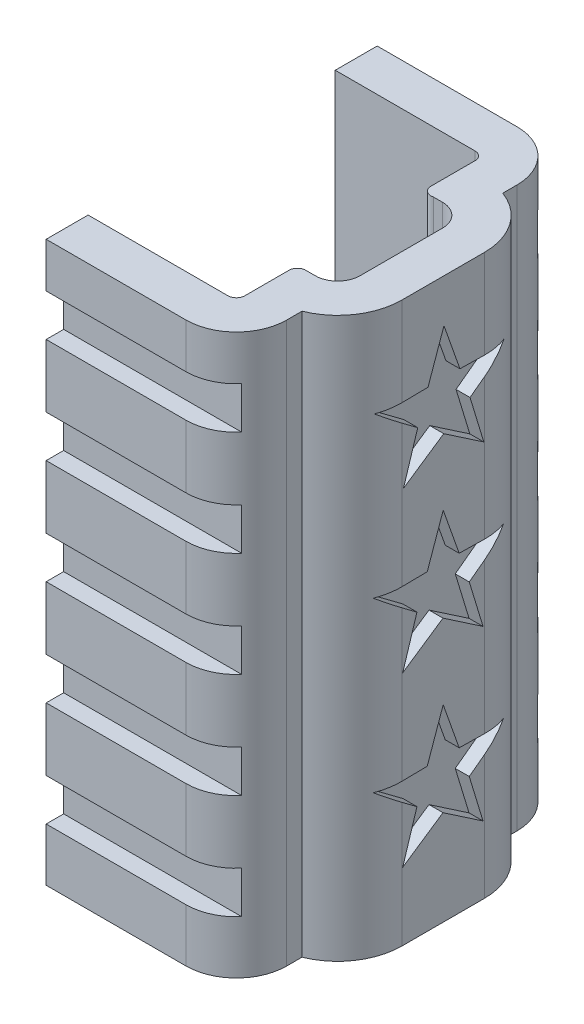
ISO-10303-21;
HEADER;
FILE_DESCRIPTION(('STEP AP214'),'2;1');
FILE_NAME('part.step','',(''),(''),'','','');
FILE_SCHEMA(('AUTOMOTIVE_DESIGN { 1 0 10303 214 1 1 1 1 }'));
ENDSEC;
DATA;
#1=APPLICATION_CONTEXT('core data for automotive mechanical design processes');
#2=APPLICATION_PROTOCOL_DEFINITION('international standard','automotive_design',2000,#1);
#3=PRODUCT_CONTEXT('',#1,'mechanical');
#4=PRODUCT('Part','Part','',(#3));
#5=PRODUCT_RELATED_PRODUCT_CATEGORY('part','',(#4));
#6=PRODUCT_DEFINITION_FORMATION('','',#4);
#7=PRODUCT_DEFINITION_CONTEXT('part definition',#1,'design');
#8=PRODUCT_DEFINITION('design','',#6,#7);
#9=PRODUCT_DEFINITION_SHAPE('','',#8);
#10=(LENGTH_UNIT() NAMED_UNIT(*) SI_UNIT(.MILLI.,.METRE.));
#11=(NAMED_UNIT(*) PLANE_ANGLE_UNIT() SI_UNIT($,.RADIAN.));
#12=(NAMED_UNIT(*) SI_UNIT($,.STERADIAN.) SOLID_ANGLE_UNIT());
#13=UNCERTAINTY_MEASURE_WITH_UNIT(LENGTH_MEASURE(1.E-05),#10,'distance_accuracy_value','');
#14=(GEOMETRIC_REPRESENTATION_CONTEXT(3) GLOBAL_UNCERTAINTY_ASSIGNED_CONTEXT((#13)) GLOBAL_UNIT_ASSIGNED_CONTEXT((#10,
#11,#12)) REPRESENTATION_CONTEXT('',''));
#15=CARTESIAN_POINT('',(0.,0.,0.));
#16=DIRECTION('',(0.,0.,1.));
#17=DIRECTION('',(1.,0.,0.));
#18=AXIS2_PLACEMENT_3D('',#15,#16,#17);
#19=CARTESIAN_POINT('',(-48.5123854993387,50.8,-3.87044349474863));
#20=DIRECTION('',(-1.,0.,0.));
#21=DIRECTION('',(0.,0.,1.));
#22=AXIS2_PLACEMENT_3D('',#19,#20,#21);
#23=PLANE('',#22);
#24=DIRECTION('',(0.,-1.,0.));
#25=VECTOR('',#24,1.);
#26=CARTESIAN_POINT('',(-48.5123854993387,50.8,-3.87044349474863));
#27=LINE('',#26,#25);
#28=CARTESIAN_POINT('',(-48.5123854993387,11.3081643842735,-3.87044349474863));
#29=VERTEX_POINT('',#28);
#30=CARTESIAN_POINT('',(-48.5123854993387,0.,-3.87044349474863));
#31=VERTEX_POINT('',#30);
#32=EDGE_CURVE('E1189',#29,#31,#27,.T.);
#33=ORIENTED_EDGE('',*,*,#32,.F.);
#34=DIRECTION('',(0.,0.596292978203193,-0.80276689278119));
#35=VECTOR('',#34,1.);
#36=CARTESIAN_POINT('',(-48.5123854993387,12.9079499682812,-6.0241748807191));
#37=LINE('',#36,#35);
#38=CARTESIAN_POINT('',(-48.5123854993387,10.2782484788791,-2.48390630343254));
#39=VERTEX_POINT('',#38);
#40=EDGE_CURVE('E48',#39,#29,#37,.T.);
#41=ORIENTED_EDGE('',*,*,#40,.F.);
#42=DIRECTION('',(0.,0.956889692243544,0.290451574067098));
#43=VECTOR('',#42,1.);
#44=CARTESIAN_POINT('',(-48.5123854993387,10.2782484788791,-2.48390630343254));
#45=LINE('',#44,#43);
#46=CARTESIAN_POINT('',(-48.5123854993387,6.15267419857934,-3.73617137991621));
#47=VERTEX_POINT('',#46);
#48=EDGE_CURVE('E714',#47,#39,#45,.T.);
#49=ORIENTED_EDGE('',*,*,#48,.F.);
#50=DIRECTION('',(0.,-0.561818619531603,-0.827260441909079));
#51=VECTOR('',#50,1.);
#52=CARTESIAN_POINT('',(-48.5123854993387,6.15267419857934,-3.73617137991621));
#53=LINE('',#52,#51);
#54=CARTESIAN_POINT('',(-48.5123854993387,8.62366169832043,-0.0977191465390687));
#55=VERTEX_POINT('',#54);
#56=EDGE_CURVE('E711',#55,#47,#53,.T.);
#57=ORIENTED_EDGE('',*,*,#56,.F.);
#58=DIRECTION('',(0.,0.559989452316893,-0.82849973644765));
#59=VECTOR('',#58,1.);
#60=CARTESIAN_POINT('',(-48.5123854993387,8.62366169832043,-0.0977191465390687));
#61=LINE('',#60,#59);
#62=CARTESIAN_POINT('',(-48.5123854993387,6.15267419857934,3.55808630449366));
#63=VERTEX_POINT('',#62);
#64=EDGE_CURVE('E708',#63,#55,#61,.T.);
#65=ORIENTED_EDGE('',*,*,#64,.F.);
#66=DIRECTION('',(0.,-0.954084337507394,0.299538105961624));
#67=VECTOR('',#66,1.);
#68=CARTESIAN_POINT('',(-48.5123854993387,6.15267419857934,3.55808630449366));
#69=LINE('',#68,#67);
#70=CARTESIAN_POINT('',(-48.5123854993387,10.2782484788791,2.26284786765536));
#71=VERTEX_POINT('',#70);
#72=EDGE_CURVE('E705',#71,#63,#69,.T.);
#73=ORIENTED_EDGE('',*,*,#72,.F.);
#74=DIRECTION('',(0.,-0.598815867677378,-0.800886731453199));
#75=VECTOR('',#74,1.);
#76=CARTESIAN_POINT('',(-48.5123854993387,10.2782484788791,2.26284786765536));
#77=LINE('',#76,#75);
#78=CARTESIAN_POINT('',(-48.5123854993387,11.2948905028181,3.62255650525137));
#79=VERTEX_POINT('',#78);
#80=EDGE_CURVE('E703',#79,#71,#77,.T.);
#81=ORIENTED_EDGE('',*,*,#80,.F.);
#82=DIRECTION('',(0.,-1.,0.));
#83=VECTOR('',#82,1.);
#84=CARTESIAN_POINT('',(-48.5123854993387,50.8,3.62255650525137));
#85=LINE('',#84,#83);
#86=CARTESIAN_POINT('',(-48.5123854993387,0.,3.62255650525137));
#87=VERTEX_POINT('',#86);
#88=EDGE_CURVE('E1193',#79,#87,#85,.T.);
#89=ORIENTED_EDGE('',*,*,#88,.T.);
#90=DIRECTION('',(0.,0.,-1.));
#91=VECTOR('',#90,1.);
#92=CARTESIAN_POINT('',(-48.5123854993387,0.,-3.87044349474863));
#93=LINE('',#92,#91);
#94=EDGE_CURVE('E1162',#87,#31,#93,.T.);
#95=ORIENTED_EDGE('',*,*,#94,.T.);
#96=EDGE_LOOP('',(#33,#41,#49,#57,#65,#73,#81,#89,#95));
#97=FACE_BOUND('',#96,.T.);
#98=ADVANCED_FACE('F33',(#97),#23,.F.);
#99=DIRECTION('',(0.,0.942960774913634,0.332903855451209));
#100=VECTOR('',#99,1.);
#101=CARTESIAN_POINT('',(-48.5123854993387,17.1027884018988,-0.117942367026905));
#102=LINE('',#101,#100);
#103=CARTESIAN_POINT('',(-48.5123854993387,12.9893508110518,-1.57015466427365));
#104=VERTEX_POINT('',#103);
#105=CARTESIAN_POINT('',(-48.5123854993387,17.1027884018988,-0.117942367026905));
#106=VERTEX_POINT('',#105);
#107=EDGE_CURVE('E675',#104,#106,#102,.T.);
#108=ORIENTED_EDGE('',*,*,#107,.F.);
#109=DIRECTION('',(0.,0.0182727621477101,0.999833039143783));
#110=VECTOR('',#109,1.);
#111=CARTESIAN_POINT('',(-48.5123854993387,12.9893508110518,-1.57015466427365));
#112=LINE('',#111,#110);
#113=CARTESIAN_POINT('',(-48.5123854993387,12.9473111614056,-3.87044349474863));
#114=VERTEX_POINT('',#113);
#115=EDGE_CURVE('E678',#114,#104,#112,.T.);
#116=ORIENTED_EDGE('',*,*,#115,.F.);
#117=CARTESIAN_POINT('',(-48.5123854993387,26.6033346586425,-3.87044349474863));
#118=VERTEX_POINT('',#117);
#119=EDGE_CURVE('E1416',#118,#114,#27,.T.);
#120=ORIENTED_EDGE('',*,*,#119,.F.);
#121=DIRECTION('',(0.,0.596292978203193,-0.80276689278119));
#122=VECTOR('',#121,1.);
#123=CARTESIAN_POINT('',(-48.5123854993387,28.2043781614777,-6.02586836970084));
#124=LINE('',#123,#122);
#125=CARTESIAN_POINT('',(-48.5123854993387,25.5746766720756,-2.48559979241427));
#126=VERTEX_POINT('',#125);
#127=EDGE_CURVE('E56',#126,#118,#124,.T.);
#128=ORIENTED_EDGE('',*,*,#127,.F.);
#129=DIRECTION('',(0.,0.956889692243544,0.290451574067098));
#130=VECTOR('',#129,1.);
#131=CARTESIAN_POINT('',(-48.5123854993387,25.5746766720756,-2.48559979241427));
#132=LINE('',#131,#130);
#133=CARTESIAN_POINT('',(-48.5123854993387,21.4491023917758,-3.73786486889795));
#134=VERTEX_POINT('',#133);
#135=EDGE_CURVE('E787',#134,#126,#132,.T.);
#136=ORIENTED_EDGE('',*,*,#135,.F.);
#137=DIRECTION('',(0.,-0.561818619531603,-0.827260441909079));
#138=VECTOR('',#137,1.);
#139=CARTESIAN_POINT('',(-48.5123854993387,21.4491023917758,-3.73786486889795));
#140=LINE('',#139,#138);
#141=CARTESIAN_POINT('',(-48.5123854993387,23.9200898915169,-0.0994126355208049));
#142=VERTEX_POINT('',#141);
#143=EDGE_CURVE('E784',#142,#134,#140,.T.);
#144=ORIENTED_EDGE('',*,*,#143,.F.);
#145=DIRECTION('',(0.,0.559989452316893,-0.82849973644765));
#146=VECTOR('',#145,1.);
#147=CARTESIAN_POINT('',(-48.5123854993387,23.9200898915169,-0.0994126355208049));
#148=LINE('',#147,#146);
#149=CARTESIAN_POINT('',(-48.5123854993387,21.4491023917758,3.55639281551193));
#150=VERTEX_POINT('',#149);
#151=EDGE_CURVE('E781',#150,#142,#148,.T.);
#152=ORIENTED_EDGE('',*,*,#151,.F.);
#153=DIRECTION('',(0.,-0.954084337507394,0.299538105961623));
#154=VECTOR('',#153,1.);
#155=CARTESIAN_POINT('',(-48.5123854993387,21.4491023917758,3.55639281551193));
#156=LINE('',#155,#154);
#157=CARTESIAN_POINT('',(-48.5123854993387,25.5746766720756,2.26115437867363));
#158=VERTEX_POINT('',#157);
#159=EDGE_CURVE('E778',#158,#150,#156,.T.);
#160=ORIENTED_EDGE('',*,*,#159,.F.);
#161=DIRECTION('',(0.,-0.598815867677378,-0.800886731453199));
#162=VECTOR('',#161,1.);
#163=CARTESIAN_POINT('',(-48.5123854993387,25.5746766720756,2.26115437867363));
#164=LINE('',#163,#162);
#165=CARTESIAN_POINT('',(-48.5123854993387,26.5925849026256,3.62255650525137));
#166=VERTEX_POINT('',#165);
#167=EDGE_CURVE('E776',#166,#158,#164,.T.);
#168=ORIENTED_EDGE('',*,*,#167,.F.);
#169=CARTESIAN_POINT('',(-48.5123854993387,12.9575224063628,3.62255650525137));
#170=VERTEX_POINT('',#169);
#171=EDGE_CURVE('E1354',#166,#170,#85,.T.);
#172=ORIENTED_EDGE('',*,*,#171,.T.);
#173=DIRECTION('',(0.,-0.0138890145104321,0.999903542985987));
#174=VECTOR('',#173,1.);
#175=CARTESIAN_POINT('',(-48.5123854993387,12.9271979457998,5.80568731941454));
#176=LINE('',#175,#174);
#177=CARTESIAN_POINT('',(-48.5123854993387,12.9893508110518,1.33115313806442));
#178=VERTEX_POINT('',#177);
#179=EDGE_CURVE('E701',#178,#170,#176,.T.);
#180=ORIENTED_EDGE('',*,*,#179,.F.);
#181=DIRECTION('',(0.,-0.943184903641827,0.332268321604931));
#182=VECTOR('',#181,1.);
#183=CARTESIAN_POINT('',(-48.5123854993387,12.9893508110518,1.33115313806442));
#184=LINE('',#183,#182);
#185=EDGE_CURVE('E657',#106,#178,#184,.T.);
#186=ORIENTED_EDGE('',*,*,#185,.F.);
#187=EDGE_LOOP('',(#108,#116,#120,#128,#136,#144,#152,#160,#168,#172,#180,#186));
#188=FACE_BOUND('',#187,.T.);
#189=ADVANCED_FACE('F1358',(#188),#23,.F.);
#190=DIRECTION('',(0.,0.942960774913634,0.332903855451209));
#191=VECTOR('',#190,1.);
#192=CARTESIAN_POINT('',(-48.5123854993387,32.3992165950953,-0.11963585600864));
#193=LINE('',#192,#191);
#194=CARTESIAN_POINT('',(-48.5123854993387,28.2857790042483,-1.57184815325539));
#195=VERTEX_POINT('',#194);
#196=CARTESIAN_POINT('',(-48.5123854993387,32.3992165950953,-0.11963585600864));
#197=VERTEX_POINT('',#196);
#198=EDGE_CURVE('E744',#195,#197,#193,.T.);
#199=ORIENTED_EDGE('',*,*,#198,.F.);
#200=DIRECTION('',(0.,0.0182727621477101,0.999833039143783));
#201=VECTOR('',#200,1.);
#202=CARTESIAN_POINT('',(-48.5123854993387,28.2857790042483,-1.57184815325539));
#203=LINE('',#202,#201);
#204=CARTESIAN_POINT('',(-48.5123854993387,28.2437703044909,-3.87044349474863));
#205=VERTEX_POINT('',#204);
#206=EDGE_CURVE('E791',#205,#195,#203,.T.);
#207=ORIENTED_EDGE('',*,*,#206,.F.);
#208=CARTESIAN_POINT('',(-48.5123854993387,41.0234947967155,-3.87044349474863));
#209=VERTEX_POINT('',#208);
#210=EDGE_CURVE('E1194',#209,#205,#27,.T.);
#211=ORIENTED_EDGE('',*,*,#210,.F.);
#212=DIRECTION('',(0.,0.596292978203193,-0.80276689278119));
#213=VECTOR('',#212,1.);
#214=CARTESIAN_POINT('',(-48.5123854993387,42.6759237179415,-6.09504663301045));
#215=LINE('',#214,#213);
#216=CARTESIAN_POINT('',(-48.5123854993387,40.0462222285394,-2.55477805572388));
#217=VERTEX_POINT('',#216);
#218=EDGE_CURVE('E869',#217,#209,#215,.T.);
#219=ORIENTED_EDGE('',*,*,#218,.F.);
#220=DIRECTION('',(0.,0.956889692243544,0.290451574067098));
#221=VECTOR('',#220,1.);
#222=CARTESIAN_POINT('',(-48.5123854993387,40.0462222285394,-2.55477805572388));
#223=LINE('',#222,#221);
#224=CARTESIAN_POINT('',(-48.5123854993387,35.9206479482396,-3.80704313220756));
#225=VERTEX_POINT('',#224);
#226=EDGE_CURVE('E866',#225,#217,#223,.T.);
#227=ORIENTED_EDGE('',*,*,#226,.F.);
#228=DIRECTION('',(0.,-0.561818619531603,-0.827260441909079));
#229=VECTOR('',#228,1.);
#230=CARTESIAN_POINT('',(-48.5123854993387,35.9206479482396,-3.80704313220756));
#231=LINE('',#230,#229);
#232=CARTESIAN_POINT('',(-48.5123854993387,38.3916354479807,-0.168590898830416));
#233=VERTEX_POINT('',#232);
#234=EDGE_CURVE('E863',#233,#225,#231,.T.);
#235=ORIENTED_EDGE('',*,*,#234,.F.);
#236=DIRECTION('',(0.,0.559989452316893,-0.82849973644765));
#237=VECTOR('',#236,1.);
#238=CARTESIAN_POINT('',(-48.5123854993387,38.3916354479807,-0.168590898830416));
#239=LINE('',#238,#237);
#240=CARTESIAN_POINT('',(-48.5123854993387,35.9206479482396,3.48721455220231));
#241=VERTEX_POINT('',#240);
#242=EDGE_CURVE('E860',#241,#233,#239,.T.);
#243=ORIENTED_EDGE('',*,*,#242,.F.);
#244=DIRECTION('',(0.,-0.954084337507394,0.299538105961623));
#245=VECTOR('',#244,1.);
#246=CARTESIAN_POINT('',(-48.5123854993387,35.9206479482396,3.48721455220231));
#247=LINE('',#246,#245);
#248=CARTESIAN_POINT('',(-48.5123854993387,40.0462222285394,2.19197611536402));
#249=VERTEX_POINT('',#248);
#250=EDGE_CURVE('E857',#249,#241,#247,.T.);
#251=ORIENTED_EDGE('',*,*,#250,.F.);
#252=DIRECTION('',(0.,-0.598815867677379,-0.800886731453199));
#253=VECTOR('',#252,1.);
#254=CARTESIAN_POINT('',(-48.5123854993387,40.0462222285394,2.19197611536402));
#255=LINE('',#254,#253);
#256=CARTESIAN_POINT('',(-48.5123854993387,41.11585442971,3.62255650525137));
#257=VERTEX_POINT('',#256);
#258=EDGE_CURVE('E855',#257,#249,#255,.T.);
#259=ORIENTED_EDGE('',*,*,#258,.F.);
#260=CARTESIAN_POINT('',(-48.5123854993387,28.2539270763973,3.62255650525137));
#261=VERTEX_POINT('',#260);
#262=EDGE_CURVE('E1199',#257,#261,#85,.T.);
#263=ORIENTED_EDGE('',*,*,#262,.T.);
#264=DIRECTION('',(0.,-0.0138890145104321,0.999903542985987));
#265=VECTOR('',#264,1.);
#266=CARTESIAN_POINT('',(-48.5123854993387,28.2236261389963,5.8039938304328));
#267=LINE('',#266,#265);
#268=CARTESIAN_POINT('',(-48.5123854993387,28.2857790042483,1.32945964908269));
#269=VERTEX_POINT('',#268);
#270=EDGE_CURVE('E774',#269,#261,#267,.T.);
#271=ORIENTED_EDGE('',*,*,#270,.F.);
#272=DIRECTION('',(0.,-0.943184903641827,0.332268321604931));
#273=VECTOR('',#272,1.);
#274=CARTESIAN_POINT('',(-48.5123854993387,28.2857790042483,1.32945964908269));
#275=LINE('',#274,#273);
#276=EDGE_CURVE('E721',#197,#269,#275,.T.);
#277=ORIENTED_EDGE('',*,*,#276,.F.);
#278=EDGE_LOOP('',(#199,#207,#211,#219,#227,#235,#243,#251,#259,#263,#271,#277));
#279=FACE_BOUND('',#278,.T.);
#280=ADVANCED_FACE('F1414',(#279),#23,.F.);
#281=CARTESIAN_POINT('',(-69.6090211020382,50.8,-15.2233028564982));
#282=DIRECTION('',(1.,0.,0.));
#283=DIRECTION('',(0.,0.,-1.));
#284=AXIS2_PLACEMENT_3D('',#281,#282,#283);
#285=PLANE('',#284);
#286=DIRECTION('',(0.,0.,1.));
#287=VECTOR('',#286,1.);
#288=CARTESIAN_POINT('',(-69.6090211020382,4.82137083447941,-15.2233028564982));
#289=LINE('',#288,#287);
#290=CARTESIAN_POINT('',(-69.6090211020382,4.82137083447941,-15.2233028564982));
#291=VERTEX_POINT('',#290);
#292=CARTESIAN_POINT('',(-69.6090211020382,4.82137083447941,-13.6358028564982));
#293=VERTEX_POINT('',#292);
#294=EDGE_CURVE('E916',#291,#293,#289,.T.);
#295=ORIENTED_EDGE('',*,*,#294,.F.);
#296=DIRECTION('',(0.,-1.,0.));
#297=VECTOR('',#296,1.);
#298=CARTESIAN_POINT('',(-69.6090211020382,50.8,-15.2233028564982));
#299=LINE('',#298,#297);
#300=CARTESIAN_POINT('',(-69.6090211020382,0.,-15.2233028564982));
#301=VERTEX_POINT('',#300);
#302=EDGE_CURVE('E1120',#291,#301,#299,.T.);
#303=ORIENTED_EDGE('',*,*,#302,.T.);
#304=DIRECTION('',(0.,0.,1.));
#305=VECTOR('',#304,1.);
#306=CARTESIAN_POINT('',(-69.6090211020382,0.,-15.2233028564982));
#307=LINE('',#306,#305);
#308=CARTESIAN_POINT('',(-69.6090211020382,0.,-11.4133028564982));
#309=VERTEX_POINT('',#308);
#310=EDGE_CURVE('E1069',#301,#309,#307,.T.);
#311=ORIENTED_EDGE('',*,*,#310,.T.);
#312=DIRECTION('',(0.,-1.,0.));
#313=VECTOR('',#312,1.);
#314=CARTESIAN_POINT('',(-69.6090211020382,50.8,-11.4133028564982));
#315=LINE('',#314,#313);
#316=CARTESIAN_POINT('',(-69.6090211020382,50.8,-11.4133028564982));
#317=VERTEX_POINT('',#316);
#318=EDGE_CURVE('E1254',#317,#309,#315,.T.);
#319=ORIENTED_EDGE('',*,*,#318,.F.);
#320=DIRECTION('',(0.,0.,1.));
#321=VECTOR('',#320,1.);
#322=CARTESIAN_POINT('',(-69.6090211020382,50.8,-15.2233028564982));
#323=LINE('',#322,#321);
#324=CARTESIAN_POINT('',(-69.6090211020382,50.8,-15.2233028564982));
#325=VERTEX_POINT('',#324);
#326=EDGE_CURVE('E1070',#325,#317,#323,.T.);
#327=ORIENTED_EDGE('',*,*,#326,.F.);
#328=CARTESIAN_POINT('',(-69.6090211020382,46.7313708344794,-15.2233028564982));
#329=VERTEX_POINT('',#328);
#330=EDGE_CURVE('E1174',#325,#329,#299,.T.);
#331=ORIENTED_EDGE('',*,*,#330,.T.);
#332=DIRECTION('',(0.,0.,-1.));
#333=VECTOR('',#332,1.);
#334=CARTESIAN_POINT('',(-69.6090211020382,46.7313708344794,-15.2233028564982));
#335=LINE('',#334,#333);
#336=CARTESIAN_POINT('',(-69.6090211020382,46.7313708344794,-13.6358028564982));
#337=VERTEX_POINT('',#336);
#338=EDGE_CURVE('E976',#337,#329,#335,.T.);
#339=ORIENTED_EDGE('',*,*,#338,.F.);
#340=DIRECTION('',(0.,1.,0.));
#341=VECTOR('',#340,1.);
#342=CARTESIAN_POINT('',(-69.6090211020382,50.8,-13.6358028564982));
#343=LINE('',#342,#341);
#344=CARTESIAN_POINT('',(-69.6090211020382,42.9213708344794,-13.6358028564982));
#345=VERTEX_POINT('',#344);
#346=EDGE_CURVE('E982',#345,#337,#343,.T.);
#347=ORIENTED_EDGE('',*,*,#346,.F.);
#348=DIRECTION('',(0.,0.,1.));
#349=VECTOR('',#348,1.);
#350=CARTESIAN_POINT('',(-69.6090211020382,42.9213708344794,-15.2233028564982));
#351=LINE('',#350,#349);
#352=CARTESIAN_POINT('',(-69.6090211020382,42.9213708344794,-15.2233028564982));
#353=VERTEX_POINT('',#352);
#354=EDGE_CURVE('E980',#353,#345,#351,.T.);
#355=ORIENTED_EDGE('',*,*,#354,.F.);
#356=CARTESIAN_POINT('',(-69.6090211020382,37.2063708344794,-15.2233028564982));
#357=VERTEX_POINT('',#356);
#358=EDGE_CURVE('E1178',#353,#357,#299,.T.);
#359=ORIENTED_EDGE('',*,*,#358,.T.);
#360=DIRECTION('',(0.,0.,-1.));
#361=VECTOR('',#360,1.);
#362=CARTESIAN_POINT('',(-69.6090211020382,37.2063708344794,-15.2233028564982));
#363=LINE('',#362,#361);
#364=CARTESIAN_POINT('',(-69.6090211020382,37.2063708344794,-13.6358028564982));
#365=VERTEX_POINT('',#364);
#366=EDGE_CURVE('E960',#365,#357,#363,.T.);
#367=ORIENTED_EDGE('',*,*,#366,.F.);
#368=DIRECTION('',(0.,1.,0.));
#369=VECTOR('',#368,1.);
#370=CARTESIAN_POINT('',(-69.6090211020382,50.8,-13.6358028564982));
#371=LINE('',#370,#369);
#372=CARTESIAN_POINT('',(-69.6090211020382,33.3963708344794,-13.6358028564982));
#373=VERTEX_POINT('',#372);
#374=EDGE_CURVE('E966',#373,#365,#371,.T.);
#375=ORIENTED_EDGE('',*,*,#374,.F.);
#376=DIRECTION('',(0.,0.,1.));
#377=VECTOR('',#376,1.);
#378=CARTESIAN_POINT('',(-69.6090211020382,33.3963708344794,-15.2233028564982));
#379=LINE('',#378,#377);
#380=CARTESIAN_POINT('',(-69.6090211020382,33.3963708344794,-15.2233028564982));
#381=VERTEX_POINT('',#380);
#382=EDGE_CURVE('E964',#381,#373,#379,.T.);
#383=ORIENTED_EDGE('',*,*,#382,.F.);
#384=CARTESIAN_POINT('',(-69.6090211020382,27.6813708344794,-15.2233028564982));
#385=VERTEX_POINT('',#384);
#386=EDGE_CURVE('E1480',#381,#385,#299,.T.);
#387=ORIENTED_EDGE('',*,*,#386,.T.);
#388=DIRECTION('',(0.,0.,-1.));
#389=VECTOR('',#388,1.);
#390=CARTESIAN_POINT('',(-69.6090211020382,27.6813708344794,-15.2233028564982));
#391=LINE('',#390,#389);
#392=CARTESIAN_POINT('',(-69.6090211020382,27.6813708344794,-13.6358028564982));
#393=VERTEX_POINT('',#392);
#394=EDGE_CURVE('E944',#393,#385,#391,.T.);
#395=ORIENTED_EDGE('',*,*,#394,.F.);
#396=DIRECTION('',(0.,1.,0.));
#397=VECTOR('',#396,1.);
#398=CARTESIAN_POINT('',(-69.6090211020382,50.8,-13.6358028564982));
#399=LINE('',#398,#397);
#400=CARTESIAN_POINT('',(-69.6090211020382,23.8713708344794,-13.6358028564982));
#401=VERTEX_POINT('',#400);
#402=EDGE_CURVE('E950',#401,#393,#399,.T.);
#403=ORIENTED_EDGE('',*,*,#402,.F.);
#404=DIRECTION('',(0.,0.,1.));
#405=VECTOR('',#404,1.);
#406=CARTESIAN_POINT('',(-69.6090211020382,23.8713708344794,-15.2233028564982));
#407=LINE('',#406,#405);
#408=CARTESIAN_POINT('',(-69.6090211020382,23.8713708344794,-15.2233028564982));
#409=VERTEX_POINT('',#408);
#410=EDGE_CURVE('E948',#409,#401,#407,.T.);
#411=ORIENTED_EDGE('',*,*,#410,.F.);
#412=CARTESIAN_POINT('',(-69.6090211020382,18.1563708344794,-15.2233028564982));
#413=VERTEX_POINT('',#412);
#414=EDGE_CURVE('E1476',#409,#413,#299,.T.);
#415=ORIENTED_EDGE('',*,*,#414,.T.);
#416=DIRECTION('',(0.,0.,-1.));
#417=VECTOR('',#416,1.);
#418=CARTESIAN_POINT('',(-69.6090211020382,18.1563708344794,-15.2233028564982));
#419=LINE('',#418,#417);
#420=CARTESIAN_POINT('',(-69.6090211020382,18.1563708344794,-13.6358028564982));
#421=VERTEX_POINT('',#420);
#422=EDGE_CURVE('E928',#421,#413,#419,.T.);
#423=ORIENTED_EDGE('',*,*,#422,.F.);
#424=DIRECTION('',(0.,1.,0.));
#425=VECTOR('',#424,1.);
#426=CARTESIAN_POINT('',(-69.6090211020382,50.8,-13.6358028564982));
#427=LINE('',#426,#425);
#428=CARTESIAN_POINT('',(-69.6090211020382,14.3463708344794,-13.6358028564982));
#429=VERTEX_POINT('',#428);
#430=EDGE_CURVE('E934',#429,#421,#427,.T.);
#431=ORIENTED_EDGE('',*,*,#430,.F.);
#432=DIRECTION('',(0.,0.,1.));
#433=VECTOR('',#432,1.);
#434=CARTESIAN_POINT('',(-69.6090211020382,14.3463708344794,-15.2233028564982));
#435=LINE('',#434,#433);
#436=CARTESIAN_POINT('',(-69.6090211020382,14.3463708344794,-15.2233028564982));
#437=VERTEX_POINT('',#436);
#438=EDGE_CURVE('E932',#437,#429,#435,.T.);
#439=ORIENTED_EDGE('',*,*,#438,.F.);
#440=CARTESIAN_POINT('',(-69.6090211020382,8.6313708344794,-15.2233028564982));
#441=VERTEX_POINT('',#440);
#442=EDGE_CURVE('E1474',#437,#441,#299,.T.);
#443=ORIENTED_EDGE('',*,*,#442,.T.);
#444=DIRECTION('',(0.,0.,-1.));
#445=VECTOR('',#444,1.);
#446=CARTESIAN_POINT('',(-69.6090211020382,8.6313708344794,-15.2233028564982));
#447=LINE('',#446,#445);
#448=CARTESIAN_POINT('',(-69.6090211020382,8.6313708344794,-13.6358028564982));
#449=VERTEX_POINT('',#448);
#450=EDGE_CURVE('E912',#449,#441,#447,.T.);
#451=ORIENTED_EDGE('',*,*,#450,.F.);
#452=DIRECTION('',(0.,1.,0.));
#453=VECTOR('',#452,1.);
#454=CARTESIAN_POINT('',(-69.6090211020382,50.8,-13.6358028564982));
#455=LINE('',#454,#453);
#456=EDGE_CURVE('E918',#293,#449,#455,.T.);
#457=ORIENTED_EDGE('',*,*,#456,.F.);
#458=EDGE_LOOP('',(#295,#303,#311,#319,#327,#331,#339,#347,#355,#359,#367,#375,#383,#387,#395,
#403,#411,#415,#423,#431,#439,#443,#451,#457));
#459=FACE_BOUND('',#458,.T.);
#460=ADVANCED_FACE('F35',(#459),#285,.F.);
#461=CARTESIAN_POINT('',(-56.9090211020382,50.8,-10.6513028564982));
#462=DIRECTION('',(0.,-1.,0.));
#463=DIRECTION('',(0.,0.,-1.));
#464=AXIS2_PLACEMENT_3D('',#461,#462,#463);
#465=CYLINDRICAL_SURFACE('',#464,4.572);
#466=CARTESIAN_POINT('',(-56.9090211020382,4.82137083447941,-10.6513028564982));
#467=DIRECTION('',(0.,1.,0.));
#468=DIRECTION('',(0.,0.,1.));
#469=AXIS2_PLACEMENT_3D('',#466,#467,#468);
#470=CIRCLE('',#469,4.572);
#471=CARTESIAN_POINT('',(-53.4455050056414,4.82137083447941,-13.6358028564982));
#472=VERTEX_POINT('',#471);
#473=CARTESIAN_POINT('',(-56.9090211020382,4.82137083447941,-15.2233028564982));
#474=VERTEX_POINT('',#473);
#475=EDGE_CURVE('E914',#472,#474,#470,.T.);
#476=ORIENTED_EDGE('',*,*,#475,.F.);
#477=DIRECTION('',(0.,-1.,0.));
#478=VECTOR('',#477,1.);
#479=CARTESIAN_POINT('',(-53.4455050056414,50.8,-13.6358028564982));
#480=LINE('',#479,#478);
#481=CARTESIAN_POINT('',(-53.4455050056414,8.6313708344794,-13.6358028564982));
#482=VERTEX_POINT('',#481);
#483=EDGE_CURVE('E1325',#482,#472,#480,.T.);
#484=ORIENTED_EDGE('',*,*,#483,.F.);
#485=CARTESIAN_POINT('',(-56.9090211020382,8.6313708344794,-10.6513028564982));
#486=DIRECTION('',(0.,-1.,0.));
#487=DIRECTION('',(0.,0.,-1.));
#488=AXIS2_PLACEMENT_3D('',#485,#486,#487);
#489=CIRCLE('',#488,4.572);
#490=CARTESIAN_POINT('',(-56.9090211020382,8.6313708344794,-15.2233028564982));
#491=VERTEX_POINT('',#490);
#492=EDGE_CURVE('E910',#491,#482,#489,.T.);
#493=ORIENTED_EDGE('',*,*,#492,.F.);
#494=DIRECTION('',(0.,-1.,0.));
#495=VECTOR('',#494,1.);
#496=CARTESIAN_POINT('',(-56.9090211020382,50.8,-15.2233028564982));
#497=LINE('',#496,#495);
#498=CARTESIAN_POINT('',(-56.9090211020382,14.3463708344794,-15.2233028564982));
#499=VERTEX_POINT('',#498);
#500=EDGE_CURVE('E1557',#499,#491,#497,.T.);
#501=ORIENTED_EDGE('',*,*,#500,.F.);
#502=CARTESIAN_POINT('',(-56.9090211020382,14.3463708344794,-10.6513028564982));
#503=DIRECTION('',(0.,1.,0.));
#504=DIRECTION('',(0.,0.,1.));
#505=AXIS2_PLACEMENT_3D('',#502,#503,#504);
#506=CIRCLE('',#505,4.572);
#507=CARTESIAN_POINT('',(-53.4455050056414,14.3463708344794,-13.6358028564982));
#508=VERTEX_POINT('',#507);
#509=EDGE_CURVE('E930',#508,#499,#506,.T.);
#510=ORIENTED_EDGE('',*,*,#509,.F.);
#511=DIRECTION('',(0.,-1.,0.));
#512=VECTOR('',#511,1.);
#513=CARTESIAN_POINT('',(-53.4455050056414,50.8,-13.6358028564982));
#514=LINE('',#513,#512);
#515=CARTESIAN_POINT('',(-53.4455050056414,18.1563708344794,-13.6358028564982));
#516=VERTEX_POINT('',#515);
#517=EDGE_CURVE('E1319',#516,#508,#514,.T.);
#518=ORIENTED_EDGE('',*,*,#517,.F.);
#519=CARTESIAN_POINT('',(-56.9090211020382,18.1563708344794,-10.6513028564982));
#520=DIRECTION('',(0.,-1.,0.));
#521=DIRECTION('',(0.,0.,-1.));
#522=AXIS2_PLACEMENT_3D('',#519,#520,#521);
#523=CIRCLE('',#522,4.572);
#524=CARTESIAN_POINT('',(-56.9090211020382,18.1563708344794,-15.2233028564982));
#525=VERTEX_POINT('',#524);
#526=EDGE_CURVE('E926',#525,#516,#523,.T.);
#527=ORIENTED_EDGE('',*,*,#526,.F.);
#528=CARTESIAN_POINT('',(-56.9090211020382,23.8713708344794,-15.2233028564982));
#529=VERTEX_POINT('',#528);
#530=EDGE_CURVE('E1538',#529,#525,#497,.T.);
#531=ORIENTED_EDGE('',*,*,#530,.F.);
#532=CARTESIAN_POINT('',(-56.9090211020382,23.8713708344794,-10.6513028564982));
#533=DIRECTION('',(0.,1.,0.));
#534=DIRECTION('',(0.,0.,1.));
#535=AXIS2_PLACEMENT_3D('',#532,#533,#534);
#536=CIRCLE('',#535,4.572);
#537=CARTESIAN_POINT('',(-53.4455050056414,23.8713708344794,-13.6358028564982));
#538=VERTEX_POINT('',#537);
#539=EDGE_CURVE('E946',#538,#529,#536,.T.);
#540=ORIENTED_EDGE('',*,*,#539,.F.);
#541=DIRECTION('',(0.,-1.,0.));
#542=VECTOR('',#541,1.);
#543=CARTESIAN_POINT('',(-53.4455050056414,50.8,-13.6358028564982));
#544=LINE('',#543,#542);
#545=CARTESIAN_POINT('',(-53.4455050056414,27.6813708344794,-13.6358028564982));
#546=VERTEX_POINT('',#545);
#547=EDGE_CURVE('E1313',#546,#538,#544,.T.);
#548=ORIENTED_EDGE('',*,*,#547,.F.);
#549=CARTESIAN_POINT('',(-56.9090211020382,27.6813708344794,-10.6513028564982));
#550=DIRECTION('',(0.,-1.,0.));
#551=DIRECTION('',(0.,0.,-1.));
#552=AXIS2_PLACEMENT_3D('',#549,#550,#551);
#553=CIRCLE('',#552,4.572);
#554=CARTESIAN_POINT('',(-56.9090211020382,27.6813708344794,-15.2233028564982));
#555=VERTEX_POINT('',#554);
#556=EDGE_CURVE('E942',#555,#546,#553,.T.);
#557=ORIENTED_EDGE('',*,*,#556,.F.);
#558=CARTESIAN_POINT('',(-56.9090211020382,33.3963708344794,-15.2233028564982));
#559=VERTEX_POINT('',#558);
#560=EDGE_CURVE('E1519',#559,#555,#497,.T.);
#561=ORIENTED_EDGE('',*,*,#560,.F.);
#562=CARTESIAN_POINT('',(-56.9090211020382,33.3963708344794,-10.6513028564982));
#563=DIRECTION('',(0.,1.,0.));
#564=DIRECTION('',(-1.,0.,0.));
#565=AXIS2_PLACEMENT_3D('',#562,#563,#564);
#566=CIRCLE('',#565,4.572);
#567=CARTESIAN_POINT('',(-53.4455050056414,33.3963708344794,-13.6358028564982));
#568=VERTEX_POINT('',#567);
#569=EDGE_CURVE('E962',#568,#559,#566,.T.);
#570=ORIENTED_EDGE('',*,*,#569,.F.);
#571=DIRECTION('',(0.,-1.,0.));
#572=VECTOR('',#571,1.);
#573=CARTESIAN_POINT('',(-53.4455050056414,50.8,-13.6358028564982));
#574=LINE('',#573,#572);
#575=CARTESIAN_POINT('',(-53.4455050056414,37.2063708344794,-13.6358028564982));
#576=VERTEX_POINT('',#575);
#577=EDGE_CURVE('E1307',#576,#568,#574,.T.);
#578=ORIENTED_EDGE('',*,*,#577,.F.);
#579=CARTESIAN_POINT('',(-56.9090211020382,37.2063708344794,-10.6513028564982));
#580=DIRECTION('',(0.,-1.,0.));
#581=DIRECTION('',(1.,0.,0.));
#582=AXIS2_PLACEMENT_3D('',#579,#580,#581);
#583=CIRCLE('',#582,4.572);
#584=CARTESIAN_POINT('',(-56.9090211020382,37.2063708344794,-15.2233028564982));
#585=VERTEX_POINT('',#584);
#586=EDGE_CURVE('E958',#585,#576,#583,.T.);
#587=ORIENTED_EDGE('',*,*,#586,.F.);
#588=CARTESIAN_POINT('',(-56.9090211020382,42.9213708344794,-15.2233028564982));
#589=VERTEX_POINT('',#588);
#590=EDGE_CURVE('E1183',#589,#585,#497,.T.);
#591=ORIENTED_EDGE('',*,*,#590,.F.);
#592=CARTESIAN_POINT('',(-56.9090211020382,42.9213708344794,-10.6513028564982));
#593=DIRECTION('',(0.,1.,0.));
#594=DIRECTION('',(-1.,0.,0.));
#595=AXIS2_PLACEMENT_3D('',#592,#593,#594);
#596=CIRCLE('',#595,4.572);
#597=CARTESIAN_POINT('',(-53.4455050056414,42.9213708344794,-13.6358028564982));
#598=VERTEX_POINT('',#597);
#599=EDGE_CURVE('E978',#598,#589,#596,.T.);
#600=ORIENTED_EDGE('',*,*,#599,.F.);
#601=DIRECTION('',(0.,-1.,0.));
#602=VECTOR('',#601,1.);
#603=CARTESIAN_POINT('',(-53.4455050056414,50.8,-13.6358028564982));
#604=LINE('',#603,#602);
#605=CARTESIAN_POINT('',(-53.4455050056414,46.7313708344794,-13.6358028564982));
#606=VERTEX_POINT('',#605);
#607=EDGE_CURVE('E1301',#606,#598,#604,.T.);
#608=ORIENTED_EDGE('',*,*,#607,.F.);
#609=CARTESIAN_POINT('',(-56.9090211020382,46.7313708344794,-10.6513028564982));
#610=DIRECTION('',(0.,-1.,0.));
#611=DIRECTION('',(1.,0.,0.));
#612=AXIS2_PLACEMENT_3D('',#609,#610,#611);
#613=CIRCLE('',#612,4.572);
#614=CARTESIAN_POINT('',(-56.9090211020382,46.7313708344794,-15.2233028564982));
#615=VERTEX_POINT('',#614);
#616=EDGE_CURVE('E974',#615,#606,#613,.T.);
#617=ORIENTED_EDGE('',*,*,#616,.F.);
#618=CARTESIAN_POINT('',(-56.9090211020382,50.8,-15.2233028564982));
#619=VERTEX_POINT('',#618);
#620=EDGE_CURVE('E1179',#619,#615,#497,.T.);
#621=ORIENTED_EDGE('',*,*,#620,.F.);
#622=CARTESIAN_POINT('',(-56.9090211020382,50.8,-10.6513028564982));
#623=DIRECTION('',(0.,1.,0.));
#624=DIRECTION('',(0.,0.,-1.));
#625=AXIS2_PLACEMENT_3D('',#622,#623,#624);
#626=CIRCLE('',#625,4.572);
#627=CARTESIAN_POINT('',(-52.3370211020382,50.8,-10.6513028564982));
#628=VERTEX_POINT('',#627);
#629=EDGE_CURVE('E1116',#628,#619,#626,.T.);
#630=ORIENTED_EDGE('',*,*,#629,.F.);
#631=DIRECTION('',(0.,-1.,0.));
#632=VECTOR('',#631,1.);
#633=CARTESIAN_POINT('',(-52.3370211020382,50.8,-10.6513028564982));
#634=LINE('',#633,#632);
#635=CARTESIAN_POINT('',(-52.3370211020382,0.,-10.6513028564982));
#636=VERTEX_POINT('',#635);
#637=EDGE_CURVE('E1182',#628,#636,#634,.T.);
#638=ORIENTED_EDGE('',*,*,#637,.T.);
#639=CARTESIAN_POINT('',(-56.9090211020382,0.,-10.6513028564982));
#640=DIRECTION('',(0.,1.,0.));
#641=DIRECTION('',(0.,0.,-1.));
#642=AXIS2_PLACEMENT_3D('',#639,#640,#641);
#643=CIRCLE('',#642,4.572);
#644=CARTESIAN_POINT('',(-56.9090211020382,0.,-15.2233028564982));
#645=VERTEX_POINT('',#644);
#646=EDGE_CURVE('E1169',#636,#645,#643,.T.);
#647=ORIENTED_EDGE('',*,*,#646,.T.);
#648=EDGE_CURVE('E1177',#474,#645,#497,.T.);
#649=ORIENTED_EDGE('',*,*,#648,.F.);
#650=EDGE_LOOP('',(#476,#484,#493,#501,#510,#518,#527,#531,#540,#548,#557,#561,#570,#578,#587,
#591,#600,#608,#617,#621,#630,#638,#647,#649));
#651=FACE_BOUND('',#650,.T.);
#652=ADVANCED_FACE('F1456',(#651),#465,.T.);
#653=CARTESIAN_POINT('',(-69.6090211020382,50.8,-15.2233028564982));
#654=DIRECTION('',(0.,0.,1.));
#655=DIRECTION('',(1.,0.,0.));
#656=AXIS2_PLACEMENT_3D('',#653,#654,#655);
#657=PLANE('',#656);
#658=DIRECTION('',(-1.,0.,0.));
#659=VECTOR('',#658,1.);
#660=CARTESIAN_POINT('',(-69.6090211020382,4.82137083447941,-15.2233028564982));
#661=LINE('',#660,#659);
#662=EDGE_CURVE('E1323',#474,#291,#661,.T.);
#663=ORIENTED_EDGE('',*,*,#662,.F.);
#664=ORIENTED_EDGE('',*,*,#648,.T.);
#665=DIRECTION('',(-1.,0.,0.));
#666=VECTOR('',#665,1.);
#667=CARTESIAN_POINT('',(-69.6090211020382,0.,-15.2233028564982));
#668=LINE('',#667,#666);
#669=EDGE_CURVE('E1074',#645,#301,#668,.T.);
#670=ORIENTED_EDGE('',*,*,#669,.T.);
#671=ORIENTED_EDGE('',*,*,#302,.F.);
#672=EDGE_LOOP('',(#663,#664,#670,#671));
#673=FACE_BOUND('',#672,.T.);
#674=ADVANCED_FACE('F1461',(#673),#657,.F.);
#675=DIRECTION('',(1.,0.,0.));
#676=VECTOR('',#675,1.);
#677=CARTESIAN_POINT('',(-69.6090211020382,8.6313708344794,-15.2233028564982));
#678=LINE('',#677,#676);
#679=EDGE_CURVE('E1321',#441,#491,#678,.T.);
#680=ORIENTED_EDGE('',*,*,#679,.F.);
#681=ORIENTED_EDGE('',*,*,#442,.F.);
#682=DIRECTION('',(-1.,0.,0.));
#683=VECTOR('',#682,1.);
#684=CARTESIAN_POINT('',(-69.6090211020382,14.3463708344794,-15.2233028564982));
#685=LINE('',#684,#683);
#686=EDGE_CURVE('E1317',#499,#437,#685,.T.);
#687=ORIENTED_EDGE('',*,*,#686,.F.);
#688=ORIENTED_EDGE('',*,*,#500,.T.);
#689=EDGE_LOOP('',(#680,#681,#687,#688));
#690=FACE_BOUND('',#689,.T.);
#691=ADVANCED_FACE('F1555',(#690),#657,.F.);
#692=DIRECTION('',(1.,0.,0.));
#693=VECTOR('',#692,1.);
#694=CARTESIAN_POINT('',(-69.6090211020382,18.1563708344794,-15.2233028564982));
#695=LINE('',#694,#693);
#696=EDGE_CURVE('E1315',#413,#525,#695,.T.);
#697=ORIENTED_EDGE('',*,*,#696,.F.);
#698=ORIENTED_EDGE('',*,*,#414,.F.);
#699=DIRECTION('',(-1.,0.,0.));
#700=VECTOR('',#699,1.);
#701=CARTESIAN_POINT('',(-69.6090211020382,23.8713708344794,-15.2233028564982));
#702=LINE('',#701,#700);
#703=EDGE_CURVE('E1311',#529,#409,#702,.T.);
#704=ORIENTED_EDGE('',*,*,#703,.F.);
#705=ORIENTED_EDGE('',*,*,#530,.T.);
#706=EDGE_LOOP('',(#697,#698,#704,#705));
#707=FACE_BOUND('',#706,.T.);
#708=ADVANCED_FACE('F1536',(#707),#657,.F.);
#709=DIRECTION('',(1.,0.,0.));
#710=VECTOR('',#709,1.);
#711=CARTESIAN_POINT('',(-69.6090211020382,27.6813708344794,-15.2233028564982));
#712=LINE('',#711,#710);
#713=EDGE_CURVE('E1309',#385,#555,#712,.T.);
#714=ORIENTED_EDGE('',*,*,#713,.F.);
#715=ORIENTED_EDGE('',*,*,#386,.F.);
#716=DIRECTION('',(-1.,0.,0.));
#717=VECTOR('',#716,1.);
#718=CARTESIAN_POINT('',(-69.6090211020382,33.3963708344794,-15.2233028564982));
#719=LINE('',#718,#717);
#720=EDGE_CURVE('E1305',#559,#381,#719,.T.);
#721=ORIENTED_EDGE('',*,*,#720,.F.);
#722=ORIENTED_EDGE('',*,*,#560,.T.);
#723=EDGE_LOOP('',(#714,#715,#721,#722));
#724=FACE_BOUND('',#723,.T.);
#725=ADVANCED_FACE('F1517',(#724),#657,.F.);
#726=DIRECTION('',(1.,0.,0.));
#727=VECTOR('',#726,1.);
#728=CARTESIAN_POINT('',(-69.6090211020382,37.2063708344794,-15.2233028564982));
#729=LINE('',#728,#727);
#730=EDGE_CURVE('E1303',#357,#585,#729,.T.);
#731=ORIENTED_EDGE('',*,*,#730,.F.);
#732=ORIENTED_EDGE('',*,*,#358,.F.);
#733=DIRECTION('',(-1.,0.,0.));
#734=VECTOR('',#733,1.);
#735=CARTESIAN_POINT('',(-69.6090211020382,42.9213708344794,-15.2233028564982));
#736=LINE('',#735,#734);
#737=EDGE_CURVE('E1299',#589,#353,#736,.T.);
#738=ORIENTED_EDGE('',*,*,#737,.F.);
#739=ORIENTED_EDGE('',*,*,#590,.T.);
#740=EDGE_LOOP('',(#731,#732,#738,#739));
#741=FACE_BOUND('',#740,.T.);
#742=ADVANCED_FACE('F1497',(#741),#657,.F.);
#743=DIRECTION('',(1.,0.,0.));
#744=VECTOR('',#743,1.);
#745=CARTESIAN_POINT('',(-69.6090211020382,46.7313708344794,-15.2233028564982));
#746=LINE('',#745,#744);
#747=EDGE_CURVE('E1297',#329,#615,#746,.T.);
#748=ORIENTED_EDGE('',*,*,#747,.F.);
#749=ORIENTED_EDGE('',*,*,#330,.F.);
#750=DIRECTION('',(-1.,0.,0.));
#751=VECTOR('',#750,1.);
#752=CARTESIAN_POINT('',(-69.6090211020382,50.8,-15.2233028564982));
#753=LINE('',#752,#751);
#754=EDGE_CURVE('E1118',#619,#325,#753,.T.);
#755=ORIENTED_EDGE('',*,*,#754,.F.);
#756=ORIENTED_EDGE('',*,*,#620,.T.);
#757=EDGE_LOOP('',(#748,#749,#755,#756));
#758=FACE_BOUND('',#757,.T.);
#759=ADVANCED_FACE('F1672',(#758),#657,.F.);
#760=CARTESIAN_POINT('',(-56.7419854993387,50.8,15.0026971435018));
#761=DIRECTION('',(0.,0.,-1.));
#762=DIRECTION('',(-1.,0.,0.));
#763=AXIS2_PLACEMENT_3D('',#760,#761,#762);
#764=PLANE('',#763);
#765=DIRECTION('',(0.,-1.,0.));
#766=VECTOR('',#765,1.);
#767=CARTESIAN_POINT('',(-69.4419854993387,50.8,15.0026971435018));
#768=LINE('',#767,#766);
#769=CARTESIAN_POINT('',(-69.4419854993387,14.3463708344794,15.0026971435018));
#770=VERTEX_POINT('',#769);
#771=CARTESIAN_POINT('',(-69.4419854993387,8.6313708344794,15.0026971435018));
#772=VERTEX_POINT('',#771);
#773=EDGE_CURVE('E2193',#770,#772,#768,.T.);
#774=ORIENTED_EDGE('',*,*,#773,.T.);
#775=DIRECTION('',(-1.,0.,0.));
#776=VECTOR('',#775,1.);
#777=CARTESIAN_POINT('',(-71.7998153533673,8.6313708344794,15.0026971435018));
#778=LINE('',#777,#776);
#779=CARTESIAN_POINT('',(-56.7419854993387,8.6313708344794,15.0026971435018));
#780=VERTEX_POINT('',#779);
#781=EDGE_CURVE('E988',#780,#772,#778,.T.);
#782=ORIENTED_EDGE('',*,*,#781,.F.);
#783=DIRECTION('',(0.,-1.,0.));
#784=VECTOR('',#783,1.);
#785=CARTESIAN_POINT('',(-56.7419854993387,50.8,15.0026971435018));
#786=LINE('',#785,#784);
#787=CARTESIAN_POINT('',(-56.7419854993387,14.3463708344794,15.0026971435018));
#788=VERTEX_POINT('',#787);
#789=EDGE_CURVE('E2189',#788,#780,#786,.T.);
#790=ORIENTED_EDGE('',*,*,#789,.F.);
#791=DIRECTION('',(1.,0.,0.));
#792=VECTOR('',#791,1.);
#793=CARTESIAN_POINT('',(-71.7998153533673,14.3463708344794,15.0026971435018));
#794=LINE('',#793,#792);
#795=EDGE_CURVE('E1001',#770,#788,#794,.T.);
#796=ORIENTED_EDGE('',*,*,#795,.F.);
#797=EDGE_LOOP('',(#774,#782,#790,#796));
#798=FACE_BOUND('',#797,.T.);
#799=ADVANCED_FACE('F2272',(#798),#764,.F.);
#800=CARTESIAN_POINT('',(-69.4419854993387,23.8713708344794,15.0026971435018));
#801=VERTEX_POINT('',#800);
#802=CARTESIAN_POINT('',(-69.4419854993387,18.1563708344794,15.0026971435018));
#803=VERTEX_POINT('',#802);
#804=EDGE_CURVE('E2587',#801,#803,#768,.T.);
#805=ORIENTED_EDGE('',*,*,#804,.T.);
#806=DIRECTION('',(-1.,0.,0.));
#807=VECTOR('',#806,1.);
#808=CARTESIAN_POINT('',(-71.7998153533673,18.1563708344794,15.0026971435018));
#809=LINE('',#808,#807);
#810=CARTESIAN_POINT('',(-56.7419854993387,18.1563708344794,15.0026971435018));
#811=VERTEX_POINT('',#810);
#812=EDGE_CURVE('E1005',#811,#803,#809,.T.);
#813=ORIENTED_EDGE('',*,*,#812,.F.);
#814=CARTESIAN_POINT('',(-56.7419854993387,23.8713708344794,15.0026971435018));
#815=VERTEX_POINT('',#814);
#816=EDGE_CURVE('E2573',#815,#811,#786,.T.);
#817=ORIENTED_EDGE('',*,*,#816,.F.);
#818=DIRECTION('',(1.,0.,0.));
#819=VECTOR('',#818,1.);
#820=CARTESIAN_POINT('',(-71.7998153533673,23.8713708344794,15.0026971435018));
#821=LINE('',#820,#819);
#822=EDGE_CURVE('E1018',#801,#815,#821,.T.);
#823=ORIENTED_EDGE('',*,*,#822,.F.);
#824=EDGE_LOOP('',(#805,#813,#817,#823));
#825=FACE_BOUND('',#824,.T.);
#826=ADVANCED_FACE('F2276',(#825),#764,.F.);
#827=CARTESIAN_POINT('',(-69.4419854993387,33.3963708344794,15.0026971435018));
#828=VERTEX_POINT('',#827);
#829=CARTESIAN_POINT('',(-69.4419854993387,27.6813708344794,15.0026971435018));
#830=VERTEX_POINT('',#829);
#831=EDGE_CURVE('E2589',#828,#830,#768,.T.);
#832=ORIENTED_EDGE('',*,*,#831,.T.);
#833=DIRECTION('',(-1.,0.,0.));
#834=VECTOR('',#833,1.);
#835=CARTESIAN_POINT('',(-71.7998153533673,27.6813708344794,15.0026971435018));
#836=LINE('',#835,#834);
#837=CARTESIAN_POINT('',(-56.7419854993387,27.6813708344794,15.0026971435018));
#838=VERTEX_POINT('',#837);
#839=EDGE_CURVE('E1022',#838,#830,#836,.T.);
#840=ORIENTED_EDGE('',*,*,#839,.F.);
#841=CARTESIAN_POINT('',(-56.7419854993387,33.3963708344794,15.0026971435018));
#842=VERTEX_POINT('',#841);
#843=EDGE_CURVE('E2571',#842,#838,#786,.T.);
#844=ORIENTED_EDGE('',*,*,#843,.F.);
#845=DIRECTION('',(1.,0.,0.));
#846=VECTOR('',#845,1.);
#847=CARTESIAN_POINT('',(-71.7998153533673,33.3963708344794,15.0026971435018));
#848=LINE('',#847,#846);
#849=EDGE_CURVE('E1035',#828,#842,#848,.T.);
#850=ORIENTED_EDGE('',*,*,#849,.F.);
#851=EDGE_LOOP('',(#832,#840,#844,#850));
#852=FACE_BOUND('',#851,.T.);
#853=ADVANCED_FACE('F2390',(#852),#764,.F.);
#854=CARTESIAN_POINT('',(-69.4419854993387,42.9213708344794,15.0026971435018));
#855=VERTEX_POINT('',#854);
#856=CARTESIAN_POINT('',(-69.4419854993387,37.2063708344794,15.0026971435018));
#857=VERTEX_POINT('',#856);
#858=EDGE_CURVE('E1215',#855,#857,#768,.T.);
#859=ORIENTED_EDGE('',*,*,#858,.T.);
#860=DIRECTION('',(-1.,0.,0.));
#861=VECTOR('',#860,1.);
#862=CARTESIAN_POINT('',(-71.7998153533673,37.2063708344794,15.0026971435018));
#863=LINE('',#862,#861);
#864=CARTESIAN_POINT('',(-56.7419854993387,37.2063708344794,15.0026971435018));
#865=VERTEX_POINT('',#864);
#866=EDGE_CURVE('E1039',#865,#857,#863,.T.);
#867=ORIENTED_EDGE('',*,*,#866,.F.);
#868=CARTESIAN_POINT('',(-56.7419854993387,42.9213708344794,15.0026971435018));
#869=VERTEX_POINT('',#868);
#870=EDGE_CURVE('E1210',#869,#865,#786,.T.);
#871=ORIENTED_EDGE('',*,*,#870,.F.);
#872=DIRECTION('',(1.,0.,0.));
#873=VECTOR('',#872,1.);
#874=CARTESIAN_POINT('',(-71.7998153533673,42.9213708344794,15.0026971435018));
#875=LINE('',#874,#873);
#876=EDGE_CURVE('E1052',#855,#869,#875,.T.);
#877=ORIENTED_EDGE('',*,*,#876,.F.);
#878=EDGE_LOOP('',(#859,#867,#871,#877));
#879=FACE_BOUND('',#878,.T.);
#880=ADVANCED_FACE('F2398',(#879),#764,.F.);
#881=CARTESIAN_POINT('',(-69.4419854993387,50.8,15.0026971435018));
#882=VERTEX_POINT('',#881);
#883=CARTESIAN_POINT('',(-69.4419854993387,46.7313708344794,15.0026971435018));
#884=VERTEX_POINT('',#883);
#885=EDGE_CURVE('E1211',#882,#884,#768,.T.);
#886=ORIENTED_EDGE('',*,*,#885,.T.);
#887=DIRECTION('',(-1.,0.,0.));
#888=VECTOR('',#887,1.);
#889=CARTESIAN_POINT('',(-71.7998153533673,46.7313708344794,15.0026971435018));
#890=LINE('',#889,#888);
#891=CARTESIAN_POINT('',(-56.7419854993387,46.7313708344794,15.0026971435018));
#892=VERTEX_POINT('',#891);
#893=EDGE_CURVE('E1056',#892,#884,#890,.T.);
#894=ORIENTED_EDGE('',*,*,#893,.F.);
#895=CARTESIAN_POINT('',(-56.7419854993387,50.8,15.0026971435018));
#896=VERTEX_POINT('',#895);
#897=EDGE_CURVE('E1206',#896,#892,#786,.T.);
#898=ORIENTED_EDGE('',*,*,#897,.F.);
#899=DIRECTION('',(1.,0.,0.));
#900=VECTOR('',#899,1.);
#901=CARTESIAN_POINT('',(-56.7419854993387,50.8,15.0026971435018));
#902=LINE('',#901,#900);
#903=EDGE_CURVE('E1102',#882,#896,#902,.T.);
#904=ORIENTED_EDGE('',*,*,#903,.F.);
#905=EDGE_LOOP('',(#886,#894,#898,#904));
#906=FACE_BOUND('',#905,.T.);
#907=ADVANCED_FACE('F2406',(#906),#764,.F.);
#908=CARTESIAN_POINT('',(-69.6090211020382,50.8,-11.4133028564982));
#909=DIRECTION('',(0.,0.,-1.));
#910=DIRECTION('',(-1.,0.,0.));
#911=AXIS2_PLACEMENT_3D('',#908,#909,#910);
#912=PLANE('',#911);
#913=DIRECTION('',(1.,0.,0.));
#914=VECTOR('',#913,1.);
#915=CARTESIAN_POINT('',(-69.6090211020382,0.,-11.4133028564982));
#916=LINE('',#915,#914);
#917=CARTESIAN_POINT('',(-56.9090211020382,0.,-11.4133028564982));
#918=VERTEX_POINT('',#917);
#919=EDGE_CURVE('E1123',#309,#918,#916,.T.);
#920=ORIENTED_EDGE('',*,*,#919,.T.);
#921=DIRECTION('',(0.,-1.,0.));
#922=VECTOR('',#921,1.);
#923=CARTESIAN_POINT('',(-56.9090211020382,50.8,-11.4133028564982));
#924=LINE('',#923,#922);
#925=CARTESIAN_POINT('',(-56.9090211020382,50.8,-11.4133028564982));
#926=VERTEX_POINT('',#925);
#927=EDGE_CURVE('E1251',#926,#918,#924,.T.);
#928=ORIENTED_EDGE('',*,*,#927,.F.);
#929=DIRECTION('',(1.,0.,0.));
#930=VECTOR('',#929,1.);
#931=CARTESIAN_POINT('',(-69.6090211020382,50.8,-11.4133028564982));
#932=LINE('',#931,#930);
#933=EDGE_CURVE('E1073',#317,#926,#932,.T.);
#934=ORIENTED_EDGE('',*,*,#933,.F.);
#935=ORIENTED_EDGE('',*,*,#318,.T.);
#936=EDGE_LOOP('',(#920,#928,#934,#935));
#937=FACE_BOUND('',#936,.T.);
#938=ADVANCED_FACE('F2260',(#937),#912,.F.);
#939=CARTESIAN_POINT('',(-56.9090211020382,50.8,-10.6513028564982));
#940=DIRECTION('',(0.,-1.,0.));
#941=DIRECTION('',(0.,0.,-1.));
#942=AXIS2_PLACEMENT_3D('',#939,#940,#941);
#943=CYLINDRICAL_SURFACE('',#942,0.762000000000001);
#944=CARTESIAN_POINT('',(-56.9090211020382,0.,-10.6513028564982));
#945=DIRECTION('',(0.,-1.,0.));
#946=DIRECTION('',(0.,0.,-1.));
#947=AXIS2_PLACEMENT_3D('',#944,#945,#946);
#948=CIRCLE('',#947,0.762000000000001);
#949=CARTESIAN_POINT('',(-56.1470211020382,0.,-10.6513028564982));
#950=VERTEX_POINT('',#949);
#951=EDGE_CURVE('E1125',#918,#950,#948,.T.);
#952=ORIENTED_EDGE('',*,*,#951,.T.);
#953=DIRECTION('',(0.,-1.,0.));
#954=VECTOR('',#953,1.);
#955=CARTESIAN_POINT('',(-56.1470211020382,50.8,-10.6513028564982));
#956=LINE('',#955,#954);
#957=CARTESIAN_POINT('',(-56.1470211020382,50.8,-10.6513028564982));
#958=VERTEX_POINT('',#957);
#959=EDGE_CURVE('E1248',#958,#950,#956,.T.);
#960=ORIENTED_EDGE('',*,*,#959,.F.);
#961=CARTESIAN_POINT('',(-56.9090211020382,50.8,-10.6513028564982));
#962=DIRECTION('',(0.,-1.,0.));
#963=DIRECTION('',(0.,0.,-1.));
#964=AXIS2_PLACEMENT_3D('',#961,#962,#963);
#965=CIRCLE('',#964,0.762000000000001);
#966=EDGE_CURVE('E1076',#926,#958,#965,.T.);
#967=ORIENTED_EDGE('',*,*,#966,.F.);
#968=ORIENTED_EDGE('',*,*,#927,.T.);
#969=EDGE_LOOP('',(#952,#960,#967,#968));
#970=FACE_BOUND('',#969,.T.);
#971=ADVANCED_FACE('F2256',(#970),#943,.F.);
#972=CARTESIAN_POINT('',(-56.1470211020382,50.8,-10.6513028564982));
#973=DIRECTION('',(1.,0.,0.));
#974=DIRECTION('',(0.,0.,-1.));
#975=AXIS2_PLACEMENT_3D('',#972,#973,#974);
#976=PLANE('',#975);
#977=DIRECTION('',(0.,0.,1.));
#978=VECTOR('',#977,1.);
#979=CARTESIAN_POINT('',(-56.1470211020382,0.,-10.6513028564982));
#980=LINE('',#979,#978);
#981=CARTESIAN_POINT('',(-56.1470211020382,0.,-6.63716221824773));
#982=VERTEX_POINT('',#981);
#983=EDGE_CURVE('E1127',#950,#982,#980,.T.);
#984=ORIENTED_EDGE('',*,*,#983,.T.);
#985=DIRECTION('',(0.,-1.,0.));
#986=VECTOR('',#985,1.);
#987=CARTESIAN_POINT('',(-56.1470211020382,50.8,-6.63716221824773));
#988=LINE('',#987,#986);
#989=CARTESIAN_POINT('',(-56.1470211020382,50.8,-6.63716221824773));
#990=VERTEX_POINT('',#989);
#991=EDGE_CURVE('E1245',#990,#982,#988,.T.);
#992=ORIENTED_EDGE('',*,*,#991,.F.);
#993=DIRECTION('',(0.,0.,1.));
#994=VECTOR('',#993,1.);
#995=CARTESIAN_POINT('',(-56.1470211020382,50.8,-10.6513028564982));
#996=LINE('',#995,#994);
#997=EDGE_CURVE('E1078',#958,#990,#996,.T.);
#998=ORIENTED_EDGE('',*,*,#997,.F.);
#999=ORIENTED_EDGE('',*,*,#959,.T.);
#1000=EDGE_LOOP('',(#984,#992,#998,#999));
#1001=FACE_BOUND('',#1000,.T.);
#1002=ADVANCED_FACE('F2252',(#1001),#976,.F.);
#1003=CARTESIAN_POINT('',(-55.3850211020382,50.8,-6.63716221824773));
#1004=DIRECTION('',(0.,-1.,0.));
#1005=DIRECTION('',(0.,0.,-1.));
#1006=AXIS2_PLACEMENT_3D('',#1003,#1004,#1005);
#1007=CYLINDRICAL_SURFACE('',#1006,0.76200000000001);
#1008=CARTESIAN_POINT('',(-55.3850211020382,0.,-6.63716221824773));
#1009=DIRECTION('',(0.,1.,0.));
#1010=DIRECTION('',(0.,0.,1.));
#1011=AXIS2_PLACEMENT_3D('',#1008,#1009,#1010);
#1012=CIRCLE('',#1011,0.76200000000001);
#1013=CARTESIAN_POINT('',(-55.1829508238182,0.,-5.90244349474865));
#1014=VERTEX_POINT('',#1013);
#1015=EDGE_CURVE('E1129',#982,#1014,#1012,.T.);
#1016=ORIENTED_EDGE('',*,*,#1015,.T.);
#1017=DIRECTION('',(0.,-1.,0.));
#1018=VECTOR('',#1017,1.);
#1019=CARTESIAN_POINT('',(-55.1829508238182,50.8,-5.90244349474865));
#1020=LINE('',#1019,#1018);
#1021=CARTESIAN_POINT('',(-55.1829508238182,50.8,-5.90244349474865));
#1022=VERTEX_POINT('',#1021);
#1023=EDGE_CURVE('E1242',#1022,#1014,#1020,.T.);
#1024=ORIENTED_EDGE('',*,*,#1023,.F.);
#1025=CARTESIAN_POINT('',(-55.3850211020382,50.8,-6.63716221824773));
#1026=DIRECTION('',(0.,1.,0.));
#1027=DIRECTION('',(0.,0.,1.));
#1028=AXIS2_PLACEMENT_3D('',#1025,#1026,#1027);
#1029=CIRCLE('',#1028,0.76200000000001);
#1030=EDGE_CURVE('E1080',#990,#1022,#1029,.T.);
#1031=ORIENTED_EDGE('',*,*,#1030,.F.);
#1032=ORIENTED_EDGE('',*,*,#991,.T.);
#1033=EDGE_LOOP('',(#1016,#1024,#1031,#1032));
#1034=FACE_BOUND('',#1033,.T.);
#1035=ADVANCED_FACE('F2247',(#1034),#1007,.T.);
#1036=CARTESIAN_POINT('',(-55.1829508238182,50.8,-5.90244349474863));
#1037=DIRECTION('',(0.,0.,-1.));
#1038=DIRECTION('',(-1.,0.,0.));
#1039=AXIS2_PLACEMENT_3D('',#1036,#1037,#1038);
#1040=PLANE('',#1039);
#1041=DIRECTION('',(1.,0.,0.));
#1042=VECTOR('',#1041,1.);
#1043=CARTESIAN_POINT('',(-55.1829508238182,0.,-5.90244349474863));
#1044=LINE('',#1043,#1042);
#1045=CARTESIAN_POINT('',(-54.3543854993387,0.,-5.90244349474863));
#1046=VERTEX_POINT('',#1045);
#1047=EDGE_CURVE('E1131',#1014,#1046,#1044,.T.);
#1048=ORIENTED_EDGE('',*,*,#1047,.T.);
#1049=DIRECTION('',(0.,-1.,0.));
#1050=VECTOR('',#1049,1.);
#1051=CARTESIAN_POINT('',(-54.3543854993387,50.8,-5.90244349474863));
#1052=LINE('',#1051,#1050);
#1053=CARTESIAN_POINT('',(-54.3543854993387,50.8,-5.90244349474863));
#1054=VERTEX_POINT('',#1053);
#1055=EDGE_CURVE('E1239',#1054,#1046,#1052,.T.);
#1056=ORIENTED_EDGE('',*,*,#1055,.F.);
#1057=DIRECTION('',(1.,0.,0.));
#1058=VECTOR('',#1057,1.);
#1059=CARTESIAN_POINT('',(-55.1829508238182,50.8,-5.90244349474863));
#1060=LINE('',#1059,#1058);
#1061=EDGE_CURVE('E1082',#1022,#1054,#1060,.T.);
#1062=ORIENTED_EDGE('',*,*,#1061,.F.);
#1063=ORIENTED_EDGE('',*,*,#1023,.T.);
#1064=EDGE_LOOP('',(#1048,#1056,#1062,#1063));
#1065=FACE_BOUND('',#1064,.T.);
#1066=ADVANCED_FACE('F2241',(#1065),#1040,.F.);
#1067=CARTESIAN_POINT('',(-54.3543854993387,50.8,-3.87044349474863));
#1068=DIRECTION('',(0.,-1.,0.));
#1069=DIRECTION('',(0.,0.,-1.));
#1070=AXIS2_PLACEMENT_3D('',#1067,#1068,#1069);
#1071=CYLINDRICAL_SURFACE('',#1070,2.032);
#1072=CARTESIAN_POINT('',(-54.3543854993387,0.,-3.87044349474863));
#1073=DIRECTION('',(0.,-1.,0.));
#1074=DIRECTION('',(0.,0.,-1.));
#1075=AXIS2_PLACEMENT_3D('',#1072,#1073,#1074);
#1076=CIRCLE('',#1075,2.032);
#1077=CARTESIAN_POINT('',(-52.3223854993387,0.,-3.87044349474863));
#1078=VERTEX_POINT('',#1077);
#1079=EDGE_CURVE('E1133',#1046,#1078,#1076,.T.);
#1080=ORIENTED_EDGE('',*,*,#1079,.T.);
#1081=DIRECTION('',(0.,-1.,0.));
#1082=VECTOR('',#1081,1.);
#1083=CARTESIAN_POINT('',(-52.3223854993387,50.8,-3.87044349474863));
#1084=LINE('',#1083,#1082);
#1085=CARTESIAN_POINT('',(-52.3223854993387,50.8,-3.87044349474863));
#1086=VERTEX_POINT('',#1085);
#1087=EDGE_CURVE('E1236',#1086,#1078,#1084,.T.);
#1088=ORIENTED_EDGE('',*,*,#1087,.F.);
#1089=CARTESIAN_POINT('',(-54.3543854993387,50.8,-3.87044349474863));
#1090=DIRECTION('',(0.,-1.,0.));
#1091=DIRECTION('',(0.,0.,-1.));
#1092=AXIS2_PLACEMENT_3D('',#1089,#1090,#1091);
#1093=CIRCLE('',#1092,2.032);
#1094=EDGE_CURVE('E1084',#1054,#1086,#1093,.T.);
#1095=ORIENTED_EDGE('',*,*,#1094,.F.);
#1096=ORIENTED_EDGE('',*,*,#1055,.T.);
#1097=EDGE_LOOP('',(#1080,#1088,#1095,#1096));
#1098=FACE_BOUND('',#1097,.T.);
#1099=ADVANCED_FACE('F2237',(#1098),#1071,.F.);
#1100=CARTESIAN_POINT('',(-52.3223854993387,50.8,-3.87044349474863));
#1101=DIRECTION('',(1.,0.,0.));
#1102=DIRECTION('',(0.,0.,-1.));
#1103=AXIS2_PLACEMENT_3D('',#1100,#1101,#1102);
#1104=PLANE('',#1103);
#1105=DIRECTION('',(0.,0.,1.));
#1106=VECTOR('',#1105,1.);
#1107=CARTESIAN_POINT('',(-52.3223854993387,0.,-3.87044349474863));
#1108=LINE('',#1107,#1106);
#1109=CARTESIAN_POINT('',(-52.3223854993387,0.,3.62255650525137));
#1110=VERTEX_POINT('',#1109);
#1111=EDGE_CURVE('E1135',#1078,#1110,#1108,.T.);
#1112=ORIENTED_EDGE('',*,*,#1111,.T.);
#1113=DIRECTION('',(0.,-1.,0.));
#1114=VECTOR('',#1113,1.);
#1115=CARTESIAN_POINT('',(-52.3223854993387,50.8,3.62255650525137));
#1116=LINE('',#1115,#1114);
#1117=CARTESIAN_POINT('',(-52.3223854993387,50.8,3.62255650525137));
#1118=VERTEX_POINT('',#1117);
#1119=EDGE_CURVE('E1233',#1118,#1110,#1116,.T.);
#1120=ORIENTED_EDGE('',*,*,#1119,.F.);
#1121=DIRECTION('',(0.,0.,1.));
#1122=VECTOR('',#1121,1.);
#1123=CARTESIAN_POINT('',(-52.3223854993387,50.8,-3.87044349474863));
#1124=LINE('',#1123,#1122);
#1125=EDGE_CURVE('E1086',#1086,#1118,#1124,.T.);
#1126=ORIENTED_EDGE('',*,*,#1125,.F.);
#1127=ORIENTED_EDGE('',*,*,#1087,.T.);
#1128=EDGE_LOOP('',(#1112,#1120,#1126,#1127));
#1129=FACE_BOUND('',#1128,.T.);
#1130=ADVANCED_FACE('F2232',(#1129),#1104,.F.);
#1131=CARTESIAN_POINT('',(-54.3543854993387,50.8,3.62255650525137));
#1132=DIRECTION('',(0.,-1.,0.));
#1133=DIRECTION('',(0.,0.,-1.));
#1134=AXIS2_PLACEMENT_3D('',#1131,#1132,#1133);
#1135=CYLINDRICAL_SURFACE('',#1134,2.032);
#1136=CARTESIAN_POINT('',(-54.3543854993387,0.,3.62255650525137));
#1137=DIRECTION('',(0.,-1.,0.));
#1138=DIRECTION('',(0.,0.,-1.));
#1139=AXIS2_PLACEMENT_3D('',#1136,#1137,#1138);
#1140=CIRCLE('',#1139,2.032);
#1141=CARTESIAN_POINT('',(-54.3543854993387,0.,5.65455650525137));
#1142=VERTEX_POINT('',#1141);
#1143=EDGE_CURVE('E1137',#1110,#1142,#1140,.T.);
#1144=ORIENTED_EDGE('',*,*,#1143,.T.);
#1145=DIRECTION('',(0.,-1.,0.));
#1146=VECTOR('',#1145,1.);
#1147=CARTESIAN_POINT('',(-54.3543854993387,50.8,5.65455650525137));
#1148=LINE('',#1147,#1146);
#1149=CARTESIAN_POINT('',(-54.3543854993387,50.8,5.65455650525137));
#1150=VERTEX_POINT('',#1149);
#1151=EDGE_CURVE('E1230',#1150,#1142,#1148,.T.);
#1152=ORIENTED_EDGE('',*,*,#1151,.F.);
#1153=CARTESIAN_POINT('',(-54.3543854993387,50.8,3.62255650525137));
#1154=DIRECTION('',(0.,-1.,0.));
#1155=DIRECTION('',(0.,0.,-1.));
#1156=AXIS2_PLACEMENT_3D('',#1153,#1154,#1155);
#1157=CIRCLE('',#1156,2.032);
#1158=EDGE_CURVE('E1088',#1118,#1150,#1157,.T.);
#1159=ORIENTED_EDGE('',*,*,#1158,.F.);
#1160=ORIENTED_EDGE('',*,*,#1119,.T.);
#1161=EDGE_LOOP('',(#1144,#1152,#1159,#1160));
#1162=FACE_BOUND('',#1161,.T.);
#1163=ADVANCED_FACE('F2226',(#1162),#1135,.F.);
#1164=CARTESIAN_POINT('',(-54.3543854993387,50.8,5.65455650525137));
#1165=DIRECTION('',(0.,0.,1.));
#1166=DIRECTION('',(1.,0.,0.));
#1167=AXIS2_PLACEMENT_3D('',#1164,#1165,#1166);
#1168=PLANE('',#1167);
#1169=DIRECTION('',(-1.,0.,0.));
#1170=VECTOR('',#1169,1.);
#1171=CARTESIAN_POINT('',(-54.3543854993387,0.,5.65455650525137));
#1172=LINE('',#1171,#1170);
#1173=CARTESIAN_POINT('',(-55.2179854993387,0.,5.65455650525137));
#1174=VERTEX_POINT('',#1173);
#1175=EDGE_CURVE('E1139',#1142,#1174,#1172,.T.);
#1176=ORIENTED_EDGE('',*,*,#1175,.T.);
#1177=DIRECTION('',(0.,-1.,0.));
#1178=VECTOR('',#1177,1.);
#1179=CARTESIAN_POINT('',(-55.2179854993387,50.8,5.65455650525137));
#1180=LINE('',#1179,#1178);
#1181=CARTESIAN_POINT('',(-55.2179854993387,50.8,5.65455650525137));
#1182=VERTEX_POINT('',#1181);
#1183=EDGE_CURVE('E1227',#1182,#1174,#1180,.T.);
#1184=ORIENTED_EDGE('',*,*,#1183,.F.);
#1185=DIRECTION('',(-1.,0.,0.));
#1186=VECTOR('',#1185,1.);
#1187=CARTESIAN_POINT('',(-54.3543854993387,50.8,5.65455650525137));
#1188=LINE('',#1187,#1186);
#1189=EDGE_CURVE('E1090',#1150,#1182,#1188,.T.);
#1190=ORIENTED_EDGE('',*,*,#1189,.F.);
#1191=ORIENTED_EDGE('',*,*,#1151,.T.);
#1192=EDGE_LOOP('',(#1176,#1184,#1190,#1191));
#1193=FACE_BOUND('',#1192,.T.);
#1194=ADVANCED_FACE('F2222',(#1193),#1168,.F.);
#1195=CARTESIAN_POINT('',(-55.2179854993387,50.8,6.41655650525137));
#1196=DIRECTION('',(0.,-1.,0.));
#1197=DIRECTION('',(0.,0.,-1.));
#1198=AXIS2_PLACEMENT_3D('',#1195,#1196,#1197);
#1199=CYLINDRICAL_SURFACE('',#1198,0.762000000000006);
#1200=CARTESIAN_POINT('',(-55.2179854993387,0.,6.41655650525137));
#1201=DIRECTION('',(0.,1.,0.));
#1202=DIRECTION('',(0.,0.,1.));
#1203=AXIS2_PLACEMENT_3D('',#1200,#1201,#1202);
#1204=CIRCLE('',#1203,0.762000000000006);
#1205=CARTESIAN_POINT('',(-55.9799854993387,0.,6.41655650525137));
#1206=VERTEX_POINT('',#1205);
#1207=EDGE_CURVE('E1141',#1174,#1206,#1204,.T.);
#1208=ORIENTED_EDGE('',*,*,#1207,.T.);
#1209=DIRECTION('',(0.,-1.,0.));
#1210=VECTOR('',#1209,1.);
#1211=CARTESIAN_POINT('',(-55.9799854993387,50.8,6.41655650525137));
#1212=LINE('',#1211,#1210);
#1213=CARTESIAN_POINT('',(-55.9799854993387,50.8,6.41655650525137));
#1214=VERTEX_POINT('',#1213);
#1215=EDGE_CURVE('E1224',#1214,#1206,#1212,.T.);
#1216=ORIENTED_EDGE('',*,*,#1215,.F.);
#1217=CARTESIAN_POINT('',(-55.2179854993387,50.8,6.41655650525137));
#1218=DIRECTION('',(0.,1.,0.));
#1219=DIRECTION('',(0.,0.,1.));
#1220=AXIS2_PLACEMENT_3D('',#1217,#1218,#1219);
#1221=CIRCLE('',#1220,0.762000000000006);
#1222=EDGE_CURVE('E1092',#1182,#1214,#1221,.T.);
#1223=ORIENTED_EDGE('',*,*,#1222,.F.);
#1224=ORIENTED_EDGE('',*,*,#1183,.T.);
#1225=EDGE_LOOP('',(#1208,#1216,#1223,#1224));
#1226=FACE_BOUND('',#1225,.T.);
#1227=ADVANCED_FACE('F2217',(#1226),#1199,.T.);
#1228=CARTESIAN_POINT('',(-55.9799854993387,50.8,6.41655650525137));
#1229=DIRECTION('',(1.,0.,0.));
#1230=DIRECTION('',(0.,0.,-1.));
#1231=AXIS2_PLACEMENT_3D('',#1228,#1229,#1230);
#1232=PLANE('',#1231);
#1233=DIRECTION('',(0.,0.,1.));
#1234=VECTOR('',#1233,1.);
#1235=CARTESIAN_POINT('',(-55.9799854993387,0.,6.41655650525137));
#1236=LINE('',#1235,#1234);
#1237=CARTESIAN_POINT('',(-55.9799854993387,0.,10.4306971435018));
#1238=VERTEX_POINT('',#1237);
#1239=EDGE_CURVE('E1143',#1206,#1238,#1236,.T.);
#1240=ORIENTED_EDGE('',*,*,#1239,.T.);
#1241=DIRECTION('',(0.,-1.,0.));
#1242=VECTOR('',#1241,1.);
#1243=CARTESIAN_POINT('',(-55.9799854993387,50.8,10.4306971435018));
#1244=LINE('',#1243,#1242);
#1245=CARTESIAN_POINT('',(-55.9799854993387,50.8,10.4306971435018));
#1246=VERTEX_POINT('',#1245);
#1247=EDGE_CURVE('E1221',#1246,#1238,#1244,.T.);
#1248=ORIENTED_EDGE('',*,*,#1247,.F.);
#1249=DIRECTION('',(0.,0.,1.));
#1250=VECTOR('',#1249,1.);
#1251=CARTESIAN_POINT('',(-55.9799854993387,50.8,6.41655650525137));
#1252=LINE('',#1251,#1250);
#1253=EDGE_CURVE('E1094',#1214,#1246,#1252,.T.);
#1254=ORIENTED_EDGE('',*,*,#1253,.F.);
#1255=ORIENTED_EDGE('',*,*,#1215,.T.);
#1256=EDGE_LOOP('',(#1240,#1248,#1254,#1255));
#1257=FACE_BOUND('',#1256,.T.);
#1258=ADVANCED_FACE('F2211',(#1257),#1232,.F.);
#1259=CARTESIAN_POINT('',(-56.7419854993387,50.8,10.4306971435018));
#1260=DIRECTION('',(0.,-1.,0.));
#1261=DIRECTION('',(0.,0.,-1.));
#1262=AXIS2_PLACEMENT_3D('',#1259,#1260,#1261);
#1263=CYLINDRICAL_SURFACE('',#1262,0.762000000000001);
#1264=CARTESIAN_POINT('',(-56.7419854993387,0.,10.4306971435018));
#1265=DIRECTION('',(0.,-1.,0.));
#1266=DIRECTION('',(0.,0.,-1.));
#1267=AXIS2_PLACEMENT_3D('',#1264,#1265,#1266);
#1268=CIRCLE('',#1267,0.762000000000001);
#1269=CARTESIAN_POINT('',(-56.7419854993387,0.,11.1926971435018));
#1270=VERTEX_POINT('',#1269);
#1271=EDGE_CURVE('E1145',#1238,#1270,#1268,.T.);
#1272=ORIENTED_EDGE('',*,*,#1271,.T.);
#1273=DIRECTION('',(0.,-1.,0.));
#1274=VECTOR('',#1273,1.);
#1275=CARTESIAN_POINT('',(-56.7419854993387,50.8,11.1926971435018));
#1276=LINE('',#1275,#1274);
#1277=CARTESIAN_POINT('',(-56.7419854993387,50.8,11.1926971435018));
#1278=VERTEX_POINT('',#1277);
#1279=EDGE_CURVE('E1218',#1278,#1270,#1276,.T.);
#1280=ORIENTED_EDGE('',*,*,#1279,.F.);
#1281=CARTESIAN_POINT('',(-56.7419854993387,50.8,10.4306971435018));
#1282=DIRECTION('',(0.,-1.,0.));
#1283=DIRECTION('',(0.,0.,-1.));
#1284=AXIS2_PLACEMENT_3D('',#1281,#1282,#1283);
#1285=CIRCLE('',#1284,0.762000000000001);
#1286=EDGE_CURVE('E1096',#1246,#1278,#1285,.T.);
#1287=ORIENTED_EDGE('',*,*,#1286,.F.);
#1288=ORIENTED_EDGE('',*,*,#1247,.T.);
#1289=EDGE_LOOP('',(#1272,#1280,#1287,#1288));
#1290=FACE_BOUND('',#1289,.T.);
#1291=ADVANCED_FACE('F2207',(#1290),#1263,.F.);
#1292=CARTESIAN_POINT('',(-56.7419854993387,50.8,11.1926971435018));
#1293=DIRECTION('',(0.,0.,1.));
#1294=DIRECTION('',(1.,0.,0.));
#1295=AXIS2_PLACEMENT_3D('',#1292,#1293,#1294);
#1296=PLANE('',#1295);
#1297=DIRECTION('',(-1.,0.,0.));
#1298=VECTOR('',#1297,1.);
#1299=CARTESIAN_POINT('',(-56.7419854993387,0.,11.1926971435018));
#1300=LINE('',#1299,#1298);
#1301=CARTESIAN_POINT('',(-69.4419854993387,0.,11.1926971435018));
#1302=VERTEX_POINT('',#1301);
#1303=EDGE_CURVE('E1147',#1270,#1302,#1300,.T.);
#1304=ORIENTED_EDGE('',*,*,#1303,.T.);
#1305=DIRECTION('',(0.,-1.,0.));
#1306=VECTOR('',#1305,1.);
#1307=CARTESIAN_POINT('',(-69.4419854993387,50.8,11.1926971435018));
#1308=LINE('',#1307,#1306);
#1309=CARTESIAN_POINT('',(-69.4419854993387,50.8,11.1926971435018));
#1310=VERTEX_POINT('',#1309);
#1311=EDGE_CURVE('E1214',#1310,#1302,#1308,.T.);
#1312=ORIENTED_EDGE('',*,*,#1311,.F.);
#1313=DIRECTION('',(-1.,0.,0.));
#1314=VECTOR('',#1313,1.);
#1315=CARTESIAN_POINT('',(-56.7419854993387,50.8,11.1926971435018));
#1316=LINE('',#1315,#1314);
#1317=EDGE_CURVE('E1098',#1278,#1310,#1316,.T.);
#1318=ORIENTED_EDGE('',*,*,#1317,.F.);
#1319=ORIENTED_EDGE('',*,*,#1279,.T.);
#1320=EDGE_LOOP('',(#1304,#1312,#1318,#1319));
#1321=FACE_BOUND('',#1320,.T.);
#1322=ADVANCED_FACE('F2202',(#1321),#1296,.F.);
#1323=CARTESIAN_POINT('',(-69.4419854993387,50.8,11.1926971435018));
#1324=DIRECTION('',(1.,0.,0.));
#1325=DIRECTION('',(0.,0.,-1.));
#1326=AXIS2_PLACEMENT_3D('',#1323,#1324,#1325);
#1327=PLANE('',#1326);
#1328=DIRECTION('',(0.,-1.,0.));
#1329=VECTOR('',#1328,1.);
#1330=CARTESIAN_POINT('',(-69.4419854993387,50.8,13.4151971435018));
#1331=LINE('',#1330,#1329);
#1332=CARTESIAN_POINT('',(-69.4419854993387,8.6313708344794,13.4151971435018));
#1333=VERTEX_POINT('',#1332);
#1334=CARTESIAN_POINT('',(-69.4419854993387,4.82137083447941,13.4151971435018));
#1335=VERTEX_POINT('',#1334);
#1336=EDGE_CURVE('E991',#1333,#1335,#1331,.T.);
#1337=ORIENTED_EDGE('',*,*,#1336,.F.);
#1338=DIRECTION('',(0.,0.,1.));
#1339=VECTOR('',#1338,1.);
#1340=CARTESIAN_POINT('',(-69.4419854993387,8.6313708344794,11.1926971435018));
#1341=LINE('',#1340,#1339);
#1342=EDGE_CURVE('E998',#1333,#772,#1341,.T.);
#1343=ORIENTED_EDGE('',*,*,#1342,.T.);
#1344=ORIENTED_EDGE('',*,*,#773,.F.);
#1345=DIRECTION('',(0.,0.,-1.));
#1346=VECTOR('',#1345,1.);
#1347=CARTESIAN_POINT('',(-69.4419854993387,14.3463708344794,11.1926971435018));
#1348=LINE('',#1347,#1346);
#1349=CARTESIAN_POINT('',(-69.4419854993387,14.3463708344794,13.4151971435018));
#1350=VERTEX_POINT('',#1349);
#1351=EDGE_CURVE('E1012',#770,#1350,#1348,.T.);
#1352=ORIENTED_EDGE('',*,*,#1351,.T.);
#1353=DIRECTION('',(0.,-1.,0.));
#1354=VECTOR('',#1353,1.);
#1355=CARTESIAN_POINT('',(-69.4419854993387,50.8,13.4151971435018));
#1356=LINE('',#1355,#1354);
#1357=CARTESIAN_POINT('',(-69.4419854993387,18.1563708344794,13.4151971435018));
#1358=VERTEX_POINT('',#1357);
#1359=EDGE_CURVE('E1008',#1358,#1350,#1356,.T.);
#1360=ORIENTED_EDGE('',*,*,#1359,.F.);
#1361=DIRECTION('',(0.,0.,1.));
#1362=VECTOR('',#1361,1.);
#1363=CARTESIAN_POINT('',(-69.4419854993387,18.1563708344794,11.1926971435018));
#1364=LINE('',#1363,#1362);
#1365=EDGE_CURVE('E1015',#1358,#803,#1364,.T.);
#1366=ORIENTED_EDGE('',*,*,#1365,.T.);
#1367=ORIENTED_EDGE('',*,*,#804,.F.);
#1368=DIRECTION('',(0.,0.,-1.));
#1369=VECTOR('',#1368,1.);
#1370=CARTESIAN_POINT('',(-69.4419854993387,23.8713708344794,11.1926971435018));
#1371=LINE('',#1370,#1369);
#1372=CARTESIAN_POINT('',(-69.4419854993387,23.8713708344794,13.4151971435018));
#1373=VERTEX_POINT('',#1372);
#1374=EDGE_CURVE('E1029',#801,#1373,#1371,.T.);
#1375=ORIENTED_EDGE('',*,*,#1374,.T.);
#1376=DIRECTION('',(0.,-1.,0.));
#1377=VECTOR('',#1376,1.);
#1378=CARTESIAN_POINT('',(-69.4419854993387,50.8,13.4151971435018));
#1379=LINE('',#1378,#1377);
#1380=CARTESIAN_POINT('',(-69.4419854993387,27.6813708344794,13.4151971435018));
#1381=VERTEX_POINT('',#1380);
#1382=EDGE_CURVE('E1025',#1381,#1373,#1379,.T.);
#1383=ORIENTED_EDGE('',*,*,#1382,.F.);
#1384=DIRECTION('',(0.,0.,1.));
#1385=VECTOR('',#1384,1.);
#1386=CARTESIAN_POINT('',(-69.4419854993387,27.6813708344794,11.1926971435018));
#1387=LINE('',#1386,#1385);
#1388=EDGE_CURVE('E1032',#1381,#830,#1387,.T.);
#1389=ORIENTED_EDGE('',*,*,#1388,.T.);
#1390=ORIENTED_EDGE('',*,*,#831,.F.);
#1391=DIRECTION('',(0.,0.,-1.));
#1392=VECTOR('',#1391,1.);
#1393=CARTESIAN_POINT('',(-69.4419854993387,33.3963708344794,11.1926971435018));
#1394=LINE('',#1393,#1392);
#1395=CARTESIAN_POINT('',(-69.4419854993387,33.3963708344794,13.4151971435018));
#1396=VERTEX_POINT('',#1395);
#1397=EDGE_CURVE('E1046',#828,#1396,#1394,.T.);
#1398=ORIENTED_EDGE('',*,*,#1397,.T.);
#1399=DIRECTION('',(0.,-1.,0.));
#1400=VECTOR('',#1399,1.);
#1401=CARTESIAN_POINT('',(-69.4419854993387,50.8,13.4151971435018));
#1402=LINE('',#1401,#1400);
#1403=CARTESIAN_POINT('',(-69.4419854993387,37.2063708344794,13.4151971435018));
#1404=VERTEX_POINT('',#1403);
#1405=EDGE_CURVE('E1042',#1404,#1396,#1402,.T.);
#1406=ORIENTED_EDGE('',*,*,#1405,.F.);
#1407=DIRECTION('',(0.,0.,1.));
#1408=VECTOR('',#1407,1.);
#1409=CARTESIAN_POINT('',(-69.4419854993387,37.2063708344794,11.1926971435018));
#1410=LINE('',#1409,#1408);
#1411=EDGE_CURVE('E1049',#1404,#857,#1410,.T.);
#1412=ORIENTED_EDGE('',*,*,#1411,.T.);
#1413=ORIENTED_EDGE('',*,*,#858,.F.);
#1414=DIRECTION('',(0.,0.,-1.));
#1415=VECTOR('',#1414,1.);
#1416=CARTESIAN_POINT('',(-69.4419854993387,42.9213708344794,11.1926971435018));
#1417=LINE('',#1416,#1415);
#1418=CARTESIAN_POINT('',(-69.4419854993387,42.9213708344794,13.4151971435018));
#1419=VERTEX_POINT('',#1418);
#1420=EDGE_CURVE('E1063',#855,#1419,#1417,.T.);
#1421=ORIENTED_EDGE('',*,*,#1420,.T.);
#1422=DIRECTION('',(0.,-1.,0.));
#1423=VECTOR('',#1422,1.);
#1424=CARTESIAN_POINT('',(-69.4419854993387,50.8,13.4151971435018));
#1425=LINE('',#1424,#1423);
#1426=CARTESIAN_POINT('',(-69.4419854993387,46.7313708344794,13.4151971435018));
#1427=VERTEX_POINT('',#1426);
#1428=EDGE_CURVE('E1059',#1427,#1419,#1425,.T.);
#1429=ORIENTED_EDGE('',*,*,#1428,.F.);
#1430=DIRECTION('',(0.,0.,1.));
#1431=VECTOR('',#1430,1.);
#1432=CARTESIAN_POINT('',(-69.4419854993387,46.7313708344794,11.1926971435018));
#1433=LINE('',#1432,#1431);
#1434=EDGE_CURVE('E1066',#1427,#884,#1433,.T.);
#1435=ORIENTED_EDGE('',*,*,#1434,.T.);
#1436=ORIENTED_EDGE('',*,*,#885,.F.);
#1437=DIRECTION('',(0.,0.,1.));
#1438=VECTOR('',#1437,1.);
#1439=CARTESIAN_POINT('',(-69.4419854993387,50.8,11.1926971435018));
#1440=LINE('',#1439,#1438);
#1441=EDGE_CURVE('E1100',#1310,#882,#1440,.T.);
#1442=ORIENTED_EDGE('',*,*,#1441,.F.);
#1443=ORIENTED_EDGE('',*,*,#1311,.T.);
#1444=DIRECTION('',(0.,0.,1.));
#1445=VECTOR('',#1444,1.);
#1446=CARTESIAN_POINT('',(-69.4419854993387,0.,11.1926971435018));
#1447=LINE('',#1446,#1445);
#1448=CARTESIAN_POINT('',(-69.4419854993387,0.,15.0026971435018));
#1449=VERTEX_POINT('',#1448);
#1450=EDGE_CURVE('E1149',#1302,#1449,#1447,.T.);
#1451=ORIENTED_EDGE('',*,*,#1450,.T.);
#1452=CARTESIAN_POINT('',(-69.4419854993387,4.82137083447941,15.0026971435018));
#1453=VERTEX_POINT('',#1452);
#1454=EDGE_CURVE('E1209',#1453,#1449,#768,.T.);
#1455=ORIENTED_EDGE('',*,*,#1454,.F.);
#1456=DIRECTION('',(0.,0.,-1.));
#1457=VECTOR('',#1456,1.);
#1458=CARTESIAN_POINT('',(-69.4419854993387,4.82137083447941,11.1926971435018));
#1459=LINE('',#1458,#1457);
#1460=EDGE_CURVE('E995',#1453,#1335,#1459,.T.);
#1461=ORIENTED_EDGE('',*,*,#1460,.T.);
#1462=EDGE_LOOP('',(#1337,#1343,#1344,#1352,#1360,#1366,#1367,#1375,#1383,#1389,#1390,#1398,
#1406,#1412,#1413,#1421,#1429,#1435,#1436,#1442,#1443,#1451,#1455,#1461));
#1463=FACE_BOUND('',#1462,.T.);
#1464=ADVANCED_FACE('F2195',(#1463),#1327,.F.);
#1465=CARTESIAN_POINT('',(-56.7419854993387,4.82137083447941,15.0026971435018));
#1466=VERTEX_POINT('',#1465);
#1467=CARTESIAN_POINT('',(-56.7419854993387,0.,15.0026971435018));
#1468=VERTEX_POINT('',#1467);
#1469=EDGE_CURVE('E1205',#1466,#1468,#786,.T.);
#1470=ORIENTED_EDGE('',*,*,#1469,.F.);
#1471=DIRECTION('',(1.,0.,0.));
#1472=VECTOR('',#1471,1.);
#1473=CARTESIAN_POINT('',(-71.7998153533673,4.82137083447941,15.0026971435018));
#1474=LINE('',#1473,#1472);
#1475=EDGE_CURVE('E984',#1453,#1466,#1474,.T.);
#1476=ORIENTED_EDGE('',*,*,#1475,.F.);
#1477=ORIENTED_EDGE('',*,*,#1454,.T.);
#1478=DIRECTION('',(1.,0.,0.));
#1479=VECTOR('',#1478,1.);
#1480=CARTESIAN_POINT('',(-56.7419854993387,0.,15.0026971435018));
#1481=LINE('',#1480,#1479);
#1482=EDGE_CURVE('E1152',#1449,#1468,#1481,.T.);
#1483=ORIENTED_EDGE('',*,*,#1482,.T.);
#1484=EDGE_LOOP('',(#1470,#1476,#1477,#1483));
#1485=FACE_BOUND('',#1484,.T.);
#1486=ADVANCED_FACE('F2190',(#1485),#764,.F.);
#1487=CARTESIAN_POINT('',(-56.7419854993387,50.8,10.4306971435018));
#1488=DIRECTION('',(0.,-1.,0.));
#1489=DIRECTION('',(0.,0.,-1.));
#1490=AXIS2_PLACEMENT_3D('',#1487,#1488,#1489);
#1491=CYLINDRICAL_SURFACE('',#1490,4.572);
#1492=ORIENTED_EDGE('',*,*,#789,.T.);
#1493=CARTESIAN_POINT('',(-56.7419854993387,8.6313708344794,10.4306971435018));
#1494=DIRECTION('',(0.,1.,0.));
#1495=DIRECTION('',(0.,0.,1.));
#1496=AXIS2_PLACEMENT_3D('',#1493,#1494,#1495);
#1497=CIRCLE('',#1496,4.572);
#1498=CARTESIAN_POINT('',(-53.2784694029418,8.6313708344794,13.4151971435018));
#1499=VERTEX_POINT('',#1498);
#1500=EDGE_CURVE('E1294',#780,#1499,#1497,.T.);
#1501=ORIENTED_EDGE('',*,*,#1500,.T.);
#1502=DIRECTION('',(0.,-1.,0.));
#1503=VECTOR('',#1502,1.);
#1504=CARTESIAN_POINT('',(-53.2784694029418,50.8,13.4151971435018));
#1505=LINE('',#1504,#1503);
#1506=CARTESIAN_POINT('',(-53.2784694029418,4.82137083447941,13.4151971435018));
#1507=VERTEX_POINT('',#1506);
#1508=EDGE_CURVE('E1289',#1507,#1499,#1505,.F.);
#1509=ORIENTED_EDGE('',*,*,#1508,.F.);
#1510=CARTESIAN_POINT('',(-56.7419854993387,4.82137083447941,10.4306971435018));
#1511=DIRECTION('',(0.,-1.,0.));
#1512=DIRECTION('',(0.,0.,-1.));
#1513=AXIS2_PLACEMENT_3D('',#1510,#1511,#1512);
#1514=CIRCLE('',#1513,4.572);
#1515=EDGE_CURVE('E1291',#1507,#1466,#1514,.T.);
#1516=ORIENTED_EDGE('',*,*,#1515,.T.);
#1517=ORIENTED_EDGE('',*,*,#1469,.T.);
#1518=CARTESIAN_POINT('',(-56.7419854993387,0.,10.4306971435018));
#1519=DIRECTION('',(0.,1.,0.));
#1520=DIRECTION('',(0.,0.,-1.));
#1521=AXIS2_PLACEMENT_3D('',#1518,#1519,#1520);
#1522=CIRCLE('',#1521,4.572);
#1523=CARTESIAN_POINT('',(-52.1699854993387,0.,10.4306971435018));
#1524=VERTEX_POINT('',#1523);
#1525=EDGE_CURVE('E1155',#1468,#1524,#1522,.T.);
#1526=ORIENTED_EDGE('',*,*,#1525,.T.);
#1527=DIRECTION('',(0.,-1.,0.));
#1528=VECTOR('',#1527,1.);
#1529=CARTESIAN_POINT('',(-52.1699854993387,50.8,10.4306971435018));
#1530=LINE('',#1529,#1528);
#1531=CARTESIAN_POINT('',(-52.1699854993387,50.8,10.4306971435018));
#1532=VERTEX_POINT('',#1531);
#1533=EDGE_CURVE('E1202',#1532,#1524,#1530,.T.);
#1534=ORIENTED_EDGE('',*,*,#1533,.F.);
#1535=CARTESIAN_POINT('',(-56.7419854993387,50.8,10.4306971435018));
#1536=DIRECTION('',(0.,1.,0.));
#1537=DIRECTION('',(0.,0.,-1.));
#1538=AXIS2_PLACEMENT_3D('',#1535,#1536,#1537);
#1539=CIRCLE('',#1538,4.572);
#1540=EDGE_CURVE('E1104',#896,#1532,#1539,.T.);
#1541=ORIENTED_EDGE('',*,*,#1540,.F.);
#1542=ORIENTED_EDGE('',*,*,#897,.T.);
#1543=CARTESIAN_POINT('',(-56.7419854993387,46.7313708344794,10.4306971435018));
#1544=DIRECTION('',(0.,1.,0.));
#1545=DIRECTION('',(-1.,0.,0.));
#1546=AXIS2_PLACEMENT_3D('',#1543,#1544,#1545);
#1547=CIRCLE('',#1546,4.572);
#1548=CARTESIAN_POINT('',(-53.2784694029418,46.7313708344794,13.4151971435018));
#1549=VERTEX_POINT('',#1548);
#1550=EDGE_CURVE('E1262',#892,#1549,#1547,.T.);
#1551=ORIENTED_EDGE('',*,*,#1550,.T.);
#1552=DIRECTION('',(0.,-1.,0.));
#1553=VECTOR('',#1552,1.);
#1554=CARTESIAN_POINT('',(-53.2784694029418,50.8,13.4151971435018));
#1555=LINE('',#1554,#1553);
#1556=CARTESIAN_POINT('',(-53.2784694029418,42.9213708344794,13.4151971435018));
#1557=VERTEX_POINT('',#1556);
#1558=EDGE_CURVE('E1257',#1557,#1549,#1555,.F.);
#1559=ORIENTED_EDGE('',*,*,#1558,.F.);
#1560=CARTESIAN_POINT('',(-56.7419854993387,42.9213708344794,10.4306971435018));
#1561=DIRECTION('',(0.,-1.,0.));
#1562=DIRECTION('',(1.,0.,0.));
#1563=AXIS2_PLACEMENT_3D('',#1560,#1561,#1562);
#1564=CIRCLE('',#1563,4.572);
#1565=EDGE_CURVE('E1259',#1557,#869,#1564,.T.);
#1566=ORIENTED_EDGE('',*,*,#1565,.T.);
#1567=ORIENTED_EDGE('',*,*,#870,.T.);
#1568=CARTESIAN_POINT('',(-56.7419854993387,37.2063708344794,10.4306971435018));
#1569=DIRECTION('',(0.,1.,0.));
#1570=DIRECTION('',(-1.,0.,0.));
#1571=AXIS2_PLACEMENT_3D('',#1568,#1569,#1570);
#1572=CIRCLE('',#1571,4.572);
#1573=CARTESIAN_POINT('',(-53.2784694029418,37.2063708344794,13.4151971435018));
#1574=VERTEX_POINT('',#1573);
#1575=EDGE_CURVE('E1270',#865,#1574,#1572,.T.);
#1576=ORIENTED_EDGE('',*,*,#1575,.T.);
#1577=DIRECTION('',(0.,-1.,0.));
#1578=VECTOR('',#1577,1.);
#1579=CARTESIAN_POINT('',(-53.2784694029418,50.8,13.4151971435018));
#1580=LINE('',#1579,#1578);
#1581=CARTESIAN_POINT('',(-53.2784694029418,33.3963708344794,13.4151971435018));
#1582=VERTEX_POINT('',#1581);
#1583=EDGE_CURVE('E1265',#1582,#1574,#1580,.F.);
#1584=ORIENTED_EDGE('',*,*,#1583,.F.);
#1585=CARTESIAN_POINT('',(-56.7419854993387,33.3963708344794,10.4306971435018));
#1586=DIRECTION('',(0.,-1.,0.));
#1587=DIRECTION('',(1.,0.,0.));
#1588=AXIS2_PLACEMENT_3D('',#1585,#1586,#1587);
#1589=CIRCLE('',#1588,4.572);
#1590=EDGE_CURVE('E1267',#1582,#842,#1589,.T.);
#1591=ORIENTED_EDGE('',*,*,#1590,.T.);
#1592=ORIENTED_EDGE('',*,*,#843,.T.);
#1593=CARTESIAN_POINT('',(-56.7419854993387,27.6813708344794,10.4306971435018));
#1594=DIRECTION('',(0.,1.,0.));
#1595=DIRECTION('',(0.,0.,1.));
#1596=AXIS2_PLACEMENT_3D('',#1593,#1594,#1595);
#1597=CIRCLE('',#1596,4.572);
#1598=CARTESIAN_POINT('',(-53.2784694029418,27.6813708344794,13.4151971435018));
#1599=VERTEX_POINT('',#1598);
#1600=EDGE_CURVE('E1278',#838,#1599,#1597,.T.);
#1601=ORIENTED_EDGE('',*,*,#1600,.T.);
#1602=DIRECTION('',(0.,-1.,0.));
#1603=VECTOR('',#1602,1.);
#1604=CARTESIAN_POINT('',(-53.2784694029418,50.8,13.4151971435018));
#1605=LINE('',#1604,#1603);
#1606=CARTESIAN_POINT('',(-53.2784694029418,23.8713708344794,13.4151971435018));
#1607=VERTEX_POINT('',#1606);
#1608=EDGE_CURVE('E1273',#1607,#1599,#1605,.F.);
#1609=ORIENTED_EDGE('',*,*,#1608,.F.);
#1610=CARTESIAN_POINT('',(-56.7419854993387,23.8713708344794,10.4306971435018));
#1611=DIRECTION('',(0.,-1.,0.));
#1612=DIRECTION('',(0.,0.,-1.));
#1613=AXIS2_PLACEMENT_3D('',#1610,#1611,#1612);
#1614=CIRCLE('',#1613,4.572);
#1615=EDGE_CURVE('E1275',#1607,#815,#1614,.T.);
#1616=ORIENTED_EDGE('',*,*,#1615,.T.);
#1617=ORIENTED_EDGE('',*,*,#816,.T.);
#1618=CARTESIAN_POINT('',(-56.7419854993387,18.1563708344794,10.4306971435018));
#1619=DIRECTION('',(0.,1.,0.));
#1620=DIRECTION('',(0.,0.,1.));
#1621=AXIS2_PLACEMENT_3D('',#1618,#1619,#1620);
#1622=CIRCLE('',#1621,4.572);
#1623=CARTESIAN_POINT('',(-53.2784694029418,18.1563708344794,13.4151971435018));
#1624=VERTEX_POINT('',#1623);
#1625=EDGE_CURVE('E1286',#811,#1624,#1622,.T.);
#1626=ORIENTED_EDGE('',*,*,#1625,.T.);
#1627=DIRECTION('',(0.,-1.,0.));
#1628=VECTOR('',#1627,1.);
#1629=CARTESIAN_POINT('',(-53.2784694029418,50.8,13.4151971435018));
#1630=LINE('',#1629,#1628);
#1631=CARTESIAN_POINT('',(-53.2784694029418,14.3463708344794,13.4151971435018));
#1632=VERTEX_POINT('',#1631);
#1633=EDGE_CURVE('E1281',#1632,#1624,#1630,.F.);
#1634=ORIENTED_EDGE('',*,*,#1633,.F.);
#1635=CARTESIAN_POINT('',(-56.7419854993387,14.3463708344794,10.4306971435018));
#1636=DIRECTION('',(0.,-1.,0.));
#1637=DIRECTION('',(0.,0.,-1.));
#1638=AXIS2_PLACEMENT_3D('',#1635,#1636,#1637);
#1639=CIRCLE('',#1638,4.572);
#1640=EDGE_CURVE('E1283',#1632,#788,#1639,.T.);
#1641=ORIENTED_EDGE('',*,*,#1640,.T.);
#1642=EDGE_LOOP('',(#1492,#1501,#1509,#1516,#1517,#1526,#1534,#1541,#1542,#1551,#1559,#1566,
#1567,#1576,#1584,#1591,#1592,#1601,#1609,#1616,#1617,#1626,#1634,#1641));
#1643=FACE_BOUND('',#1642,.T.);
#1644=ADVANCED_FACE('F2183',(#1643),#1491,.T.);
#1645=CARTESIAN_POINT('',(-52.1699854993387,50.8,9.04079982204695));
#1646=DIRECTION('',(-1.,0.,0.));
#1647=DIRECTION('',(0.,0.,1.));
#1648=AXIS2_PLACEMENT_3D('',#1645,#1646,#1647);
#1649=PLANE('',#1648);
#1650=DIRECTION('',(0.,0.,-1.));
#1651=VECTOR('',#1650,1.);
#1652=CARTESIAN_POINT('',(-52.1699854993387,0.,9.04079982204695));
#1653=LINE('',#1652,#1651);
#1654=CARTESIAN_POINT('',(-52.1699854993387,0.,9.04079982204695));
#1655=VERTEX_POINT('',#1654);
#1656=EDGE_CURVE('E1157',#1524,#1655,#1653,.T.);
#1657=ORIENTED_EDGE('',*,*,#1656,.T.);
#1658=DIRECTION('',(0.,-1.,0.));
#1659=VECTOR('',#1658,1.);
#1660=CARTESIAN_POINT('',(-52.1699854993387,50.8,9.04079982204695));
#1661=LINE('',#1660,#1659);
#1662=CARTESIAN_POINT('',(-52.1699854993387,50.8,9.04079982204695));
#1663=VERTEX_POINT('',#1662);
#1664=EDGE_CURVE('E1198',#1663,#1655,#1661,.T.);
#1665=ORIENTED_EDGE('',*,*,#1664,.F.);
#1666=DIRECTION('',(0.,0.,-1.));
#1667=VECTOR('',#1666,1.);
#1668=CARTESIAN_POINT('',(-52.1699854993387,50.8,9.04079982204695));
#1669=LINE('',#1668,#1667);
#1670=EDGE_CURVE('E1106',#1532,#1663,#1669,.T.);
#1671=ORIENTED_EDGE('',*,*,#1670,.F.);
#1672=ORIENTED_EDGE('',*,*,#1533,.T.);
#1673=EDGE_LOOP('',(#1657,#1665,#1671,#1672));
#1674=FACE_BOUND('',#1673,.T.);
#1675=ADVANCED_FACE('F1451',(#1674),#1649,.F.);
#1676=CARTESIAN_POINT('',(-54.3543854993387,50.8,3.62255650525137));
#1677=DIRECTION('',(0.,-1.,0.));
#1678=DIRECTION('',(0.,0.,-1.));
#1679=AXIS2_PLACEMENT_3D('',#1676,#1677,#1678);
#1680=CYLINDRICAL_SURFACE('',#1679,5.842);
#1681=ORIENTED_EDGE('',*,*,#88,.F.);
#1682=CARTESIAN_POINT('',(-54.3543854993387,11.2948905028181,3.62255650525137));
#1683=DIRECTION('',(0.,-0.800886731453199,0.598815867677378));
#1684=DIRECTION('',(0.,-0.598815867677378,-0.800886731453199));
#1685=AXIS2_PLACEMENT_3D('',#1682,#1683,#1684);
#1686=ELLIPSE('',#1685,7.29441476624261,5.842);
#1687=CARTESIAN_POINT('',(-48.9356306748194,12.9271979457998,5.80568731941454));
#1688=VERTEX_POINT('',#1687);
#1689=EDGE_CURVE('E11',#79,#1688,#1686,.T.);
#1690=ORIENTED_EDGE('',*,*,#1689,.T.);
#1691=CARTESIAN_POINT('',(-54.3543854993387,12.9575224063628,3.62255650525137));
#1692=DIRECTION('',(0.,0.999903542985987,0.0138890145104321));
#1693=DIRECTION('',(0.,-0.0138890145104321,0.999903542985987));
#1694=AXIS2_PLACEMENT_3D('',#1691,#1692,#1693);
#1695=ELLIPSE('',#1694,5.84256355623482,5.842);
#1696=EDGE_CURVE('E41',#1688,#170,#1695,.T.);
#1697=ORIENTED_EDGE('',*,*,#1696,.T.);
#1698=ORIENTED_EDGE('',*,*,#171,.F.);
#1699=CARTESIAN_POINT('',(-54.3543854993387,26.5925849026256,3.62255650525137));
#1700=DIRECTION('',(0.,-0.800886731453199,0.598815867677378));
#1701=DIRECTION('',(0.,-0.598815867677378,-0.800886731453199));
#1702=AXIS2_PLACEMENT_3D('',#1699,#1700,#1701);
#1703=ELLIPSE('',#1702,7.29441476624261,5.842);
#1704=CARTESIAN_POINT('',(-48.934948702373,28.2236261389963,5.8039938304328));
#1705=VERTEX_POINT('',#1704);
#1706=EDGE_CURVE('E1341',#166,#1705,#1703,.T.);
#1707=ORIENTED_EDGE('',*,*,#1706,.T.);
#1708=CARTESIAN_POINT('',(-54.3543854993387,28.2539270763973,3.62255650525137));
#1709=DIRECTION('',(0.,0.999903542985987,0.0138890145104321));
#1710=DIRECTION('',(0.,-0.0138890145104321,0.999903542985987));
#1711=AXIS2_PLACEMENT_3D('',#1708,#1709,#1710);
#1712=ELLIPSE('',#1711,5.84256355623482,5.842);
#1713=EDGE_CURVE('E1338',#1705,#261,#1712,.T.);
#1714=ORIENTED_EDGE('',*,*,#1713,.T.);
#1715=ORIENTED_EDGE('',*,*,#262,.F.);
#1716=CARTESIAN_POINT('',(-54.3543854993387,41.11585442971,3.62255650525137));
#1717=DIRECTION('',(0.,-0.800886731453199,0.598815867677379));
#1718=DIRECTION('',(0.,-0.598815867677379,-0.800886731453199));
#1719=AXIS2_PLACEMENT_3D('',#1716,#1717,#1718);
#1720=ELLIPSE('',#1719,7.29441476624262,5.842);
#1721=CARTESIAN_POINT('',(-48.9076134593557,42.6951716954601,5.73481556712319));
#1722=VERTEX_POINT('',#1721);
#1723=EDGE_CURVE('E901',#257,#1722,#1720,.T.);
#1724=ORIENTED_EDGE('',*,*,#1723,.T.);
#1725=CARTESIAN_POINT('',(-54.3543854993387,42.7245117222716,3.62255650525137));
#1726=DIRECTION('',(0.,0.999903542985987,0.0138890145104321));
#1727=DIRECTION('',(0.,-0.0138890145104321,0.999903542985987));
#1728=AXIS2_PLACEMENT_3D('',#1725,#1726,#1727);
#1729=ELLIPSE('',#1728,5.84256355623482,5.842);
#1730=CARTESIAN_POINT('',(-48.5123854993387,42.7245117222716,3.62255650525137));
#1731=VERTEX_POINT('',#1730);
#1732=EDGE_CURVE('E877',#1722,#1731,#1729,.T.);
#1733=ORIENTED_EDGE('',*,*,#1732,.T.);
#1734=CARTESIAN_POINT('',(-48.5123854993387,50.8,3.62255650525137));
#1735=VERTEX_POINT('',#1734);
#1736=EDGE_CURVE('E1195',#1735,#1731,#85,.T.);
#1737=ORIENTED_EDGE('',*,*,#1736,.F.);
#1738=CARTESIAN_POINT('',(-54.3543854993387,50.8,3.62255650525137));
#1739=DIRECTION('',(0.,1.,0.));
#1740=DIRECTION('',(0.,0.,-1.));
#1741=AXIS2_PLACEMENT_3D('',#1738,#1739,#1740);
#1742=CIRCLE('',#1741,5.842);
#1743=EDGE_CURVE('E1108',#1663,#1735,#1742,.T.);
#1744=ORIENTED_EDGE('',*,*,#1743,.F.);
#1745=ORIENTED_EDGE('',*,*,#1664,.T.);
#1746=CARTESIAN_POINT('',(-54.3543854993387,0.,3.62255650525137));
#1747=DIRECTION('',(0.,1.,0.));
#1748=DIRECTION('',(0.,0.,-1.));
#1749=AXIS2_PLACEMENT_3D('',#1746,#1747,#1748);
#1750=CIRCLE('',#1749,5.842);
#1751=EDGE_CURVE('E1159',#1655,#87,#1750,.T.);
#1752=ORIENTED_EDGE('',*,*,#1751,.T.);
#1753=EDGE_LOOP('',(#1681,#1690,#1697,#1698,#1707,#1714,#1715,#1724,#1733,#1737,#1744,#1745,#1752));
#1754=FACE_BOUND('',#1753,.T.);
#1755=ADVANCED_FACE('F1353',(#1754),#1680,.T.);
#1756=DIRECTION('',(0.,0.942960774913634,0.332903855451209));
#1757=VECTOR('',#1756,1.);
#1758=CARTESIAN_POINT('',(-48.5123854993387,46.8707621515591,-0.188814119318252));
#1759=LINE('',#1758,#1757);
#1760=CARTESIAN_POINT('',(-48.5123854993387,42.7573245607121,-1.641026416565));
#1761=VERTEX_POINT('',#1760);
#1762=CARTESIAN_POINT('',(-48.5123854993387,46.8707621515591,-0.188814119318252));
#1763=VERTEX_POINT('',#1762);
#1764=EDGE_CURVE('E823',#1761,#1763,#1759,.T.);
#1765=ORIENTED_EDGE('',*,*,#1764,.F.);
#1766=DIRECTION('',(0.,0.0182727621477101,0.999833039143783));
#1767=VECTOR('',#1766,1.);
#1768=CARTESIAN_POINT('',(-48.5123854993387,42.7573245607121,-1.641026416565));
#1769=LINE('',#1768,#1767);
#1770=CARTESIAN_POINT('',(-48.5123854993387,42.7165801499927,-3.87044349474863));
#1771=VERTEX_POINT('',#1770);
#1772=EDGE_CURVE('E871',#1771,#1761,#1769,.T.);
#1773=ORIENTED_EDGE('',*,*,#1772,.F.);
#1774=CARTESIAN_POINT('',(-48.5123854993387,50.8,-3.87044349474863));
#1775=VERTEX_POINT('',#1774);
#1776=EDGE_CURVE('E1190',#1775,#1771,#27,.T.);
#1777=ORIENTED_EDGE('',*,*,#1776,.F.);
#1778=DIRECTION('',(0.,0.,-1.));
#1779=VECTOR('',#1778,1.);
#1780=CARTESIAN_POINT('',(-48.5123854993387,50.8,-3.87044349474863));
#1781=LINE('',#1780,#1779);
#1782=EDGE_CURVE('E1110',#1735,#1775,#1781,.T.);
#1783=ORIENTED_EDGE('',*,*,#1782,.F.);
#1784=ORIENTED_EDGE('',*,*,#1736,.T.);
#1785=DIRECTION('',(0.,-0.0138890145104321,0.999903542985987));
#1786=VECTOR('',#1785,1.);
#1787=CARTESIAN_POINT('',(-48.5123854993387,42.6951716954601,5.73481556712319));
#1788=LINE('',#1787,#1786);
#1789=CARTESIAN_POINT('',(-48.5123854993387,42.7573245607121,1.26028138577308));
#1790=VERTEX_POINT('',#1789);
#1791=EDGE_CURVE('E853',#1790,#1731,#1788,.T.);
#1792=ORIENTED_EDGE('',*,*,#1791,.F.);
#1793=DIRECTION('',(0.,-0.943184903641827,0.332268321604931));
#1794=VECTOR('',#1793,1.);
#1795=CARTESIAN_POINT('',(-48.5123854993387,42.7573245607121,1.26028138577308));
#1796=LINE('',#1795,#1794);
#1797=EDGE_CURVE('E797',#1763,#1790,#1796,.T.);
#1798=ORIENTED_EDGE('',*,*,#1797,.F.);
#1799=EDGE_LOOP('',(#1765,#1773,#1777,#1783,#1784,#1792,#1798));
#1800=FACE_BOUND('',#1799,.T.);
#1801=ADVANCED_FACE('F1394',(#1800),#23,.F.);
#1802=CARTESIAN_POINT('',(-54.3543854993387,50.8,-3.87044349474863));
#1803=DIRECTION('',(0.,-1.,0.));
#1804=DIRECTION('',(0.,0.,-1.));
#1805=AXIS2_PLACEMENT_3D('',#1802,#1803,#1804);
#1806=CYLINDRICAL_SURFACE('',#1805,5.842);
#1807=ORIENTED_EDGE('',*,*,#119,.T.);
#1808=CARTESIAN_POINT('',(-54.3543854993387,12.9473111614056,-3.87044349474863));
#1809=DIRECTION('',(0.,0.999833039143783,-0.0182727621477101));
#1810=DIRECTION('',(0.,-0.0182727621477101,-0.999833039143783));
#1811=AXIS2_PLACEMENT_3D('',#1808,#1809,#1810);
#1812=ELLIPSE('',#1811,5.84297554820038,5.842);
#1813=CARTESIAN_POINT('',(-48.9238786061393,12.9079499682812,-6.0241748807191));
#1814=VERTEX_POINT('',#1813);
#1815=EDGE_CURVE('E1346',#114,#1814,#1812,.T.);
#1816=ORIENTED_EDGE('',*,*,#1815,.T.);
#1817=CARTESIAN_POINT('',(-54.3543854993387,11.3081643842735,-3.87044349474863));
#1818=DIRECTION('',(0.,-0.80276689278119,-0.596292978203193));
#1819=DIRECTION('',(0.,-0.596292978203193,0.80276689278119));
#1820=AXIS2_PLACEMENT_3D('',#1817,#1818,#1819);
#1821=ELLIPSE('',#1820,7.27733050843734,5.842);
#1822=EDGE_CURVE('E1344',#1814,#29,#1821,.T.);
#1823=ORIENTED_EDGE('',*,*,#1822,.T.);
#1824=ORIENTED_EDGE('',*,*,#32,.T.);
#1825=CARTESIAN_POINT('',(-54.3543854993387,0.,-3.87044349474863));
#1826=DIRECTION('',(0.,1.,0.));
#1827=DIRECTION('',(0.,0.,-1.));
#1828=AXIS2_PLACEMENT_3D('',#1825,#1826,#1827);
#1829=CIRCLE('',#1828,5.842);
#1830=CARTESIAN_POINT('',(-52.3370211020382,0.,-9.35307104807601));
#1831=VERTEX_POINT('',#1830);
#1832=EDGE_CURVE('E1165',#31,#1831,#1829,.T.);
#1833=ORIENTED_EDGE('',*,*,#1832,.T.);
#1834=DIRECTION('',(0.,-1.,0.));
#1835=VECTOR('',#1834,1.);
#1836=CARTESIAN_POINT('',(-52.3370211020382,50.8,-9.35307104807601));
#1837=LINE('',#1836,#1835);
#1838=CARTESIAN_POINT('',(-52.3370211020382,50.8,-9.35307104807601));
#1839=VERTEX_POINT('',#1838);
#1840=EDGE_CURVE('E1186',#1839,#1831,#1837,.T.);
#1841=ORIENTED_EDGE('',*,*,#1840,.F.);
#1842=CARTESIAN_POINT('',(-54.3543854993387,50.8,-3.87044349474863));
#1843=DIRECTION('',(0.,1.,0.));
#1844=DIRECTION('',(0.,0.,-1.));
#1845=AXIS2_PLACEMENT_3D('',#1842,#1843,#1844);
#1846=CIRCLE('',#1845,5.842);
#1847=EDGE_CURVE('E1112',#1775,#1839,#1846,.T.);
#1848=ORIENTED_EDGE('',*,*,#1847,.F.);
#1849=ORIENTED_EDGE('',*,*,#1776,.T.);
#1850=CARTESIAN_POINT('',(-54.3543854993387,42.7165801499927,-3.87044349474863));
#1851=DIRECTION('',(0.,0.999833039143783,-0.0182727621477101));
#1852=DIRECTION('',(0.,-0.0182727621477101,-0.999833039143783));
#1853=AXIS2_PLACEMENT_3D('',#1850,#1851,#1852);
#1854=ELLIPSE('',#1853,5.84297554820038,5.842);
#1855=CARTESIAN_POINT('',(-48.9525242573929,42.6759237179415,-6.09504663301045));
#1856=VERTEX_POINT('',#1855);
#1857=EDGE_CURVE('E1330',#1771,#1856,#1854,.T.);
#1858=ORIENTED_EDGE('',*,*,#1857,.T.);
#1859=CARTESIAN_POINT('',(-54.3543854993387,41.0234947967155,-3.87044349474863));
#1860=DIRECTION('',(0.,-0.80276689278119,-0.596292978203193));
#1861=DIRECTION('',(0.,-0.596292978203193,0.80276689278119));
#1862=AXIS2_PLACEMENT_3D('',#1859,#1860,#1861);
#1863=ELLIPSE('',#1862,7.27733050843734,5.842);
#1864=EDGE_CURVE('E1327',#1856,#209,#1863,.T.);
#1865=ORIENTED_EDGE('',*,*,#1864,.T.);
#1866=ORIENTED_EDGE('',*,*,#210,.T.);
#1867=CARTESIAN_POINT('',(-54.3543854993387,28.2437703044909,-3.87044349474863));
#1868=DIRECTION('',(0.,0.999833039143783,-0.0182727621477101));
#1869=DIRECTION('',(0.,-0.0182727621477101,-0.999833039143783));
#1870=AXIS2_PLACEMENT_3D('',#1867,#1868,#1869);
#1871=ELLIPSE('',#1870,5.84297554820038,5.842);
#1872=CARTESIAN_POINT('',(-48.9245505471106,28.2043781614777,-6.02586836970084));
#1873=VERTEX_POINT('',#1872);
#1874=EDGE_CURVE('E1335',#205,#1873,#1871,.T.);
#1875=ORIENTED_EDGE('',*,*,#1874,.T.);
#1876=CARTESIAN_POINT('',(-54.3543854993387,26.6033346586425,-3.87044349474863));
#1877=DIRECTION('',(0.,-0.80276689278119,-0.596292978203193));
#1878=DIRECTION('',(0.,-0.596292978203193,0.80276689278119));
#1879=AXIS2_PLACEMENT_3D('',#1876,#1877,#1878);
#1880=ELLIPSE('',#1879,7.27733050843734,5.842);
#1881=EDGE_CURVE('E1333',#1873,#118,#1880,.T.);
#1882=ORIENTED_EDGE('',*,*,#1881,.T.);
#1883=EDGE_LOOP('',(#1807,#1816,#1823,#1824,#1833,#1841,#1848,#1849,#1858,#1865,#1866,#1875,#1882));
#1884=FACE_BOUND('',#1883,.T.);
#1885=ADVANCED_FACE('F1379',(#1884),#1806,.T.);
#1886=CARTESIAN_POINT('',(-52.3370211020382,50.8,-10.6513028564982));
#1887=DIRECTION('',(-1.,0.,0.));
#1888=DIRECTION('',(0.,0.,1.));
#1889=AXIS2_PLACEMENT_3D('',#1886,#1887,#1888);
#1890=PLANE('',#1889);
#1891=DIRECTION('',(0.,0.,-1.));
#1892=VECTOR('',#1891,1.);
#1893=CARTESIAN_POINT('',(-52.3370211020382,0.,-10.6513028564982));
#1894=LINE('',#1893,#1892);
#1895=EDGE_CURVE('E1167',#1831,#636,#1894,.T.);
#1896=ORIENTED_EDGE('',*,*,#1895,.T.);
#1897=ORIENTED_EDGE('',*,*,#637,.F.);
#1898=DIRECTION('',(0.,0.,-1.));
#1899=VECTOR('',#1898,1.);
#1900=CARTESIAN_POINT('',(-52.3370211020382,50.8,-10.6513028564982));
#1901=LINE('',#1900,#1899);
#1902=EDGE_CURVE('E1114',#1839,#628,#1901,.T.);
#1903=ORIENTED_EDGE('',*,*,#1902,.F.);
#1904=ORIENTED_EDGE('',*,*,#1840,.T.);
#1905=EDGE_LOOP('',(#1896,#1897,#1903,#1904));
#1906=FACE_BOUND('',#1905,.T.);
#1907=ADVANCED_FACE('F1383',(#1906),#1890,.F.);
#1908=CARTESIAN_POINT('',(-56.9090211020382,50.8,-10.6513028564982));
#1909=DIRECTION('',(0.,-1.,0.));
#1910=DIRECTION('',(0.,0.,-1.));
#1911=AXIS2_PLACEMENT_3D('',#1908,#1909,#1910);
#1912=PLANE('',#1911);
#1913=ORIENTED_EDGE('',*,*,#326,.T.);
#1914=ORIENTED_EDGE('',*,*,#933,.T.);
#1915=ORIENTED_EDGE('',*,*,#966,.T.);
#1916=ORIENTED_EDGE('',*,*,#997,.T.);
#1917=ORIENTED_EDGE('',*,*,#1030,.T.);
#1918=ORIENTED_EDGE('',*,*,#1061,.T.);
#1919=ORIENTED_EDGE('',*,*,#1094,.T.);
#1920=ORIENTED_EDGE('',*,*,#1125,.T.);
#1921=ORIENTED_EDGE('',*,*,#1158,.T.);
#1922=ORIENTED_EDGE('',*,*,#1189,.T.);
#1923=ORIENTED_EDGE('',*,*,#1222,.T.);
#1924=ORIENTED_EDGE('',*,*,#1253,.T.);
#1925=ORIENTED_EDGE('',*,*,#1286,.T.);
#1926=ORIENTED_EDGE('',*,*,#1317,.T.);
#1927=ORIENTED_EDGE('',*,*,#1441,.T.);
#1928=ORIENTED_EDGE('',*,*,#903,.T.);
#1929=ORIENTED_EDGE('',*,*,#1540,.T.);
#1930=ORIENTED_EDGE('',*,*,#1670,.T.);
#1931=ORIENTED_EDGE('',*,*,#1743,.T.);
#1932=ORIENTED_EDGE('',*,*,#1782,.T.);
#1933=ORIENTED_EDGE('',*,*,#1847,.T.);
#1934=ORIENTED_EDGE('',*,*,#1902,.T.);
#1935=ORIENTED_EDGE('',*,*,#629,.T.);
#1936=ORIENTED_EDGE('',*,*,#754,.T.);
#1937=EDGE_LOOP('',(#1913,#1914,#1915,#1916,#1917,#1918,#1919,#1920,#1921,#1922,#1923,#1924,
#1925,#1926,#1927,#1928,#1929,#1930,#1931,#1932,#1933,#1934,#1935,#1936));
#1938=FACE_BOUND('',#1937,.T.);
#1939=ADVANCED_FACE('F1387',(#1938),#1912,.F.);
#1940=CARTESIAN_POINT('',(-56.9090211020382,0.,-10.6513028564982));
#1941=DIRECTION('',(0.,-1.,0.));
#1942=DIRECTION('',(0.,0.,-1.));
#1943=AXIS2_PLACEMENT_3D('',#1940,#1941,#1942);
#1944=PLANE('',#1943);
#1945=ORIENTED_EDGE('',*,*,#310,.F.);
#1946=ORIENTED_EDGE('',*,*,#669,.F.);
#1947=ORIENTED_EDGE('',*,*,#646,.F.);
#1948=ORIENTED_EDGE('',*,*,#1895,.F.);
#1949=ORIENTED_EDGE('',*,*,#1832,.F.);
#1950=ORIENTED_EDGE('',*,*,#94,.F.);
#1951=ORIENTED_EDGE('',*,*,#1751,.F.);
#1952=ORIENTED_EDGE('',*,*,#1656,.F.);
#1953=ORIENTED_EDGE('',*,*,#1525,.F.);
#1954=ORIENTED_EDGE('',*,*,#1482,.F.);
#1955=ORIENTED_EDGE('',*,*,#1450,.F.);
#1956=ORIENTED_EDGE('',*,*,#1303,.F.);
#1957=ORIENTED_EDGE('',*,*,#1271,.F.);
#1958=ORIENTED_EDGE('',*,*,#1239,.F.);
#1959=ORIENTED_EDGE('',*,*,#1207,.F.);
#1960=ORIENTED_EDGE('',*,*,#1175,.F.);
#1961=ORIENTED_EDGE('',*,*,#1143,.F.);
#1962=ORIENTED_EDGE('',*,*,#1111,.F.);
#1963=ORIENTED_EDGE('',*,*,#1079,.F.);
#1964=ORIENTED_EDGE('',*,*,#1047,.F.);
#1965=ORIENTED_EDGE('',*,*,#1015,.F.);
#1966=ORIENTED_EDGE('',*,*,#983,.F.);
#1967=ORIENTED_EDGE('',*,*,#951,.F.);
#1968=ORIENTED_EDGE('',*,*,#919,.F.);
#1969=EDGE_LOOP('',(#1945,#1946,#1947,#1948,#1949,#1950,#1951,#1952,#1953,#1954,#1955,#1956,
#1957,#1958,#1959,#1960,#1961,#1962,#1963,#1964,#1965,#1966,#1967,#1968));
#1970=FACE_BOUND('',#1969,.T.);
#1971=ADVANCED_FACE('F1373',(#1970),#1944,.T.);
#1972=CARTESIAN_POINT('',(-71.7998153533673,46.7313708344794,13.4151971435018));
#1973=DIRECTION('',(0.,1.,0.));
#1974=DIRECTION('',(-1.,0.,0.));
#1975=AXIS2_PLACEMENT_3D('',#1972,#1973,#1974);
#1976=PLANE('',#1975);
#1977=DIRECTION('',(-1.,0.,0.));
#1978=VECTOR('',#1977,1.);
#1979=CARTESIAN_POINT('',(-71.7998153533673,46.7313708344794,13.4151971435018));
#1980=LINE('',#1979,#1978);
#1981=EDGE_CURVE('E1055',#1549,#1427,#1980,.T.);
#1982=ORIENTED_EDGE('',*,*,#1981,.F.);
#1983=ORIENTED_EDGE('',*,*,#1550,.F.);
#1984=ORIENTED_EDGE('',*,*,#893,.T.);
#1985=ORIENTED_EDGE('',*,*,#1434,.F.);
#1986=EDGE_LOOP('',(#1982,#1983,#1984,#1985));
#1987=FACE_BOUND('',#1986,.T.);
#1988=ADVANCED_FACE('F1660',(#1987),#1976,.F.);
#1989=CARTESIAN_POINT('',(-71.7998153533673,42.9213708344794,13.4151971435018));
#1990=DIRECTION('',(0.,-1.,0.));
#1991=DIRECTION('',(1.,0.,0.));
#1992=AXIS2_PLACEMENT_3D('',#1989,#1990,#1991);
#1993=PLANE('',#1992);
#1994=ORIENTED_EDGE('',*,*,#876,.T.);
#1995=ORIENTED_EDGE('',*,*,#1565,.F.);
#1996=DIRECTION('',(1.,0.,0.));
#1997=VECTOR('',#1996,1.);
#1998=CARTESIAN_POINT('',(-71.7998153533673,42.9213708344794,13.4151971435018));
#1999=LINE('',#1998,#1997);
#2000=EDGE_CURVE('E1053',#1419,#1557,#1999,.T.);
#2001=ORIENTED_EDGE('',*,*,#2000,.F.);
#2002=ORIENTED_EDGE('',*,*,#1420,.F.);
#2003=EDGE_LOOP('',(#1994,#1995,#2001,#2002));
#2004=FACE_BOUND('',#2003,.T.);
#2005=ADVANCED_FACE('F1658',(#2004),#1993,.F.);
#2006=CARTESIAN_POINT('',(-71.7998153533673,44.8263708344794,13.4151971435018));
#2007=DIRECTION('',(0.,0.,1.));
#2008=DIRECTION('',(1.,0.,0.));
#2009=AXIS2_PLACEMENT_3D('',#2006,#2007,#2008);
#2010=PLANE('',#2009);
#2011=ORIENTED_EDGE('',*,*,#1428,.T.);
#2012=ORIENTED_EDGE('',*,*,#2000,.T.);
#2013=ORIENTED_EDGE('',*,*,#1558,.T.);
#2014=ORIENTED_EDGE('',*,*,#1981,.T.);
#2015=EDGE_LOOP('',(#2011,#2012,#2013,#2014));
#2016=FACE_BOUND('',#2015,.T.);
#2017=ADVANCED_FACE('F1651',(#2016),#2010,.T.);
#2018=CARTESIAN_POINT('',(-71.7998153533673,37.2063708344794,13.4151971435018));
#2019=DIRECTION('',(0.,1.,0.));
#2020=DIRECTION('',(-1.,0.,0.));
#2021=AXIS2_PLACEMENT_3D('',#2018,#2019,#2020);
#2022=PLANE('',#2021);
#2023=DIRECTION('',(-1.,0.,0.));
#2024=VECTOR('',#2023,1.);
#2025=CARTESIAN_POINT('',(-71.7998153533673,37.2063708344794,13.4151971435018));
#2026=LINE('',#2025,#2024);
#2027=EDGE_CURVE('E1038',#1574,#1404,#2026,.T.);
#2028=ORIENTED_EDGE('',*,*,#2027,.F.);
#2029=ORIENTED_EDGE('',*,*,#1575,.F.);
#2030=ORIENTED_EDGE('',*,*,#866,.T.);
#2031=ORIENTED_EDGE('',*,*,#1411,.F.);
#2032=EDGE_LOOP('',(#2028,#2029,#2030,#2031));
#2033=FACE_BOUND('',#2032,.T.);
#2034=ADVANCED_FACE('F1648',(#2033),#2022,.F.);
#2035=CARTESIAN_POINT('',(-71.7998153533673,33.3963708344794,13.4151971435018));
#2036=DIRECTION('',(0.,-1.,0.));
#2037=DIRECTION('',(1.,0.,0.));
#2038=AXIS2_PLACEMENT_3D('',#2035,#2036,#2037);
#2039=PLANE('',#2038);
#2040=ORIENTED_EDGE('',*,*,#849,.T.);
#2041=ORIENTED_EDGE('',*,*,#1590,.F.);
#2042=DIRECTION('',(1.,0.,0.));
#2043=VECTOR('',#2042,1.);
#2044=CARTESIAN_POINT('',(-71.7998153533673,33.3963708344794,13.4151971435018));
#2045=LINE('',#2044,#2043);
#2046=EDGE_CURVE('E1036',#1396,#1582,#2045,.T.);
#2047=ORIENTED_EDGE('',*,*,#2046,.F.);
#2048=ORIENTED_EDGE('',*,*,#1397,.F.);
#2049=EDGE_LOOP('',(#2040,#2041,#2047,#2048));
#2050=FACE_BOUND('',#2049,.T.);
#2051=ADVANCED_FACE('F1646',(#2050),#2039,.F.);
#2052=CARTESIAN_POINT('',(-71.7998153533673,35.3013708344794,13.4151971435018));
#2053=DIRECTION('',(0.,0.,1.));
#2054=DIRECTION('',(1.,0.,0.));
#2055=AXIS2_PLACEMENT_3D('',#2052,#2053,#2054);
#2056=PLANE('',#2055);
#2057=ORIENTED_EDGE('',*,*,#1405,.T.);
#2058=ORIENTED_EDGE('',*,*,#2046,.T.);
#2059=ORIENTED_EDGE('',*,*,#1583,.T.);
#2060=ORIENTED_EDGE('',*,*,#2027,.T.);
#2061=EDGE_LOOP('',(#2057,#2058,#2059,#2060));
#2062=FACE_BOUND('',#2061,.T.);
#2063=ADVANCED_FACE('F1639',(#2062),#2056,.T.);
#2064=CARTESIAN_POINT('',(-71.7998153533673,27.6813708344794,13.4151971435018));
#2065=DIRECTION('',(0.,1.,0.));
#2066=DIRECTION('',(0.,0.,1.));
#2067=AXIS2_PLACEMENT_3D('',#2064,#2065,#2066);
#2068=PLANE('',#2067);
#2069=DIRECTION('',(-1.,0.,0.));
#2070=VECTOR('',#2069,1.);
#2071=CARTESIAN_POINT('',(-71.7998153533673,27.6813708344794,13.4151971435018));
#2072=LINE('',#2071,#2070);
#2073=EDGE_CURVE('E1021',#1599,#1381,#2072,.T.);
#2074=ORIENTED_EDGE('',*,*,#2073,.F.);
#2075=ORIENTED_EDGE('',*,*,#1600,.F.);
#2076=ORIENTED_EDGE('',*,*,#839,.T.);
#2077=ORIENTED_EDGE('',*,*,#1388,.F.);
#2078=EDGE_LOOP('',(#2074,#2075,#2076,#2077));
#2079=FACE_BOUND('',#2078,.T.);
#2080=ADVANCED_FACE('F1636',(#2079),#2068,.F.);
#2081=CARTESIAN_POINT('',(-71.7998153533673,23.8713708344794,13.4151971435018));
#2082=DIRECTION('',(0.,-1.,0.));
#2083=DIRECTION('',(0.,0.,-1.));
#2084=AXIS2_PLACEMENT_3D('',#2081,#2082,#2083);
#2085=PLANE('',#2084);
#2086=ORIENTED_EDGE('',*,*,#822,.T.);
#2087=ORIENTED_EDGE('',*,*,#1615,.F.);
#2088=DIRECTION('',(1.,0.,0.));
#2089=VECTOR('',#2088,1.);
#2090=CARTESIAN_POINT('',(-71.7998153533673,23.8713708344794,13.4151971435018));
#2091=LINE('',#2090,#2089);
#2092=EDGE_CURVE('E1019',#1373,#1607,#2091,.T.);
#2093=ORIENTED_EDGE('',*,*,#2092,.F.);
#2094=ORIENTED_EDGE('',*,*,#1374,.F.);
#2095=EDGE_LOOP('',(#2086,#2087,#2093,#2094));
#2096=FACE_BOUND('',#2095,.T.);
#2097=ADVANCED_FACE('F1634',(#2096),#2085,.F.);
#2098=CARTESIAN_POINT('',(-71.7998153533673,25.7763708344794,13.4151971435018));
#2099=DIRECTION('',(0.,0.,1.));
#2100=DIRECTION('',(1.,0.,0.));
#2101=AXIS2_PLACEMENT_3D('',#2098,#2099,#2100);
#2102=PLANE('',#2101);
#2103=ORIENTED_EDGE('',*,*,#1382,.T.);
#2104=ORIENTED_EDGE('',*,*,#2092,.T.);
#2105=ORIENTED_EDGE('',*,*,#1608,.T.);
#2106=ORIENTED_EDGE('',*,*,#2073,.T.);
#2107=EDGE_LOOP('',(#2103,#2104,#2105,#2106));
#2108=FACE_BOUND('',#2107,.T.);
#2109=ADVANCED_FACE('F1627',(#2108),#2102,.T.);
#2110=CARTESIAN_POINT('',(-71.7998153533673,18.1563708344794,13.4151971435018));
#2111=DIRECTION('',(0.,1.,0.));
#2112=DIRECTION('',(0.,0.,1.));
#2113=AXIS2_PLACEMENT_3D('',#2110,#2111,#2112);
#2114=PLANE('',#2113);
#2115=DIRECTION('',(-1.,0.,0.));
#2116=VECTOR('',#2115,1.);
#2117=CARTESIAN_POINT('',(-71.7998153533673,18.1563708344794,13.4151971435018));
#2118=LINE('',#2117,#2116);
#2119=EDGE_CURVE('E1004',#1624,#1358,#2118,.T.);
#2120=ORIENTED_EDGE('',*,*,#2119,.F.);
#2121=ORIENTED_EDGE('',*,*,#1625,.F.);
#2122=ORIENTED_EDGE('',*,*,#812,.T.);
#2123=ORIENTED_EDGE('',*,*,#1365,.F.);
#2124=EDGE_LOOP('',(#2120,#2121,#2122,#2123));
#2125=FACE_BOUND('',#2124,.T.);
#2126=ADVANCED_FACE('F1624',(#2125),#2114,.F.);
#2127=CARTESIAN_POINT('',(-71.7998153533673,14.3463708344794,13.4151971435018));
#2128=DIRECTION('',(0.,-1.,0.));
#2129=DIRECTION('',(0.,0.,-1.));
#2130=AXIS2_PLACEMENT_3D('',#2127,#2128,#2129);
#2131=PLANE('',#2130);
#2132=ORIENTED_EDGE('',*,*,#795,.T.);
#2133=ORIENTED_EDGE('',*,*,#1640,.F.);
#2134=DIRECTION('',(1.,0.,0.));
#2135=VECTOR('',#2134,1.);
#2136=CARTESIAN_POINT('',(-71.7998153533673,14.3463708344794,13.4151971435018));
#2137=LINE('',#2136,#2135);
#2138=EDGE_CURVE('E1002',#1350,#1632,#2137,.T.);
#2139=ORIENTED_EDGE('',*,*,#2138,.F.);
#2140=ORIENTED_EDGE('',*,*,#1351,.F.);
#2141=EDGE_LOOP('',(#2132,#2133,#2139,#2140));
#2142=FACE_BOUND('',#2141,.T.);
#2143=ADVANCED_FACE('F1622',(#2142),#2131,.F.);
#2144=CARTESIAN_POINT('',(-71.7998153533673,16.2513708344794,13.4151971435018));
#2145=DIRECTION('',(0.,0.,1.));
#2146=DIRECTION('',(1.,0.,0.));
#2147=AXIS2_PLACEMENT_3D('',#2144,#2145,#2146);
#2148=PLANE('',#2147);
#2149=ORIENTED_EDGE('',*,*,#1359,.T.);
#2150=ORIENTED_EDGE('',*,*,#2138,.T.);
#2151=ORIENTED_EDGE('',*,*,#1633,.T.);
#2152=ORIENTED_EDGE('',*,*,#2119,.T.);
#2153=EDGE_LOOP('',(#2149,#2150,#2151,#2152));
#2154=FACE_BOUND('',#2153,.T.);
#2155=ADVANCED_FACE('F1615',(#2154),#2148,.T.);
#2156=CARTESIAN_POINT('',(-71.7998153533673,8.6313708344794,13.4151971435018));
#2157=DIRECTION('',(0.,1.,0.));
#2158=DIRECTION('',(0.,0.,1.));
#2159=AXIS2_PLACEMENT_3D('',#2156,#2157,#2158);
#2160=PLANE('',#2159);
#2161=DIRECTION('',(-1.,0.,0.));
#2162=VECTOR('',#2161,1.);
#2163=CARTESIAN_POINT('',(-71.7998153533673,8.6313708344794,13.4151971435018));
#2164=LINE('',#2163,#2162);
#2165=EDGE_CURVE('E987',#1499,#1333,#2164,.T.);
#2166=ORIENTED_EDGE('',*,*,#2165,.F.);
#2167=ORIENTED_EDGE('',*,*,#1500,.F.);
#2168=ORIENTED_EDGE('',*,*,#781,.T.);
#2169=ORIENTED_EDGE('',*,*,#1342,.F.);
#2170=EDGE_LOOP('',(#2166,#2167,#2168,#2169));
#2171=FACE_BOUND('',#2170,.T.);
#2172=ADVANCED_FACE('F1612',(#2171),#2160,.F.);
#2173=CARTESIAN_POINT('',(-71.7998153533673,4.82137083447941,13.4151971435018));
#2174=DIRECTION('',(0.,-1.,0.));
#2175=DIRECTION('',(0.,0.,-1.));
#2176=AXIS2_PLACEMENT_3D('',#2173,#2174,#2175);
#2177=PLANE('',#2176);
#2178=ORIENTED_EDGE('',*,*,#1475,.T.);
#2179=ORIENTED_EDGE('',*,*,#1515,.F.);
#2180=DIRECTION('',(1.,0.,0.));
#2181=VECTOR('',#2180,1.);
#2182=CARTESIAN_POINT('',(-71.7998153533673,4.82137083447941,13.4151971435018));
#2183=LINE('',#2182,#2181);
#2184=EDGE_CURVE('E985',#1335,#1507,#2183,.T.);
#2185=ORIENTED_EDGE('',*,*,#2184,.F.);
#2186=ORIENTED_EDGE('',*,*,#1460,.F.);
#2187=EDGE_LOOP('',(#2178,#2179,#2185,#2186));
#2188=FACE_BOUND('',#2187,.T.);
#2189=ADVANCED_FACE('F1610',(#2188),#2177,.F.);
#2190=CARTESIAN_POINT('',(-71.7998153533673,6.7263708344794,13.4151971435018));
#2191=DIRECTION('',(0.,0.,1.));
#2192=DIRECTION('',(1.,0.,0.));
#2193=AXIS2_PLACEMENT_3D('',#2190,#2191,#2192);
#2194=PLANE('',#2193);
#2195=ORIENTED_EDGE('',*,*,#1336,.T.);
#2196=ORIENTED_EDGE('',*,*,#2184,.T.);
#2197=ORIENTED_EDGE('',*,*,#1508,.T.);
#2198=ORIENTED_EDGE('',*,*,#2165,.T.);
#2199=EDGE_LOOP('',(#2195,#2196,#2197,#2198));
#2200=FACE_BOUND('',#2199,.T.);
#2201=ADVANCED_FACE('F1600',(#2200),#2194,.T.);
#2202=CARTESIAN_POINT('',(-71.7998153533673,44.8263708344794,-13.6358028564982));
#2203=DIRECTION('',(0.,0.,-1.));
#2204=DIRECTION('',(1.,0.,0.));
#2205=AXIS2_PLACEMENT_3D('',#2202,#2203,#2204);
#2206=PLANE('',#2205);
#2207=ORIENTED_EDGE('',*,*,#346,.T.);
#2208=DIRECTION('',(-1.,0.,0.));
#2209=VECTOR('',#2208,1.);
#2210=CARTESIAN_POINT('',(-71.7998153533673,46.7313708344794,-13.6358028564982));
#2211=LINE('',#2210,#2209);
#2212=EDGE_CURVE('E968',#606,#337,#2211,.T.);
#2213=ORIENTED_EDGE('',*,*,#2212,.F.);
#2214=ORIENTED_EDGE('',*,*,#607,.T.);
#2215=DIRECTION('',(1.,0.,0.));
#2216=VECTOR('',#2215,1.);
#2217=CARTESIAN_POINT('',(-71.7998153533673,42.9213708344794,-13.6358028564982));
#2218=LINE('',#2217,#2216);
#2219=EDGE_CURVE('E971',#345,#598,#2218,.T.);
#2220=ORIENTED_EDGE('',*,*,#2219,.F.);
#2221=EDGE_LOOP('',(#2207,#2213,#2214,#2220));
#2222=FACE_BOUND('',#2221,.T.);
#2223=ADVANCED_FACE('F1596',(#2222),#2206,.T.);
#2224=CARTESIAN_POINT('',(-71.7998153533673,42.9213708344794,-13.6358028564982));
#2225=DIRECTION('',(0.,1.,0.));
#2226=DIRECTION('',(-1.,0.,0.));
#2227=AXIS2_PLACEMENT_3D('',#2224,#2225,#2226);
#2228=PLANE('',#2227);
#2229=ORIENTED_EDGE('',*,*,#354,.T.);
#2230=ORIENTED_EDGE('',*,*,#2219,.T.);
#2231=ORIENTED_EDGE('',*,*,#599,.T.);
#2232=ORIENTED_EDGE('',*,*,#737,.T.);
#2233=EDGE_LOOP('',(#2229,#2230,#2231,#2232));
#2234=FACE_BOUND('',#2233,.T.);
#2235=ADVANCED_FACE('F1599',(#2234),#2228,.T.);
#2236=CARTESIAN_POINT('',(-71.7998153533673,46.7313708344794,-13.6358028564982));
#2237=DIRECTION('',(0.,-1.,0.));
#2238=DIRECTION('',(1.,0.,0.));
#2239=AXIS2_PLACEMENT_3D('',#2236,#2237,#2238);
#2240=PLANE('',#2239);
#2241=ORIENTED_EDGE('',*,*,#338,.T.);
#2242=ORIENTED_EDGE('',*,*,#747,.T.);
#2243=ORIENTED_EDGE('',*,*,#616,.T.);
#2244=ORIENTED_EDGE('',*,*,#2212,.T.);
#2245=EDGE_LOOP('',(#2241,#2242,#2243,#2244));
#2246=FACE_BOUND('',#2245,.T.);
#2247=ADVANCED_FACE('F1591',(#2246),#2240,.T.);
#2248=CARTESIAN_POINT('',(-71.7998153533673,35.3013708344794,-13.6358028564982));
#2249=DIRECTION('',(0.,0.,-1.));
#2250=DIRECTION('',(1.,0.,0.));
#2251=AXIS2_PLACEMENT_3D('',#2248,#2249,#2250);
#2252=PLANE('',#2251);
#2253=ORIENTED_EDGE('',*,*,#374,.T.);
#2254=DIRECTION('',(-1.,0.,0.));
#2255=VECTOR('',#2254,1.);
#2256=CARTESIAN_POINT('',(-71.7998153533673,37.2063708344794,-13.6358028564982));
#2257=LINE('',#2256,#2255);
#2258=EDGE_CURVE('E952',#576,#365,#2257,.T.);
#2259=ORIENTED_EDGE('',*,*,#2258,.F.);
#2260=ORIENTED_EDGE('',*,*,#577,.T.);
#2261=DIRECTION('',(1.,0.,0.));
#2262=VECTOR('',#2261,1.);
#2263=CARTESIAN_POINT('',(-71.7998153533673,33.3963708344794,-13.6358028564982));
#2264=LINE('',#2263,#2262);
#2265=EDGE_CURVE('E955',#373,#568,#2264,.T.);
#2266=ORIENTED_EDGE('',*,*,#2265,.F.);
#2267=EDGE_LOOP('',(#2253,#2259,#2260,#2266));
#2268=FACE_BOUND('',#2267,.T.);
#2269=ADVANCED_FACE('F1511',(#2268),#2252,.T.);
#2270=CARTESIAN_POINT('',(-71.7998153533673,33.3963708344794,-13.6358028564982));
#2271=DIRECTION('',(0.,1.,0.));
#2272=DIRECTION('',(-1.,0.,0.));
#2273=AXIS2_PLACEMENT_3D('',#2270,#2271,#2272);
#2274=PLANE('',#2273);
#2275=ORIENTED_EDGE('',*,*,#382,.T.);
#2276=ORIENTED_EDGE('',*,*,#2265,.T.);
#2277=ORIENTED_EDGE('',*,*,#569,.T.);
#2278=ORIENTED_EDGE('',*,*,#720,.T.);
#2279=EDGE_LOOP('',(#2275,#2276,#2277,#2278));
#2280=FACE_BOUND('',#2279,.T.);
#2281=ADVANCED_FACE('F1513',(#2280),#2274,.T.);
#2282=CARTESIAN_POINT('',(-71.7998153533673,37.2063708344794,-13.6358028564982));
#2283=DIRECTION('',(0.,-1.,0.));
#2284=DIRECTION('',(1.,0.,0.));
#2285=AXIS2_PLACEMENT_3D('',#2282,#2283,#2284);
#2286=PLANE('',#2285);
#2287=ORIENTED_EDGE('',*,*,#366,.T.);
#2288=ORIENTED_EDGE('',*,*,#730,.T.);
#2289=ORIENTED_EDGE('',*,*,#586,.T.);
#2290=ORIENTED_EDGE('',*,*,#2258,.T.);
#2291=EDGE_LOOP('',(#2287,#2288,#2289,#2290));
#2292=FACE_BOUND('',#2291,.T.);
#2293=ADVANCED_FACE('F1502',(#2292),#2286,.T.);
#2294=CARTESIAN_POINT('',(-71.7998153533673,25.7763708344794,-13.6358028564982));
#2295=DIRECTION('',(0.,0.,-1.));
#2296=DIRECTION('',(1.,0.,0.));
#2297=AXIS2_PLACEMENT_3D('',#2294,#2295,#2296);
#2298=PLANE('',#2297);
#2299=ORIENTED_EDGE('',*,*,#402,.T.);
#2300=DIRECTION('',(-1.,0.,0.));
#2301=VECTOR('',#2300,1.);
#2302=CARTESIAN_POINT('',(-71.7998153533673,27.6813708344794,-13.6358028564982));
#2303=LINE('',#2302,#2301);
#2304=EDGE_CURVE('E936',#546,#393,#2303,.T.);
#2305=ORIENTED_EDGE('',*,*,#2304,.F.);
#2306=ORIENTED_EDGE('',*,*,#547,.T.);
#2307=DIRECTION('',(1.,0.,0.));
#2308=VECTOR('',#2307,1.);
#2309=CARTESIAN_POINT('',(-71.7998153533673,23.8713708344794,-13.6358028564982));
#2310=LINE('',#2309,#2308);
#2311=EDGE_CURVE('E939',#401,#538,#2310,.T.);
#2312=ORIENTED_EDGE('',*,*,#2311,.F.);
#2313=EDGE_LOOP('',(#2299,#2305,#2306,#2312));
#2314=FACE_BOUND('',#2313,.T.);
#2315=ADVANCED_FACE('F1529',(#2314),#2298,.T.);
#2316=CARTESIAN_POINT('',(-71.7998153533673,23.8713708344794,-13.6358028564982));
#2317=DIRECTION('',(0.,1.,0.));
#2318=DIRECTION('',(0.,0.,1.));
#2319=AXIS2_PLACEMENT_3D('',#2316,#2317,#2318);
#2320=PLANE('',#2319);
#2321=ORIENTED_EDGE('',*,*,#410,.T.);
#2322=ORIENTED_EDGE('',*,*,#2311,.T.);
#2323=ORIENTED_EDGE('',*,*,#539,.T.);
#2324=ORIENTED_EDGE('',*,*,#703,.T.);
#2325=EDGE_LOOP('',(#2321,#2322,#2323,#2324));
#2326=FACE_BOUND('',#2325,.T.);
#2327=ADVANCED_FACE('F1532',(#2326),#2320,.T.);
#2328=CARTESIAN_POINT('',(-71.7998153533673,27.6813708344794,-13.6358028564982));
#2329=DIRECTION('',(0.,-1.,0.));
#2330=DIRECTION('',(0.,0.,-1.));
#2331=AXIS2_PLACEMENT_3D('',#2328,#2329,#2330);
#2332=PLANE('',#2331);
#2333=ORIENTED_EDGE('',*,*,#394,.T.);
#2334=ORIENTED_EDGE('',*,*,#713,.T.);
#2335=ORIENTED_EDGE('',*,*,#556,.T.);
#2336=ORIENTED_EDGE('',*,*,#2304,.T.);
#2337=EDGE_LOOP('',(#2333,#2334,#2335,#2336));
#2338=FACE_BOUND('',#2337,.T.);
#2339=ADVANCED_FACE('F1522',(#2338),#2332,.T.);
#2340=CARTESIAN_POINT('',(-71.7998153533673,16.2513708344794,-13.6358028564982));
#2341=DIRECTION('',(0.,0.,-1.));
#2342=DIRECTION('',(1.,0.,0.));
#2343=AXIS2_PLACEMENT_3D('',#2340,#2341,#2342);
#2344=PLANE('',#2343);
#2345=ORIENTED_EDGE('',*,*,#430,.T.);
#2346=DIRECTION('',(-1.,0.,0.));
#2347=VECTOR('',#2346,1.);
#2348=CARTESIAN_POINT('',(-71.7998153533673,18.1563708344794,-13.6358028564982));
#2349=LINE('',#2348,#2347);
#2350=EDGE_CURVE('E920',#516,#421,#2349,.T.);
#2351=ORIENTED_EDGE('',*,*,#2350,.F.);
#2352=ORIENTED_EDGE('',*,*,#517,.T.);
#2353=DIRECTION('',(1.,0.,0.));
#2354=VECTOR('',#2353,1.);
#2355=CARTESIAN_POINT('',(-71.7998153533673,14.3463708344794,-13.6358028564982));
#2356=LINE('',#2355,#2354);
#2357=EDGE_CURVE('E923',#429,#508,#2356,.T.);
#2358=ORIENTED_EDGE('',*,*,#2357,.F.);
#2359=EDGE_LOOP('',(#2345,#2351,#2352,#2358));
#2360=FACE_BOUND('',#2359,.T.);
#2361=ADVANCED_FACE('F1548',(#2360),#2344,.T.);
#2362=CARTESIAN_POINT('',(-71.7998153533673,14.3463708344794,-13.6358028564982));
#2363=DIRECTION('',(0.,1.,0.));
#2364=DIRECTION('',(0.,0.,1.));
#2365=AXIS2_PLACEMENT_3D('',#2362,#2363,#2364);
#2366=PLANE('',#2365);
#2367=ORIENTED_EDGE('',*,*,#438,.T.);
#2368=ORIENTED_EDGE('',*,*,#2357,.T.);
#2369=ORIENTED_EDGE('',*,*,#509,.T.);
#2370=ORIENTED_EDGE('',*,*,#686,.T.);
#2371=EDGE_LOOP('',(#2367,#2368,#2369,#2370));
#2372=FACE_BOUND('',#2371,.T.);
#2373=ADVANCED_FACE('F1551',(#2372),#2366,.T.);
#2374=CARTESIAN_POINT('',(-71.7998153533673,18.1563708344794,-13.6358028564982));
#2375=DIRECTION('',(0.,-1.,0.));
#2376=DIRECTION('',(0.,0.,-1.));
#2377=AXIS2_PLACEMENT_3D('',#2374,#2375,#2376);
#2378=PLANE('',#2377);
#2379=ORIENTED_EDGE('',*,*,#422,.T.);
#2380=ORIENTED_EDGE('',*,*,#696,.T.);
#2381=ORIENTED_EDGE('',*,*,#526,.T.);
#2382=ORIENTED_EDGE('',*,*,#2350,.T.);
#2383=EDGE_LOOP('',(#2379,#2380,#2381,#2382));
#2384=FACE_BOUND('',#2383,.T.);
#2385=ADVANCED_FACE('F1541',(#2384),#2378,.T.);
#2386=CARTESIAN_POINT('',(-71.7998153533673,6.7263708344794,-13.6358028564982));
#2387=DIRECTION('',(0.,0.,-1.));
#2388=DIRECTION('',(1.,0.,0.));
#2389=AXIS2_PLACEMENT_3D('',#2386,#2387,#2388);
#2390=PLANE('',#2389);
#2391=ORIENTED_EDGE('',*,*,#456,.T.);
#2392=DIRECTION('',(-1.,0.,0.));
#2393=VECTOR('',#2392,1.);
#2394=CARTESIAN_POINT('',(-71.7998153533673,8.6313708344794,-13.6358028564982));
#2395=LINE('',#2394,#2393);
#2396=EDGE_CURVE('E904',#482,#449,#2395,.T.);
#2397=ORIENTED_EDGE('',*,*,#2396,.F.);
#2398=ORIENTED_EDGE('',*,*,#483,.T.);
#2399=DIRECTION('',(1.,0.,0.));
#2400=VECTOR('',#2399,1.);
#2401=CARTESIAN_POINT('',(-71.7998153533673,4.82137083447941,-13.6358028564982));
#2402=LINE('',#2401,#2400);
#2403=EDGE_CURVE('E907',#293,#472,#2402,.T.);
#2404=ORIENTED_EDGE('',*,*,#2403,.F.);
#2405=EDGE_LOOP('',(#2391,#2397,#2398,#2404));
#2406=FACE_BOUND('',#2405,.T.);
#2407=ADVANCED_FACE('F1564',(#2406),#2390,.T.);
#2408=CARTESIAN_POINT('',(-71.7998153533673,4.82137083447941,-13.6358028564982));
#2409=DIRECTION('',(0.,1.,0.));
#2410=DIRECTION('',(0.,0.,1.));
#2411=AXIS2_PLACEMENT_3D('',#2408,#2409,#2410);
#2412=PLANE('',#2411);
#2413=ORIENTED_EDGE('',*,*,#294,.T.);
#2414=ORIENTED_EDGE('',*,*,#2403,.T.);
#2415=ORIENTED_EDGE('',*,*,#475,.T.);
#2416=ORIENTED_EDGE('',*,*,#662,.T.);
#2417=EDGE_LOOP('',(#2413,#2414,#2415,#2416));
#2418=FACE_BOUND('',#2417,.T.);
#2419=ADVANCED_FACE('F1565',(#2418),#2412,.T.);
#2420=CARTESIAN_POINT('',(-71.7998153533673,8.6313708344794,-13.6358028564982));
#2421=DIRECTION('',(0.,-1.,0.));
#2422=DIRECTION('',(0.,0.,-1.));
#2423=AXIS2_PLACEMENT_3D('',#2420,#2421,#2422);
#2424=PLANE('',#2423);
#2425=ORIENTED_EDGE('',*,*,#450,.T.);
#2426=ORIENTED_EDGE('',*,*,#679,.T.);
#2427=ORIENTED_EDGE('',*,*,#492,.T.);
#2428=ORIENTED_EDGE('',*,*,#2396,.T.);
#2429=EDGE_LOOP('',(#2425,#2426,#2427,#2428));
#2430=FACE_BOUND('',#2429,.T.);
#2431=ADVANCED_FACE('F1560',(#2430),#2424,.T.);
#2432=CARTESIAN_POINT('',(-49.7823854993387,40.0462222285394,2.19197611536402));
#2433=DIRECTION('',(0.,-0.800886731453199,0.598815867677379));
#2434=DIRECTION('',(0.,-0.598815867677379,-0.800886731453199));
#2435=AXIS2_PLACEMENT_3D('',#2432,#2433,#2434);
#2436=PLANE('',#2435);
#2437=ORIENTED_EDGE('',*,*,#258,.T.);
#2438=DIRECTION('',(1.,0.,0.));
#2439=VECTOR('',#2438,1.);
#2440=CARTESIAN_POINT('',(-49.7823854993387,40.0462222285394,2.19197611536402));
#2441=LINE('',#2440,#2439);
#2442=CARTESIAN_POINT('',(-49.7823854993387,40.0462222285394,2.19197611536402));
#2443=VERTEX_POINT('',#2442);
#2444=EDGE_CURVE('E892',#2443,#249,#2441,.T.);
#2445=ORIENTED_EDGE('',*,*,#2444,.F.);
#2446=DIRECTION('',(0.,-0.598815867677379,-0.800886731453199));
#2447=VECTOR('',#2446,1.);
#2448=CARTESIAN_POINT('',(-49.7823854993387,40.0462222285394,2.19197611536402));
#2449=LINE('',#2448,#2447);
#2450=CARTESIAN_POINT('',(-49.7823854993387,42.6951716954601,5.73481556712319));
#2451=VERTEX_POINT('',#2450);
#2452=EDGE_CURVE('E826',#2451,#2443,#2449,.T.);
#2453=ORIENTED_EDGE('',*,*,#2452,.F.);
#2454=DIRECTION('',(1.,0.,0.));
#2455=VECTOR('',#2454,1.);
#2456=CARTESIAN_POINT('',(-49.7823854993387,42.6951716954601,5.73481556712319));
#2457=LINE('',#2456,#2455);
#2458=EDGE_CURVE('E895',#2451,#1722,#2457,.T.);
#2459=ORIENTED_EDGE('',*,*,#2458,.T.);
#2460=ORIENTED_EDGE('',*,*,#1723,.F.);
#2461=EDGE_LOOP('',(#2437,#2445,#2453,#2459,#2460));
#2462=FACE_BOUND('',#2461,.T.);
#2463=ADVANCED_FACE('F1572',(#2462),#2436,.F.);
#2464=CARTESIAN_POINT('',(-49.7823854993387,42.6951716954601,5.73481556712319));
#2465=DIRECTION('',(0.,0.999903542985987,0.0138890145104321));
#2466=DIRECTION('',(0.,-0.0138890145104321,0.999903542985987));
#2467=AXIS2_PLACEMENT_3D('',#2464,#2465,#2466);
#2468=PLANE('',#2467);
#2469=ORIENTED_EDGE('',*,*,#2458,.F.);
#2470=DIRECTION('',(0.,-0.0138890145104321,0.999903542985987));
#2471=VECTOR('',#2470,1.);
#2472=CARTESIAN_POINT('',(-49.7823854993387,42.6951716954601,5.73481556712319));
#2473=LINE('',#2472,#2471);
#2474=CARTESIAN_POINT('',(-49.7823854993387,42.7573245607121,1.26028138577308));
#2475=VERTEX_POINT('',#2474);
#2476=EDGE_CURVE('E822',#2475,#2451,#2473,.T.);
#2477=ORIENTED_EDGE('',*,*,#2476,.F.);
#2478=DIRECTION('',(1.,0.,0.));
#2479=VECTOR('',#2478,1.);
#2480=CARTESIAN_POINT('',(-49.7823854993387,42.7573245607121,1.26028138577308));
#2481=LINE('',#2480,#2479);
#2482=EDGE_CURVE('E850',#2475,#1790,#2481,.T.);
#2483=ORIENTED_EDGE('',*,*,#2482,.T.);
#2484=ORIENTED_EDGE('',*,*,#1791,.T.);
#2485=ORIENTED_EDGE('',*,*,#1732,.F.);
#2486=EDGE_LOOP('',(#2469,#2477,#2483,#2484,#2485));
#2487=FACE_BOUND('',#2486,.T.);
#2488=ADVANCED_FACE('F1852',(#2487),#2468,.F.);
#2489=CARTESIAN_POINT('',(-49.7823854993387,42.7573245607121,-1.641026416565));
#2490=DIRECTION('',(0.,0.999833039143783,-0.0182727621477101));
#2491=DIRECTION('',(0.,0.0182727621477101,0.999833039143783));
#2492=AXIS2_PLACEMENT_3D('',#2489,#2490,#2491);
#2493=PLANE('',#2492);
#2494=ORIENTED_EDGE('',*,*,#1772,.T.);
#2495=DIRECTION('',(1.,0.,0.));
#2496=VECTOR('',#2495,1.);
#2497=CARTESIAN_POINT('',(-49.7823854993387,42.7573245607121,-1.641026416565));
#2498=LINE('',#2497,#2496);
#2499=CARTESIAN_POINT('',(-49.7823854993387,42.7573245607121,-1.641026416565));
#2500=VERTEX_POINT('',#2499);
#2501=EDGE_CURVE('E878',#2500,#1761,#2498,.T.);
#2502=ORIENTED_EDGE('',*,*,#2501,.F.);
#2503=DIRECTION('',(0.,0.0182727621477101,0.999833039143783));
#2504=VECTOR('',#2503,1.);
#2505=CARTESIAN_POINT('',(-49.7823854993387,42.7573245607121,-1.641026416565));
#2506=LINE('',#2505,#2504);
#2507=CARTESIAN_POINT('',(-49.7823854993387,42.6759237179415,-6.09504663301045));
#2508=VERTEX_POINT('',#2507);
#2509=EDGE_CURVE('E844',#2508,#2500,#2506,.T.);
#2510=ORIENTED_EDGE('',*,*,#2509,.F.);
#2511=DIRECTION('',(1.,0.,0.));
#2512=VECTOR('',#2511,1.);
#2513=CARTESIAN_POINT('',(-49.7823854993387,42.6759237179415,-6.09504663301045));
#2514=LINE('',#2513,#2512);
#2515=EDGE_CURVE('E881',#2508,#1856,#2514,.T.);
#2516=ORIENTED_EDGE('',*,*,#2515,.T.);
#2517=ORIENTED_EDGE('',*,*,#1857,.F.);
#2518=EDGE_LOOP('',(#2494,#2502,#2510,#2516,#2517));
#2519=FACE_BOUND('',#2518,.T.);
#2520=ADVANCED_FACE('F1397',(#2519),#2493,.F.);
#2521=CARTESIAN_POINT('',(-49.7823854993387,42.6759237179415,-6.09504663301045));
#2522=DIRECTION('',(0.,-0.80276689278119,-0.596292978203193));
#2523=DIRECTION('',(0.,0.596292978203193,-0.80276689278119));
#2524=AXIS2_PLACEMENT_3D('',#2521,#2522,#2523);
#2525=PLANE('',#2524);
#2526=ORIENTED_EDGE('',*,*,#2515,.F.);
#2527=DIRECTION('',(0.,0.596292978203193,-0.80276689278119));
#2528=VECTOR('',#2527,1.);
#2529=CARTESIAN_POINT('',(-49.7823854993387,42.6759237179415,-6.09504663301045));
#2530=LINE('',#2529,#2528);
#2531=CARTESIAN_POINT('',(-49.7823854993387,40.0462222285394,-2.55477805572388));
#2532=VERTEX_POINT('',#2531);
#2533=EDGE_CURVE('E841',#2532,#2508,#2530,.T.);
#2534=ORIENTED_EDGE('',*,*,#2533,.F.);
#2535=DIRECTION('',(1.,0.,0.));
#2536=VECTOR('',#2535,1.);
#2537=CARTESIAN_POINT('',(-49.7823854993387,40.0462222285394,-2.55477805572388));
#2538=LINE('',#2537,#2536);
#2539=EDGE_CURVE('E884',#2532,#217,#2538,.T.);
#2540=ORIENTED_EDGE('',*,*,#2539,.T.);
#2541=ORIENTED_EDGE('',*,*,#218,.T.);
#2542=ORIENTED_EDGE('',*,*,#1864,.F.);
#2543=EDGE_LOOP('',(#2526,#2534,#2540,#2541,#2542));
#2544=FACE_BOUND('',#2543,.T.);
#2545=ADVANCED_FACE('F1407',(#2544),#2525,.F.);
#2546=CARTESIAN_POINT('',(-49.7823854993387,42.7573245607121,1.26028138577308));
#2547=DIRECTION('',(0.,0.332268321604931,0.943184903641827));
#2548=DIRECTION('',(0.,-0.943184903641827,0.332268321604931));
#2549=AXIS2_PLACEMENT_3D('',#2546,#2547,#2548);
#2550=PLANE('',#2549);
#2551=ORIENTED_EDGE('',*,*,#1797,.T.);
#2552=ORIENTED_EDGE('',*,*,#2482,.F.);
#2553=DIRECTION('',(0.,-0.943184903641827,0.332268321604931));
#2554=VECTOR('',#2553,1.);
#2555=CARTESIAN_POINT('',(-49.7823854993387,42.7573245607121,1.26028138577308));
#2556=LINE('',#2555,#2554);
#2557=CARTESIAN_POINT('',(-49.7823854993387,46.8707621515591,-0.188814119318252));
#2558=VERTEX_POINT('',#2557);
#2559=EDGE_CURVE('E819',#2558,#2475,#2556,.T.);
#2560=ORIENTED_EDGE('',*,*,#2559,.F.);
#2561=DIRECTION('',(1.,0.,0.));
#2562=VECTOR('',#2561,1.);
#2563=CARTESIAN_POINT('',(-49.7823854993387,46.8707621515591,-0.188814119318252));
#2564=LINE('',#2563,#2562);
#2565=EDGE_CURVE('E875',#2558,#1763,#2564,.T.);
#2566=ORIENTED_EDGE('',*,*,#2565,.T.);
#2567=EDGE_LOOP('',(#2551,#2552,#2560,#2566));
#2568=FACE_BOUND('',#2567,.T.);
#2569=ADVANCED_FACE('F1879',(#2568),#2550,.F.);
#2570=CARTESIAN_POINT('',(-49.7823854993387,46.8707621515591,-0.188814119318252));
#2571=DIRECTION('',(0.,0.332903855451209,-0.942960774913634));
#2572=DIRECTION('',(0.,0.942960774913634,0.332903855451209));
#2573=AXIS2_PLACEMENT_3D('',#2570,#2571,#2572);
#2574=PLANE('',#2573);
#2575=ORIENTED_EDGE('',*,*,#1764,.T.);
#2576=ORIENTED_EDGE('',*,*,#2565,.F.);
#2577=DIRECTION('',(0.,0.942960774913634,0.332903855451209));
#2578=VECTOR('',#2577,1.);
#2579=CARTESIAN_POINT('',(-49.7823854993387,46.8707621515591,-0.188814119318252));
#2580=LINE('',#2579,#2578);
#2581=EDGE_CURVE('E847',#2500,#2558,#2580,.T.);
#2582=ORIENTED_EDGE('',*,*,#2581,.F.);
#2583=ORIENTED_EDGE('',*,*,#2501,.T.);
#2584=EDGE_LOOP('',(#2575,#2576,#2582,#2583));
#2585=FACE_BOUND('',#2584,.T.);
#2586=ADVANCED_FACE('F1401',(#2585),#2574,.F.);
#2587=CARTESIAN_POINT('',(-49.7823854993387,40.0462222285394,-2.55477805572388));
#2588=DIRECTION('',(0.,0.290451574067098,-0.956889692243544));
#2589=DIRECTION('',(0.,0.956889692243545,0.290451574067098));
#2590=AXIS2_PLACEMENT_3D('',#2587,#2588,#2589);
#2591=PLANE('',#2590);
#2592=ORIENTED_EDGE('',*,*,#226,.T.);
#2593=ORIENTED_EDGE('',*,*,#2539,.F.);
#2594=DIRECTION('',(0.,0.956889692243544,0.290451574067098));
#2595=VECTOR('',#2594,1.);
#2596=CARTESIAN_POINT('',(-49.7823854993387,40.0462222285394,-2.55477805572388));
#2597=LINE('',#2596,#2595);
#2598=CARTESIAN_POINT('',(-49.7823854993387,35.9206479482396,-3.80704313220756));
#2599=VERTEX_POINT('',#2598);
#2600=EDGE_CURVE('E838',#2599,#2532,#2597,.T.);
#2601=ORIENTED_EDGE('',*,*,#2600,.F.);
#2602=DIRECTION('',(1.,0.,0.));
#2603=VECTOR('',#2602,1.);
#2604=CARTESIAN_POINT('',(-49.7823854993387,35.9206479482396,-3.80704313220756));
#2605=LINE('',#2604,#2603);
#2606=EDGE_CURVE('E886',#2599,#225,#2605,.T.);
#2607=ORIENTED_EDGE('',*,*,#2606,.T.);
#2608=EDGE_LOOP('',(#2592,#2593,#2601,#2607));
#2609=FACE_BOUND('',#2608,.T.);
#2610=ADVANCED_FACE('F1896',(#2609),#2591,.F.);
#2611=CARTESIAN_POINT('',(-49.7823854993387,35.9206479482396,-3.80704313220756));
#2612=DIRECTION('',(0.,-0.827260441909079,0.561818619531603));
#2613=DIRECTION('',(0.,-0.561818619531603,-0.827260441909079));
#2614=AXIS2_PLACEMENT_3D('',#2611,#2612,#2613);
#2615=PLANE('',#2614);
#2616=ORIENTED_EDGE('',*,*,#234,.T.);
#2617=ORIENTED_EDGE('',*,*,#2606,.F.);
#2618=DIRECTION('',(0.,-0.561818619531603,-0.827260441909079));
#2619=VECTOR('',#2618,1.);
#2620=CARTESIAN_POINT('',(-49.7823854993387,35.9206479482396,-3.80704313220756));
#2621=LINE('',#2620,#2619);
#2622=CARTESIAN_POINT('',(-49.7823854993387,38.3916354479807,-0.168590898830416));
#2623=VERTEX_POINT('',#2622);
#2624=EDGE_CURVE('E835',#2623,#2599,#2621,.T.);
#2625=ORIENTED_EDGE('',*,*,#2624,.F.);
#2626=DIRECTION('',(1.,0.,0.));
#2627=VECTOR('',#2626,1.);
#2628=CARTESIAN_POINT('',(-49.7823854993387,38.3916354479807,-0.168590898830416));
#2629=LINE('',#2628,#2627);
#2630=EDGE_CURVE('E888',#2623,#233,#2629,.T.);
#2631=ORIENTED_EDGE('',*,*,#2630,.T.);
#2632=EDGE_LOOP('',(#2616,#2617,#2625,#2631));
#2633=FACE_BOUND('',#2632,.T.);
#2634=ADVANCED_FACE('F1905',(#2633),#2615,.F.);
#2635=CARTESIAN_POINT('',(-49.7823854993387,38.3916354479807,-0.168590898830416));
#2636=DIRECTION('',(0.,-0.82849973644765,-0.559989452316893));
#2637=DIRECTION('',(0.,0.559989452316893,-0.82849973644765));
#2638=AXIS2_PLACEMENT_3D('',#2635,#2636,#2637);
#2639=PLANE('',#2638);
#2640=ORIENTED_EDGE('',*,*,#242,.T.);
#2641=ORIENTED_EDGE('',*,*,#2630,.F.);
#2642=DIRECTION('',(0.,0.559989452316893,-0.82849973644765));
#2643=VECTOR('',#2642,1.);
#2644=CARTESIAN_POINT('',(-49.7823854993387,38.3916354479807,-0.168590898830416));
#2645=LINE('',#2644,#2643);
#2646=CARTESIAN_POINT('',(-49.7823854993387,35.9206479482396,3.48721455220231));
#2647=VERTEX_POINT('',#2646);
#2648=EDGE_CURVE('E832',#2647,#2623,#2645,.T.);
#2649=ORIENTED_EDGE('',*,*,#2648,.F.);
#2650=DIRECTION('',(1.,0.,0.));
#2651=VECTOR('',#2650,1.);
#2652=CARTESIAN_POINT('',(-49.7823854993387,35.9206479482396,3.48721455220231));
#2653=LINE('',#2652,#2651);
#2654=EDGE_CURVE('E890',#2647,#241,#2653,.T.);
#2655=ORIENTED_EDGE('',*,*,#2654,.T.);
#2656=EDGE_LOOP('',(#2640,#2641,#2649,#2655));
#2657=FACE_BOUND('',#2656,.T.);
#2658=ADVANCED_FACE('F1915',(#2657),#2639,.F.);
#2659=CARTESIAN_POINT('',(-49.7823854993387,35.9206479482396,3.48721455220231));
#2660=DIRECTION('',(0.,0.299538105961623,0.954084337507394));
#2661=DIRECTION('',(0.,-0.954084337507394,0.299538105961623));
#2662=AXIS2_PLACEMENT_3D('',#2659,#2660,#2661);
#2663=PLANE('',#2662);
#2664=ORIENTED_EDGE('',*,*,#250,.T.);
#2665=ORIENTED_EDGE('',*,*,#2654,.F.);
#2666=DIRECTION('',(0.,-0.954084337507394,0.299538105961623));
#2667=VECTOR('',#2666,1.);
#2668=CARTESIAN_POINT('',(-49.7823854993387,35.9206479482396,3.48721455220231));
#2669=LINE('',#2668,#2667);
#2670=EDGE_CURVE('E829',#2443,#2647,#2669,.T.);
#2671=ORIENTED_EDGE('',*,*,#2670,.F.);
#2672=ORIENTED_EDGE('',*,*,#2444,.T.);
#2673=EDGE_LOOP('',(#2664,#2665,#2671,#2672));
#2674=FACE_BOUND('',#2673,.T.);
#2675=ADVANCED_FACE('F1925',(#2674),#2663,.F.);
#2676=CARTESIAN_POINT('',(-49.7823854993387,0.,0.));
#2677=DIRECTION('',(1.,0.,0.));
#2678=DIRECTION('',(0.,0.,-1.));
#2679=AXIS2_PLACEMENT_3D('',#2676,#2677,#2678);
#2680=PLANE('',#2679);
#2681=ORIENTED_EDGE('',*,*,#2559,.T.);
#2682=ORIENTED_EDGE('',*,*,#2476,.T.);
#2683=ORIENTED_EDGE('',*,*,#2452,.T.);
#2684=ORIENTED_EDGE('',*,*,#2670,.T.);
#2685=ORIENTED_EDGE('',*,*,#2648,.T.);
#2686=ORIENTED_EDGE('',*,*,#2624,.T.);
#2687=ORIENTED_EDGE('',*,*,#2600,.T.);
#2688=ORIENTED_EDGE('',*,*,#2533,.T.);
#2689=ORIENTED_EDGE('',*,*,#2509,.T.);
#2690=ORIENTED_EDGE('',*,*,#2581,.T.);
#2691=EDGE_LOOP('',(#2681,#2682,#2683,#2684,#2685,#2686,#2687,#2688,#2689,#2690));
#2692=FACE_BOUND('',#2691,.T.);
#2693=ADVANCED_FACE('F1404',(#2692),#2680,.T.);
#2694=CARTESIAN_POINT('',(-49.7823854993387,25.5746766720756,2.26115437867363));
#2695=DIRECTION('',(0.,-0.800886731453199,0.598815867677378));
#2696=DIRECTION('',(0.,-0.598815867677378,-0.800886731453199));
#2697=AXIS2_PLACEMENT_3D('',#2694,#2695,#2696);
#2698=PLANE('',#2697);
#2699=ORIENTED_EDGE('',*,*,#167,.T.);
#2700=DIRECTION('',(1.,0.,0.));
#2701=VECTOR('',#2700,1.);
#2702=CARTESIAN_POINT('',(-49.7823854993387,25.5746766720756,2.26115437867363));
#2703=LINE('',#2702,#2701);
#2704=CARTESIAN_POINT('',(-49.7823854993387,25.5746766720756,2.26115437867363));
#2705=VERTEX_POINT('',#2704);
#2706=EDGE_CURVE('E812',#2705,#158,#2703,.T.);
#2707=ORIENTED_EDGE('',*,*,#2706,.F.);
#2708=DIRECTION('',(0.,-0.598815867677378,-0.800886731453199));
#2709=VECTOR('',#2708,1.);
#2710=CARTESIAN_POINT('',(-49.7823854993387,25.5746766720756,2.26115437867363));
#2711=LINE('',#2710,#2709);
#2712=CARTESIAN_POINT('',(-49.7823854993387,28.2236261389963,5.8039938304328));
#2713=VERTEX_POINT('',#2712);
#2714=EDGE_CURVE('E747',#2713,#2705,#2711,.T.);
#2715=ORIENTED_EDGE('',*,*,#2714,.F.);
#2716=DIRECTION('',(1.,0.,0.));
#2717=VECTOR('',#2716,1.);
#2718=CARTESIAN_POINT('',(-49.7823854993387,28.2236261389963,5.8039938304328));
#2719=LINE('',#2718,#2717);
#2720=EDGE_CURVE('E815',#2713,#1705,#2719,.T.);
#2721=ORIENTED_EDGE('',*,*,#2720,.T.);
#2722=ORIENTED_EDGE('',*,*,#1706,.F.);
#2723=EDGE_LOOP('',(#2699,#2707,#2715,#2721,#2722));
#2724=FACE_BOUND('',#2723,.T.);
#2725=ADVANCED_FACE('F1944',(#2724),#2698,.F.);
#2726=CARTESIAN_POINT('',(-49.7823854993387,28.2236261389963,5.8039938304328));
#2727=DIRECTION('',(0.,0.999903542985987,0.0138890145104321));
#2728=DIRECTION('',(0.,-0.0138890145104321,0.999903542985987));
#2729=AXIS2_PLACEMENT_3D('',#2726,#2727,#2728);
#2730=PLANE('',#2729);
#2731=ORIENTED_EDGE('',*,*,#2720,.F.);
#2732=DIRECTION('',(0.,-0.0138890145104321,0.999903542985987));
#2733=VECTOR('',#2732,1.);
#2734=CARTESIAN_POINT('',(-49.7823854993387,28.2236261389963,5.8039938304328));
#2735=LINE('',#2734,#2733);
#2736=CARTESIAN_POINT('',(-49.7823854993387,28.2857790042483,1.32945964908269));
#2737=VERTEX_POINT('',#2736);
#2738=EDGE_CURVE('E743',#2737,#2713,#2735,.T.);
#2739=ORIENTED_EDGE('',*,*,#2738,.F.);
#2740=DIRECTION('',(1.,0.,0.));
#2741=VECTOR('',#2740,1.);
#2742=CARTESIAN_POINT('',(-49.7823854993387,28.2857790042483,1.32945964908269));
#2743=LINE('',#2742,#2741);
#2744=EDGE_CURVE('E771',#2737,#269,#2743,.T.);
#2745=ORIENTED_EDGE('',*,*,#2744,.T.);
#2746=ORIENTED_EDGE('',*,*,#270,.T.);
#2747=ORIENTED_EDGE('',*,*,#1713,.F.);
#2748=EDGE_LOOP('',(#2731,#2739,#2745,#2746,#2747));
#2749=FACE_BOUND('',#2748,.T.);
#2750=ADVANCED_FACE('F1953',(#2749),#2730,.F.);
#2751=CARTESIAN_POINT('',(-49.7823854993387,28.2857790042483,-1.57184815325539));
#2752=DIRECTION('',(0.,0.999833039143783,-0.0182727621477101));
#2753=DIRECTION('',(0.,0.0182727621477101,0.999833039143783));
#2754=AXIS2_PLACEMENT_3D('',#2751,#2752,#2753);
#2755=PLANE('',#2754);
#2756=ORIENTED_EDGE('',*,*,#206,.T.);
#2757=DIRECTION('',(1.,0.,0.));
#2758=VECTOR('',#2757,1.);
#2759=CARTESIAN_POINT('',(-49.7823854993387,28.2857790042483,-1.57184815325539));
#2760=LINE('',#2759,#2758);
#2761=CARTESIAN_POINT('',(-49.7823854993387,28.2857790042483,-1.57184815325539));
#2762=VERTEX_POINT('',#2761);
#2763=EDGE_CURVE('E798',#2762,#195,#2760,.T.);
#2764=ORIENTED_EDGE('',*,*,#2763,.F.);
#2765=DIRECTION('',(0.,0.0182727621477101,0.999833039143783));
#2766=VECTOR('',#2765,1.);
#2767=CARTESIAN_POINT('',(-49.7823854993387,28.2857790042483,-1.57184815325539));
#2768=LINE('',#2767,#2766);
#2769=CARTESIAN_POINT('',(-49.7823854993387,28.2043781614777,-6.02586836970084));
#2770=VERTEX_POINT('',#2769);
#2771=EDGE_CURVE('E765',#2770,#2762,#2768,.T.);
#2772=ORIENTED_EDGE('',*,*,#2771,.F.);
#2773=DIRECTION('',(1.,0.,0.));
#2774=VECTOR('',#2773,1.);
#2775=CARTESIAN_POINT('',(-49.7823854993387,28.2043781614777,-6.02586836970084));
#2776=LINE('',#2775,#2774);
#2777=EDGE_CURVE('E801',#2770,#1873,#2776,.T.);
#2778=ORIENTED_EDGE('',*,*,#2777,.T.);
#2779=ORIENTED_EDGE('',*,*,#1874,.F.);
#2780=EDGE_LOOP('',(#2756,#2764,#2772,#2778,#2779));
#2781=FACE_BOUND('',#2780,.T.);
#2782=ADVANCED_FACE('F1963',(#2781),#2755,.F.);
#2783=CARTESIAN_POINT('',(-49.7823854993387,28.2043781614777,-6.02586836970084));
#2784=DIRECTION('',(0.,-0.80276689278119,-0.596292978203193));
#2785=DIRECTION('',(0.,0.596292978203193,-0.80276689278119));
#2786=AXIS2_PLACEMENT_3D('',#2783,#2784,#2785);
#2787=PLANE('',#2786);
#2788=ORIENTED_EDGE('',*,*,#2777,.F.);
#2789=DIRECTION('',(0.,0.596292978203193,-0.80276689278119));
#2790=VECTOR('',#2789,1.);
#2791=CARTESIAN_POINT('',(-49.7823854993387,28.2043781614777,-6.02586836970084));
#2792=LINE('',#2791,#2790);
#2793=CARTESIAN_POINT('',(-49.7823854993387,25.5746766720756,-2.48559979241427));
#2794=VERTEX_POINT('',#2793);
#2795=EDGE_CURVE('E762',#2794,#2770,#2792,.T.);
#2796=ORIENTED_EDGE('',*,*,#2795,.F.);
#2797=DIRECTION('',(1.,0.,0.));
#2798=VECTOR('',#2797,1.);
#2799=CARTESIAN_POINT('',(-49.7823854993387,25.5746766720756,-2.48559979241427));
#2800=LINE('',#2799,#2798);
#2801=EDGE_CURVE('E804',#2794,#126,#2800,.T.);
#2802=ORIENTED_EDGE('',*,*,#2801,.T.);
#2803=ORIENTED_EDGE('',*,*,#127,.T.);
#2804=ORIENTED_EDGE('',*,*,#1881,.F.);
#2805=EDGE_LOOP('',(#2788,#2796,#2802,#2803,#2804));
#2806=FACE_BOUND('',#2805,.T.);
#2807=ADVANCED_FACE('F1973',(#2806),#2787,.F.);
#2808=CARTESIAN_POINT('',(-49.7823854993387,28.2857790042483,1.32945964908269));
#2809=DIRECTION('',(0.,0.332268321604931,0.943184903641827));
#2810=DIRECTION('',(0.,-0.943184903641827,0.332268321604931));
#2811=AXIS2_PLACEMENT_3D('',#2808,#2809,#2810);
#2812=PLANE('',#2811);
#2813=ORIENTED_EDGE('',*,*,#276,.T.);
#2814=ORIENTED_EDGE('',*,*,#2744,.F.);
#2815=DIRECTION('',(0.,-0.943184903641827,0.332268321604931));
#2816=VECTOR('',#2815,1.);
#2817=CARTESIAN_POINT('',(-49.7823854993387,28.2857790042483,1.32945964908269));
#2818=LINE('',#2817,#2816);
#2819=CARTESIAN_POINT('',(-49.7823854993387,32.3992165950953,-0.11963585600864));
#2820=VERTEX_POINT('',#2819);
#2821=EDGE_CURVE('E740',#2820,#2737,#2818,.T.);
#2822=ORIENTED_EDGE('',*,*,#2821,.F.);
#2823=DIRECTION('',(1.,0.,0.));
#2824=VECTOR('',#2823,1.);
#2825=CARTESIAN_POINT('',(-49.7823854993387,32.3992165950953,-0.11963585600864));
#2826=LINE('',#2825,#2824);
#2827=EDGE_CURVE('E795',#2820,#197,#2826,.T.);
#2828=ORIENTED_EDGE('',*,*,#2827,.T.);
#2829=EDGE_LOOP('',(#2813,#2814,#2822,#2828));
#2830=FACE_BOUND('',#2829,.T.);
#2831=ADVANCED_FACE('F1983',(#2830),#2812,.F.);
#2832=CARTESIAN_POINT('',(-49.7823854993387,32.3992165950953,-0.11963585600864));
#2833=DIRECTION('',(0.,0.332903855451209,-0.942960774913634));
#2834=DIRECTION('',(0.,0.942960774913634,0.332903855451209));
#2835=AXIS2_PLACEMENT_3D('',#2832,#2833,#2834);
#2836=PLANE('',#2835);
#2837=ORIENTED_EDGE('',*,*,#198,.T.);
#2838=ORIENTED_EDGE('',*,*,#2827,.F.);
#2839=DIRECTION('',(0.,0.942960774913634,0.332903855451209));
#2840=VECTOR('',#2839,1.);
#2841=CARTESIAN_POINT('',(-49.7823854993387,32.3992165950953,-0.11963585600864));
#2842=LINE('',#2841,#2840);
#2843=EDGE_CURVE('E768',#2762,#2820,#2842,.T.);
#2844=ORIENTED_EDGE('',*,*,#2843,.F.);
#2845=ORIENTED_EDGE('',*,*,#2763,.T.);
#2846=EDGE_LOOP('',(#2837,#2838,#2844,#2845));
#2847=FACE_BOUND('',#2846,.T.);
#2848=ADVANCED_FACE('F1992',(#2847),#2836,.F.);
#2849=CARTESIAN_POINT('',(-49.7823854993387,25.5746766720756,-2.48559979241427));
#2850=DIRECTION('',(0.,0.290451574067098,-0.956889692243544));
#2851=DIRECTION('',(0.,0.956889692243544,0.290451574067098));
#2852=AXIS2_PLACEMENT_3D('',#2849,#2850,#2851);
#2853=PLANE('',#2852);
#2854=ORIENTED_EDGE('',*,*,#135,.T.);
#2855=ORIENTED_EDGE('',*,*,#2801,.F.);
#2856=DIRECTION('',(0.,0.956889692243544,0.290451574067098));
#2857=VECTOR('',#2856,1.);
#2858=CARTESIAN_POINT('',(-49.7823854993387,25.5746766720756,-2.48559979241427));
#2859=LINE('',#2858,#2857);
#2860=CARTESIAN_POINT('',(-49.7823854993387,21.4491023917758,-3.73786486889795));
#2861=VERTEX_POINT('',#2860);
#2862=EDGE_CURVE('E759',#2861,#2794,#2859,.T.);
#2863=ORIENTED_EDGE('',*,*,#2862,.F.);
#2864=DIRECTION('',(1.,0.,0.));
#2865=VECTOR('',#2864,1.);
#2866=CARTESIAN_POINT('',(-49.7823854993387,21.4491023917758,-3.73786486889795));
#2867=LINE('',#2866,#2865);
#2868=EDGE_CURVE('E806',#2861,#134,#2867,.T.);
#2869=ORIENTED_EDGE('',*,*,#2868,.T.);
#2870=EDGE_LOOP('',(#2854,#2855,#2863,#2869));
#2871=FACE_BOUND('',#2870,.T.);
#2872=ADVANCED_FACE('F2002',(#2871),#2853,.F.);
#2873=CARTESIAN_POINT('',(-49.7823854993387,21.4491023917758,-3.73786486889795));
#2874=DIRECTION('',(0.,-0.827260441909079,0.561818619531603));
#2875=DIRECTION('',(0.,-0.561818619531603,-0.827260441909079));
#2876=AXIS2_PLACEMENT_3D('',#2873,#2874,#2875);
#2877=PLANE('',#2876);
#2878=ORIENTED_EDGE('',*,*,#143,.T.);
#2879=ORIENTED_EDGE('',*,*,#2868,.F.);
#2880=DIRECTION('',(0.,-0.561818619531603,-0.827260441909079));
#2881=VECTOR('',#2880,1.);
#2882=CARTESIAN_POINT('',(-49.7823854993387,21.4491023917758,-3.73786486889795));
#2883=LINE('',#2882,#2881);
#2884=CARTESIAN_POINT('',(-49.7823854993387,23.9200898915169,-0.0994126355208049));
#2885=VERTEX_POINT('',#2884);
#2886=EDGE_CURVE('E756',#2885,#2861,#2883,.T.);
#2887=ORIENTED_EDGE('',*,*,#2886,.F.);
#2888=DIRECTION('',(1.,0.,0.));
#2889=VECTOR('',#2888,1.);
#2890=CARTESIAN_POINT('',(-49.7823854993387,23.9200898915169,-0.0994126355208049));
#2891=LINE('',#2890,#2889);
#2892=EDGE_CURVE('E808',#2885,#142,#2891,.T.);
#2893=ORIENTED_EDGE('',*,*,#2892,.T.);
#2894=EDGE_LOOP('',(#2878,#2879,#2887,#2893));
#2895=FACE_BOUND('',#2894,.T.);
#2896=ADVANCED_FACE('F2012',(#2895),#2877,.F.);
#2897=CARTESIAN_POINT('',(-49.7823854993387,23.9200898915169,-0.0994126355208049));
#2898=DIRECTION('',(0.,-0.82849973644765,-0.559989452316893));
#2899=DIRECTION('',(0.,0.559989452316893,-0.82849973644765));
#2900=AXIS2_PLACEMENT_3D('',#2897,#2898,#2899);
#2901=PLANE('',#2900);
#2902=ORIENTED_EDGE('',*,*,#151,.T.);
#2903=ORIENTED_EDGE('',*,*,#2892,.F.);
#2904=DIRECTION('',(0.,0.559989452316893,-0.82849973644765));
#2905=VECTOR('',#2904,1.);
#2906=CARTESIAN_POINT('',(-49.7823854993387,23.9200898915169,-0.0994126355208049));
#2907=LINE('',#2906,#2905);
#2908=CARTESIAN_POINT('',(-49.7823854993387,21.4491023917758,3.55639281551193));
#2909=VERTEX_POINT('',#2908);
#2910=EDGE_CURVE('E753',#2909,#2885,#2907,.T.);
#2911=ORIENTED_EDGE('',*,*,#2910,.F.);
#2912=DIRECTION('',(1.,0.,0.));
#2913=VECTOR('',#2912,1.);
#2914=CARTESIAN_POINT('',(-49.7823854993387,21.4491023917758,3.55639281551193));
#2915=LINE('',#2914,#2913);
#2916=EDGE_CURVE('E810',#2909,#150,#2915,.T.);
#2917=ORIENTED_EDGE('',*,*,#2916,.T.);
#2918=EDGE_LOOP('',(#2902,#2903,#2911,#2917));
#2919=FACE_BOUND('',#2918,.T.);
#2920=ADVANCED_FACE('F2022',(#2919),#2901,.F.);
#2921=CARTESIAN_POINT('',(-49.7823854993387,21.4491023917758,3.55639281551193));
#2922=DIRECTION('',(0.,0.299538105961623,0.954084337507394));
#2923=DIRECTION('',(0.,-0.954084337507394,0.299538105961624));
#2924=AXIS2_PLACEMENT_3D('',#2921,#2922,#2923);
#2925=PLANE('',#2924);
#2926=ORIENTED_EDGE('',*,*,#159,.T.);
#2927=ORIENTED_EDGE('',*,*,#2916,.F.);
#2928=DIRECTION('',(0.,-0.954084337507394,0.299538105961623));
#2929=VECTOR('',#2928,1.);
#2930=CARTESIAN_POINT('',(-49.7823854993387,21.4491023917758,3.55639281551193));
#2931=LINE('',#2930,#2929);
#2932=EDGE_CURVE('E750',#2705,#2909,#2931,.T.);
#2933=ORIENTED_EDGE('',*,*,#2932,.F.);
#2934=ORIENTED_EDGE('',*,*,#2706,.T.);
#2935=EDGE_LOOP('',(#2926,#2927,#2933,#2934));
#2936=FACE_BOUND('',#2935,.T.);
#2937=ADVANCED_FACE('F2032',(#2936),#2925,.F.);
#2938=CARTESIAN_POINT('',(-49.7823854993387,0.,0.));
#2939=DIRECTION('',(1.,0.,0.));
#2940=DIRECTION('',(0.,0.,-1.));
#2941=AXIS2_PLACEMENT_3D('',#2938,#2939,#2940);
#2942=PLANE('',#2941);
#2943=ORIENTED_EDGE('',*,*,#2821,.T.);
#2944=ORIENTED_EDGE('',*,*,#2738,.T.);
#2945=ORIENTED_EDGE('',*,*,#2714,.T.);
#2946=ORIENTED_EDGE('',*,*,#2932,.T.);
#2947=ORIENTED_EDGE('',*,*,#2910,.T.);
#2948=ORIENTED_EDGE('',*,*,#2886,.T.);
#2949=ORIENTED_EDGE('',*,*,#2862,.T.);
#2950=ORIENTED_EDGE('',*,*,#2795,.T.);
#2951=ORIENTED_EDGE('',*,*,#2771,.T.);
#2952=ORIENTED_EDGE('',*,*,#2843,.T.);
#2953=EDGE_LOOP('',(#2943,#2944,#2945,#2946,#2947,#2948,#2949,#2950,#2951,#2952));
#2954=FACE_BOUND('',#2953,.T.);
#2955=ADVANCED_FACE('F2042',(#2954),#2942,.T.);
#2956=CARTESIAN_POINT('',(-49.7823854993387,10.2782484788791,2.26284786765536));
#2957=DIRECTION('',(0.,-0.800886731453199,0.598815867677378));
#2958=DIRECTION('',(0.,-0.598815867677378,-0.800886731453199));
#2959=AXIS2_PLACEMENT_3D('',#2956,#2957,#2958);
#2960=PLANE('',#2959);
#2961=ORIENTED_EDGE('',*,*,#80,.T.);
#2962=DIRECTION('',(1.,0.,0.));
#2963=VECTOR('',#2962,1.);
#2964=CARTESIAN_POINT('',(-49.7823854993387,10.2782484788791,2.26284786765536));
#2965=LINE('',#2964,#2963);
#2966=CARTESIAN_POINT('',(-49.7823854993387,10.2782484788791,2.26284786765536));
#2967=VERTEX_POINT('',#2966);
#2968=EDGE_CURVE('E736',#2967,#71,#2965,.T.);
#2969=ORIENTED_EDGE('',*,*,#2968,.F.);
#2970=DIRECTION('',(0.,-0.598815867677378,-0.800886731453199));
#2971=VECTOR('',#2970,1.);
#2972=CARTESIAN_POINT('',(-49.7823854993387,10.2782484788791,2.26284786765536));
#2973=LINE('',#2972,#2971);
#2974=CARTESIAN_POINT('',(-49.7823854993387,12.9271979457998,5.80568731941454));
#2975=VERTEX_POINT('',#2974);
#2976=EDGE_CURVE('E670',#2975,#2967,#2973,.T.);
#2977=ORIENTED_EDGE('',*,*,#2976,.F.);
#2978=DIRECTION('',(1.,0.,0.));
#2979=VECTOR('',#2978,1.);
#2980=CARTESIAN_POINT('',(-49.7823854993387,12.9271979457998,5.80568731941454));
#2981=LINE('',#2980,#2979);
#2982=EDGE_CURVE('E660',#2975,#1688,#2981,.T.);
#2983=ORIENTED_EDGE('',*,*,#2982,.T.);
#2984=ORIENTED_EDGE('',*,*,#1689,.F.);
#2985=EDGE_LOOP('',(#2961,#2969,#2977,#2983,#2984));
#2986=FACE_BOUND('',#2985,.T.);
#2987=ADVANCED_FACE('F2052',(#2986),#2960,.F.);
#2988=CARTESIAN_POINT('',(-49.7823854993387,12.9271979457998,5.80568731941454));
#2989=DIRECTION('',(0.,0.999903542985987,0.0138890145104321));
#2990=DIRECTION('',(0.,-0.0138890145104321,0.999903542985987));
#2991=AXIS2_PLACEMENT_3D('',#2988,#2989,#2990);
#2992=PLANE('',#2991);
#2993=ORIENTED_EDGE('',*,*,#2982,.F.);
#2994=DIRECTION('',(0.,-0.0138890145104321,0.999903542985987));
#2995=VECTOR('',#2994,1.);
#2996=CARTESIAN_POINT('',(-49.7823854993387,12.9271979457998,5.80568731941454));
#2997=LINE('',#2996,#2995);
#2998=CARTESIAN_POINT('',(-49.7823854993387,12.9893508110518,1.33115313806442));
#2999=VERTEX_POINT('',#2998);
#3000=EDGE_CURVE('E664',#2999,#2975,#2997,.T.);
#3001=ORIENTED_EDGE('',*,*,#3000,.F.);
#3002=DIRECTION('',(1.,0.,0.));
#3003=VECTOR('',#3002,1.);
#3004=CARTESIAN_POINT('',(-49.7823854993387,12.9893508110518,1.33115313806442));
#3005=LINE('',#3004,#3003);
#3006=EDGE_CURVE('E650',#2999,#178,#3005,.T.);
#3007=ORIENTED_EDGE('',*,*,#3006,.T.);
#3008=ORIENTED_EDGE('',*,*,#179,.T.);
#3009=ORIENTED_EDGE('',*,*,#1696,.F.);
#3010=EDGE_LOOP('',(#2993,#3001,#3007,#3008,#3009));
#3011=FACE_BOUND('',#3010,.T.);
#3012=ADVANCED_FACE('F665',(#3011),#2992,.F.);
#3013=CARTESIAN_POINT('',(-49.7823854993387,12.9893508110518,-1.57015466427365));
#3014=DIRECTION('',(0.,0.999833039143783,-0.0182727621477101));
#3015=DIRECTION('',(0.,0.0182727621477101,0.999833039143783));
#3016=AXIS2_PLACEMENT_3D('',#3013,#3014,#3015);
#3017=PLANE('',#3016);
#3018=ORIENTED_EDGE('',*,*,#115,.T.);
#3019=DIRECTION('',(1.,0.,0.));
#3020=VECTOR('',#3019,1.);
#3021=CARTESIAN_POINT('',(-49.7823854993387,12.9893508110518,-1.57015466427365));
#3022=LINE('',#3021,#3020);
#3023=CARTESIAN_POINT('',(-49.7823854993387,12.9893508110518,-1.57015466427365));
#3024=VERTEX_POINT('',#3023);
#3025=EDGE_CURVE('E722',#3024,#104,#3022,.T.);
#3026=ORIENTED_EDGE('',*,*,#3025,.F.);
#3027=DIRECTION('',(0.,0.0182727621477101,0.999833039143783));
#3028=VECTOR('',#3027,1.);
#3029=CARTESIAN_POINT('',(-49.7823854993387,12.9893508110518,-1.57015466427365));
#3030=LINE('',#3029,#3028);
#3031=CARTESIAN_POINT('',(-49.7823854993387,12.9079499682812,-6.0241748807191));
#3032=VERTEX_POINT('',#3031);
#3033=EDGE_CURVE('E697',#3032,#3024,#3030,.T.);
#3034=ORIENTED_EDGE('',*,*,#3033,.F.);
#3035=DIRECTION('',(1.,0.,0.));
#3036=VECTOR('',#3035,1.);
#3037=CARTESIAN_POINT('',(-49.7823854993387,12.9079499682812,-6.0241748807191));
#3038=LINE('',#3037,#3036);
#3039=EDGE_CURVE('E725',#3032,#1814,#3038,.T.);
#3040=ORIENTED_EDGE('',*,*,#3039,.T.);
#3041=ORIENTED_EDGE('',*,*,#1815,.F.);
#3042=EDGE_LOOP('',(#3018,#3026,#3034,#3040,#3041));
#3043=FACE_BOUND('',#3042,.T.);
#3044=ADVANCED_FACE('F1421',(#3043),#3017,.F.);
#3045=CARTESIAN_POINT('',(-49.7823854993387,12.9079499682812,-6.0241748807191));
#3046=DIRECTION('',(0.,-0.80276689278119,-0.596292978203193));
#3047=DIRECTION('',(0.,0.596292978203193,-0.80276689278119));
#3048=AXIS2_PLACEMENT_3D('',#3045,#3046,#3047);
#3049=PLANE('',#3048);
#3050=ORIENTED_EDGE('',*,*,#3039,.F.);
#3051=DIRECTION('',(0.,0.596292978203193,-0.80276689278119));
#3052=VECTOR('',#3051,1.);
#3053=CARTESIAN_POINT('',(-49.7823854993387,12.9079499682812,-6.0241748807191));
#3054=LINE('',#3053,#3052);
#3055=CARTESIAN_POINT('',(-49.7823854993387,10.2782484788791,-2.48390630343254));
#3056=VERTEX_POINT('',#3055);
#3057=EDGE_CURVE('E694',#3056,#3032,#3054,.T.);
#3058=ORIENTED_EDGE('',*,*,#3057,.F.);
#3059=DIRECTION('',(1.,0.,0.));
#3060=VECTOR('',#3059,1.);
#3061=CARTESIAN_POINT('',(-49.7823854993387,10.2782484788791,-2.48390630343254));
#3062=LINE('',#3061,#3060);
#3063=EDGE_CURVE('E728',#3056,#39,#3062,.T.);
#3064=ORIENTED_EDGE('',*,*,#3063,.T.);
#3065=ORIENTED_EDGE('',*,*,#40,.T.);
#3066=ORIENTED_EDGE('',*,*,#1822,.F.);
#3067=EDGE_LOOP('',(#3050,#3058,#3064,#3065,#3066));
#3068=FACE_BOUND('',#3067,.T.);
#3069=ADVANCED_FACE('F1435',(#3068),#3049,.F.);
#3070=CARTESIAN_POINT('',(-49.7823854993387,12.9893508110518,1.33115313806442));
#3071=DIRECTION('',(0.,0.332268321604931,0.943184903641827));
#3072=DIRECTION('',(0.,-0.943184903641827,0.332268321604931));
#3073=AXIS2_PLACEMENT_3D('',#3070,#3071,#3072);
#3074=PLANE('',#3073);
#3075=ORIENTED_EDGE('',*,*,#185,.T.);
#3076=ORIENTED_EDGE('',*,*,#3006,.F.);
#3077=DIRECTION('',(0.,-0.943184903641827,0.332268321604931));
#3078=VECTOR('',#3077,1.);
#3079=CARTESIAN_POINT('',(-49.7823854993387,12.9893508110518,1.33115313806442));
#3080=LINE('',#3079,#3078);
#3081=CARTESIAN_POINT('',(-49.7823854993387,17.1027884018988,-0.117942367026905));
#3082=VERTEX_POINT('',#3081);
#3083=EDGE_CURVE('E654',#3082,#2999,#3080,.T.);
#3084=ORIENTED_EDGE('',*,*,#3083,.F.);
#3085=DIRECTION('',(1.,0.,0.));
#3086=VECTOR('',#3085,1.);
#3087=CARTESIAN_POINT('',(-49.7823854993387,17.1027884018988,-0.117942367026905));
#3088=LINE('',#3087,#3086);
#3089=EDGE_CURVE('E719',#3082,#106,#3088,.T.);
#3090=ORIENTED_EDGE('',*,*,#3089,.T.);
#3091=EDGE_LOOP('',(#3075,#3076,#3084,#3090));
#3092=FACE_BOUND('',#3091,.T.);
#3093=ADVANCED_FACE('F652',(#3092),#3074,.F.);
#3094=CARTESIAN_POINT('',(-49.7823854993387,17.1027884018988,-0.117942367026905));
#3095=DIRECTION('',(0.,0.332903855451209,-0.942960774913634));
#3096=DIRECTION('',(0.,0.942960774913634,0.332903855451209));
#3097=AXIS2_PLACEMENT_3D('',#3094,#3095,#3096);
#3098=PLANE('',#3097);
#3099=ORIENTED_EDGE('',*,*,#107,.T.);
#3100=ORIENTED_EDGE('',*,*,#3089,.F.);
#3101=DIRECTION('',(0.,0.942960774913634,0.332903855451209));
#3102=VECTOR('',#3101,1.);
#3103=CARTESIAN_POINT('',(-49.7823854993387,17.1027884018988,-0.117942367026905));
#3104=LINE('',#3103,#3102);
#3105=EDGE_CURVE('E661',#3024,#3082,#3104,.T.);
#3106=ORIENTED_EDGE('',*,*,#3105,.F.);
#3107=ORIENTED_EDGE('',*,*,#3025,.T.);
#3108=EDGE_LOOP('',(#3099,#3100,#3106,#3107));
#3109=FACE_BOUND('',#3108,.T.);
#3110=ADVANCED_FACE('F1424',(#3109),#3098,.F.);
#3111=CARTESIAN_POINT('',(-49.7823854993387,10.2782484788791,-2.48390630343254));
#3112=DIRECTION('',(0.,0.290451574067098,-0.956889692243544));
#3113=DIRECTION('',(0.,0.956889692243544,0.290451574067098));
#3114=AXIS2_PLACEMENT_3D('',#3111,#3112,#3113);
#3115=PLANE('',#3114);
#3116=ORIENTED_EDGE('',*,*,#48,.T.);
#3117=ORIENTED_EDGE('',*,*,#3063,.F.);
#3118=DIRECTION('',(0.,0.956889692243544,0.290451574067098));
#3119=VECTOR('',#3118,1.);
#3120=CARTESIAN_POINT('',(-49.7823854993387,10.2782484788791,-2.48390630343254));
#3121=LINE('',#3120,#3119);
#3122=CARTESIAN_POINT('',(-49.7823854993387,6.15267419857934,-3.73617137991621));
#3123=VERTEX_POINT('',#3122);
#3124=EDGE_CURVE('E691',#3123,#3056,#3121,.T.);
#3125=ORIENTED_EDGE('',*,*,#3124,.F.);
#3126=DIRECTION('',(1.,0.,0.));
#3127=VECTOR('',#3126,1.);
#3128=CARTESIAN_POINT('',(-49.7823854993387,6.15267419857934,-3.73617137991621));
#3129=LINE('',#3128,#3127);
#3130=EDGE_CURVE('E730',#3123,#47,#3129,.T.);
#3131=ORIENTED_EDGE('',*,*,#3130,.T.);
#3132=EDGE_LOOP('',(#3116,#3117,#3125,#3131));
#3133=FACE_BOUND('',#3132,.T.);
#3134=ADVANCED_FACE('F1426',(#3133),#3115,.F.);
#3135=CARTESIAN_POINT('',(-49.7823854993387,6.15267419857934,-3.73617137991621));
#3136=DIRECTION('',(0.,-0.827260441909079,0.561818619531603));
#3137=DIRECTION('',(0.,-0.561818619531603,-0.827260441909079));
#3138=AXIS2_PLACEMENT_3D('',#3135,#3136,#3137);
#3139=PLANE('',#3138);
#3140=ORIENTED_EDGE('',*,*,#56,.T.);
#3141=ORIENTED_EDGE('',*,*,#3130,.F.);
#3142=DIRECTION('',(0.,-0.561818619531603,-0.827260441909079));
#3143=VECTOR('',#3142,1.);
#3144=CARTESIAN_POINT('',(-49.7823854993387,6.15267419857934,-3.73617137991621));
#3145=LINE('',#3144,#3143);
#3146=CARTESIAN_POINT('',(-49.7823854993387,8.62366169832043,-0.0977191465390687));
#3147=VERTEX_POINT('',#3146);
#3148=EDGE_CURVE('E688',#3147,#3123,#3145,.T.);
#3149=ORIENTED_EDGE('',*,*,#3148,.F.);
#3150=DIRECTION('',(1.,0.,0.));
#3151=VECTOR('',#3150,1.);
#3152=CARTESIAN_POINT('',(-49.7823854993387,8.62366169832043,-0.0977191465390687));
#3153=LINE('',#3152,#3151);
#3154=EDGE_CURVE('E732',#3147,#55,#3153,.T.);
#3155=ORIENTED_EDGE('',*,*,#3154,.T.);
#3156=EDGE_LOOP('',(#3140,#3141,#3149,#3155));
#3157=FACE_BOUND('',#3156,.T.);
#3158=ADVANCED_FACE('F1432',(#3157),#3139,.F.);
#3159=CARTESIAN_POINT('',(-49.7823854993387,8.62366169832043,-0.0977191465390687));
#3160=DIRECTION('',(0.,-0.82849973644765,-0.559989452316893));
#3161=DIRECTION('',(0.,0.559989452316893,-0.82849973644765));
#3162=AXIS2_PLACEMENT_3D('',#3159,#3160,#3161);
#3163=PLANE('',#3162);
#3164=ORIENTED_EDGE('',*,*,#64,.T.);
#3165=ORIENTED_EDGE('',*,*,#3154,.F.);
#3166=DIRECTION('',(0.,0.559989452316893,-0.82849973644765));
#3167=VECTOR('',#3166,1.);
#3168=CARTESIAN_POINT('',(-49.7823854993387,8.62366169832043,-0.0977191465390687));
#3169=LINE('',#3168,#3167);
#3170=CARTESIAN_POINT('',(-49.7823854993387,6.15267419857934,3.55808630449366));
#3171=VERTEX_POINT('',#3170);
#3172=EDGE_CURVE('E685',#3171,#3147,#3169,.T.);
#3173=ORIENTED_EDGE('',*,*,#3172,.F.);
#3174=DIRECTION('',(1.,0.,0.));
#3175=VECTOR('',#3174,1.);
#3176=CARTESIAN_POINT('',(-49.7823854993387,6.15267419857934,3.55808630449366));
#3177=LINE('',#3176,#3175);
#3178=EDGE_CURVE('E734',#3171,#63,#3177,.T.);
#3179=ORIENTED_EDGE('',*,*,#3178,.T.);
#3180=EDGE_LOOP('',(#3164,#3165,#3173,#3179));
#3181=FACE_BOUND('',#3180,.T.);
#3182=ADVANCED_FACE('F2110',(#3181),#3163,.F.);
#3183=CARTESIAN_POINT('',(-49.7823854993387,6.15267419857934,3.55808630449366));
#3184=DIRECTION('',(0.,0.299538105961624,0.954084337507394));
#3185=DIRECTION('',(0.,-0.954084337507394,0.299538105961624));
#3186=AXIS2_PLACEMENT_3D('',#3183,#3184,#3185);
#3187=PLANE('',#3186);
#3188=ORIENTED_EDGE('',*,*,#72,.T.);
#3189=ORIENTED_EDGE('',*,*,#3178,.F.);
#3190=DIRECTION('',(0.,-0.954084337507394,0.299538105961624));
#3191=VECTOR('',#3190,1.);
#3192=CARTESIAN_POINT('',(-49.7823854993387,6.15267419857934,3.55808630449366));
#3193=LINE('',#3192,#3191);
#3194=EDGE_CURVE('E682',#2967,#3171,#3193,.T.);
#3195=ORIENTED_EDGE('',*,*,#3194,.F.);
#3196=ORIENTED_EDGE('',*,*,#2968,.T.);
#3197=EDGE_LOOP('',(#3188,#3189,#3195,#3196));
#3198=FACE_BOUND('',#3197,.T.);
#3199=ADVANCED_FACE('F2120',(#3198),#3187,.F.);
#3200=CARTESIAN_POINT('',(-49.7823854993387,0.,0.));
#3201=DIRECTION('',(1.,0.,0.));
#3202=DIRECTION('',(0.,0.,-1.));
#3203=AXIS2_PLACEMENT_3D('',#3200,#3201,#3202);
#3204=PLANE('',#3203);
#3205=ORIENTED_EDGE('',*,*,#3083,.T.);
#3206=ORIENTED_EDGE('',*,*,#3000,.T.);
#3207=ORIENTED_EDGE('',*,*,#2976,.T.);
#3208=ORIENTED_EDGE('',*,*,#3194,.T.);
#3209=ORIENTED_EDGE('',*,*,#3172,.T.);
#3210=ORIENTED_EDGE('',*,*,#3148,.T.);
#3211=ORIENTED_EDGE('',*,*,#3124,.T.);
#3212=ORIENTED_EDGE('',*,*,#3057,.T.);
#3213=ORIENTED_EDGE('',*,*,#3033,.T.);
#3214=ORIENTED_EDGE('',*,*,#3105,.T.);
#3215=EDGE_LOOP('',(#3205,#3206,#3207,#3208,#3209,#3210,#3211,#3212,#3213,#3214));
#3216=FACE_BOUND('',#3215,.T.);
#3217=ADVANCED_FACE('F672',(#3216),#3204,.T.);
#3218=CLOSED_SHELL('',(#98,#189,#280,#460,#652,#674,#691,#708,#725,#742,#759,#799,#826,#853,
#880,#907,#938,#971,#1002,#1035,#1066,#1099,#1130,#1163,#1194,#1227,#1258,#1291,#1322,#1464,
#1486,#1644,#1675,#1755,#1801,#1885,#1907,#1939,#1971,#1988,#2005,#2017,#2034,#2051,#2063,#2080,
#2097,#2109,#2126,#2143,#2155,#2172,#2189,#2201,#2223,#2235,#2247,#2269,#2281,#2293,#2315,#2327,
#2339,#2361,#2373,#2385,#2407,#2419,#2431,#2463,#2488,#2520,#2545,#2569,#2586,#2610,#2634,#2658,
#2675,#2693,#2725,#2750,#2782,#2807,#2831,#2848,#2872,#2896,#2920,#2937,#2955,#2987,#3012,#3044,
#3069,#3093,#3110,#3134,#3158,#3182,#3199,#3217));
#3219=MANIFOLD_SOLID_BREP('B2',#3218);
#3220=ADVANCED_BREP_SHAPE_REPRESENTATION('',(#18,#3219),#14);
#3221=SHAPE_DEFINITION_REPRESENTATION(#9,#3220);
ENDSEC;
END-ISO-10303-21;
